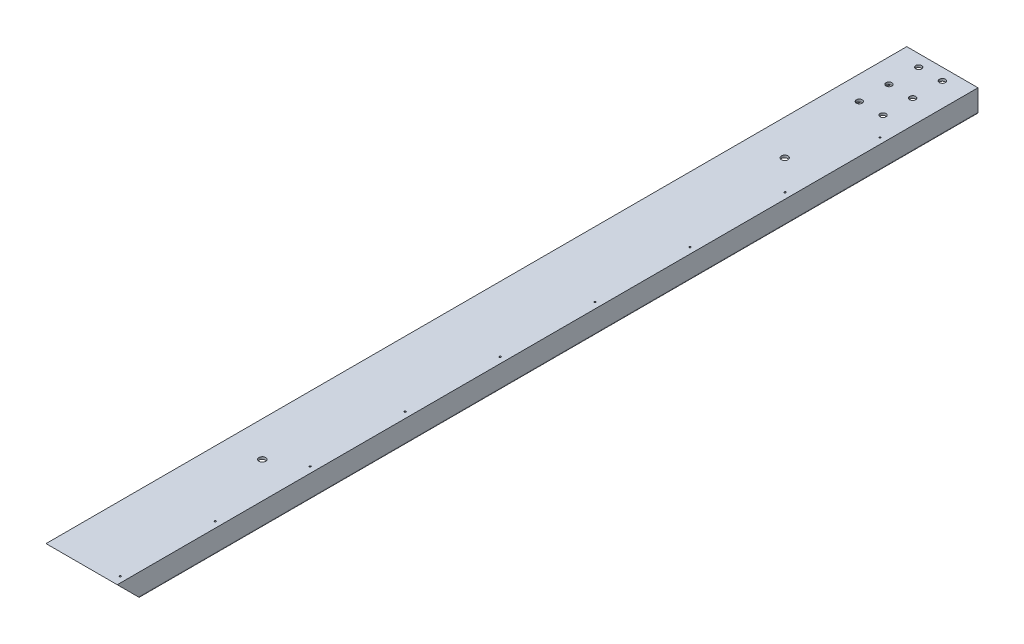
ISO-10303-21;
HEADER;
FILE_DESCRIPTION(('STEP AP214'),'2;1');
FILE_NAME('part.step','',(''),(''),'','','');
FILE_SCHEMA(('AUTOMOTIVE_DESIGN { 1 0 10303 214 1 1 1 1 }'));
ENDSEC;
DATA;
#1=APPLICATION_CONTEXT('core data for automotive mechanical design processes');
#2=APPLICATION_PROTOCOL_DEFINITION('international standard','automotive_design',2000,#1);
#3=PRODUCT_CONTEXT('',#1,'mechanical');
#4=PRODUCT('Part','Part','',(#3));
#5=PRODUCT_RELATED_PRODUCT_CATEGORY('part','',(#4));
#6=PRODUCT_DEFINITION_FORMATION('','',#4);
#7=PRODUCT_DEFINITION_CONTEXT('part definition',#1,'design');
#8=PRODUCT_DEFINITION('design','',#6,#7);
#9=PRODUCT_DEFINITION_SHAPE('','',#8);
#10=(LENGTH_UNIT() NAMED_UNIT(*) SI_UNIT(.MILLI.,.METRE.));
#11=(NAMED_UNIT(*) PLANE_ANGLE_UNIT() SI_UNIT($,.RADIAN.));
#12=(NAMED_UNIT(*) SI_UNIT($,.STERADIAN.) SOLID_ANGLE_UNIT());
#13=UNCERTAINTY_MEASURE_WITH_UNIT(LENGTH_MEASURE(1.E-05),#10,'distance_accuracy_value','');
#14=(GEOMETRIC_REPRESENTATION_CONTEXT(3) GLOBAL_UNCERTAINTY_ASSIGNED_CONTEXT((#13)) GLOBAL_UNIT_ASSIGNED_CONTEXT((#10,
#11,#12)) REPRESENTATION_CONTEXT('',''));
#15=CARTESIAN_POINT('',(0.,0.,0.));
#16=DIRECTION('',(0.,0.,1.));
#17=DIRECTION('',(1.,0.,0.));
#18=AXIS2_PLACEMENT_3D('',#15,#16,#17);
#19=CARTESIAN_POINT('',(-71.8439000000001,-1.01600000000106,-755.65));
#20=DIRECTION('',(-1.,0.,0.));
#21=DIRECTION('',(0.,0.,1.));
#22=AXIS2_PLACEMENT_3D('',#19,#20,#21);
#23=CYLINDRICAL_SURFACE('',#22,6.35);
#24=CARTESIAN_POINT('',(-66.3854400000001,-1.01600000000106,-755.65));
#25=DIRECTION('',(0.987440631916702,-0.157990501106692,0.));
#26=DIRECTION('',(-0.157990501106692,-0.987440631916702,0.));
#27=AXIS2_PLACEMENT_3D('',#24,#25,#26);
#28=ELLIPSE('',#27,6.43076636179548,6.35);
#29=CARTESIAN_POINT('',(-65.36944,5.33399999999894,-755.65));
#30=VERTEX_POINT('',#29);
#31=CARTESIAN_POINT('',(-67.4014400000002,-7.36600000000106,-755.65));
#32=VERTEX_POINT('',#31);
#33=EDGE_CURVE('E1005',#30,#32,#28,.F.);
#34=ORIENTED_EDGE('',*,*,#33,.F.);
#35=DIRECTION('',(-1.,0.,0.));
#36=VECTOR('',#35,1.);
#37=CARTESIAN_POINT('',(-71.8439000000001,5.33399999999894,-755.65));
#38=LINE('',#37,#36);
#39=CARTESIAN_POINT('',(-76.2,5.33399999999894,-755.65));
#40=VERTEX_POINT('',#39);
#41=EDGE_CURVE('E571',#30,#40,#38,.T.);
#42=ORIENTED_EDGE('',*,*,#41,.T.);
#43=CARTESIAN_POINT('',(-76.2,-1.01600000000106,-755.65));
#44=DIRECTION('',(-1.,0.,0.));
#45=DIRECTION('',(0.,0.,1.));
#46=AXIS2_PLACEMENT_3D('',#43,#44,#45);
#47=CIRCLE('',#46,6.35);
#48=CARTESIAN_POINT('',(-76.2,-7.36600000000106,-755.65));
#49=VERTEX_POINT('',#48);
#50=EDGE_CURVE('E760',#49,#40,#47,.F.);
#51=ORIENTED_EDGE('',*,*,#50,.F.);
#52=DIRECTION('',(-1.,0.,0.));
#53=VECTOR('',#52,1.);
#54=CARTESIAN_POINT('',(-71.8439000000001,-7.36600000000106,-755.65));
#55=LINE('',#54,#53);
#56=EDGE_CURVE('E569',#49,#32,#55,.F.);
#57=ORIENTED_EDGE('',*,*,#56,.T.);
#58=EDGE_LOOP('',(#34,#42,#51,#57));
#59=FACE_BOUND('',#58,.T.);
#60=ADVANCED_FACE('F16',(#59),#23,.F.);
#61=CARTESIAN_POINT('',(-71.8439000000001,-1.01600000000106,-755.65));
#62=DIRECTION('',(-1.,0.,0.));
#63=DIRECTION('',(0.,0.,1.));
#64=AXIS2_PLACEMENT_3D('',#61,#62,#63);
#65=CYLINDRICAL_SURFACE('',#64,6.35);
#66=CARTESIAN_POINT('',(-76.2,-1.01600000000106,-755.65));
#67=DIRECTION('',(-1.,0.,0.));
#68=DIRECTION('',(0.,0.,1.));
#69=AXIS2_PLACEMENT_3D('',#66,#67,#68);
#70=CIRCLE('',#69,6.35);
#71=EDGE_CURVE('E757',#40,#49,#70,.F.);
#72=ORIENTED_EDGE('',*,*,#71,.F.);
#73=ORIENTED_EDGE('',*,*,#41,.F.);
#74=CARTESIAN_POINT('',(-66.3854400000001,-1.01600000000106,-755.65));
#75=DIRECTION('',(0.987440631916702,-0.157990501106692,0.));
#76=DIRECTION('',(-0.157990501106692,-0.987440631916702,0.));
#77=AXIS2_PLACEMENT_3D('',#74,#75,#76);
#78=ELLIPSE('',#77,6.43076636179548,6.35);
#79=EDGE_CURVE('E1002',#32,#30,#78,.F.);
#80=ORIENTED_EDGE('',*,*,#79,.F.);
#81=ORIENTED_EDGE('',*,*,#56,.F.);
#82=EDGE_LOOP('',(#72,#73,#80,#81));
#83=FACE_BOUND('',#82,.T.);
#84=ADVANCED_FACE('F1037',(#83),#65,.F.);
#85=CARTESIAN_POINT('',(-63.1825000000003,-1.0160000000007,565.15));
#86=DIRECTION('',(-1.,0.,0.));
#87=DIRECTION('',(0.,-1.,0.));
#88=AXIS2_PLACEMENT_3D('',#85,#86,#87);
#89=CYLINDRICAL_SURFACE('',#88,6.35);
#90=CARTESIAN_POINT('',(-66.38544,-1.0160000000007,565.15));
#91=DIRECTION('',(0.987440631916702,-0.157990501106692,0.));
#92=DIRECTION('',(-0.157990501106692,-0.987440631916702,0.));
#93=AXIS2_PLACEMENT_3D('',#90,#91,#92);
#94=ELLIPSE('',#93,6.43076636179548,6.35);
#95=CARTESIAN_POINT('',(-65.3694399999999,5.3339999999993,565.15));
#96=VERTEX_POINT('',#95);
#97=CARTESIAN_POINT('',(-67.4014400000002,-7.3660000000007,565.15));
#98=VERTEX_POINT('',#97);
#99=EDGE_CURVE('E19',#96,#98,#94,.F.);
#100=ORIENTED_EDGE('',*,*,#99,.F.);
#101=DIRECTION('',(-1.,0.,0.));
#102=VECTOR('',#101,1.);
#103=CARTESIAN_POINT('',(-63.1825000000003,5.3339999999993,565.15));
#104=LINE('',#103,#102);
#105=CARTESIAN_POINT('',(-76.2,5.3339999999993,565.15));
#106=VERTEX_POINT('',#105);
#107=EDGE_CURVE('E478',#96,#106,#104,.T.);
#108=ORIENTED_EDGE('',*,*,#107,.T.);
#109=CARTESIAN_POINT('',(-76.2,-1.0160000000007,565.15));
#110=DIRECTION('',(-1.,0.,0.));
#111=DIRECTION('',(0.,-1.,0.));
#112=AXIS2_PLACEMENT_3D('',#109,#110,#111);
#113=CIRCLE('',#112,6.35);
#114=CARTESIAN_POINT('',(-76.2,-7.3660000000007,565.15));
#115=VERTEX_POINT('',#114);
#116=EDGE_CURVE('E472',#115,#106,#113,.F.);
#117=ORIENTED_EDGE('',*,*,#116,.F.);
#118=DIRECTION('',(-1.,0.,0.));
#119=VECTOR('',#118,1.);
#120=CARTESIAN_POINT('',(-63.1825000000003,-7.3660000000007,565.15));
#121=LINE('',#120,#119);
#122=EDGE_CURVE('E468',#115,#98,#121,.F.);
#123=ORIENTED_EDGE('',*,*,#122,.T.);
#124=EDGE_LOOP('',(#100,#108,#117,#123));
#125=FACE_BOUND('',#124,.T.);
#126=ADVANCED_FACE('F470',(#125),#89,.F.);
#127=CARTESIAN_POINT('',(-63.1825000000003,-1.0160000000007,565.15));
#128=DIRECTION('',(-1.,0.,0.));
#129=DIRECTION('',(0.,-1.,0.));
#130=AXIS2_PLACEMENT_3D('',#127,#128,#129);
#131=CYLINDRICAL_SURFACE('',#130,6.35);
#132=CARTESIAN_POINT('',(-76.2,-1.0160000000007,565.15));
#133=DIRECTION('',(-1.,0.,0.));
#134=DIRECTION('',(0.,-1.,0.));
#135=AXIS2_PLACEMENT_3D('',#132,#133,#134);
#136=CIRCLE('',#135,6.35);
#137=EDGE_CURVE('E752',#106,#115,#136,.F.);
#138=ORIENTED_EDGE('',*,*,#137,.F.);
#139=ORIENTED_EDGE('',*,*,#107,.F.);
#140=CARTESIAN_POINT('',(-66.38544,-1.0160000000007,565.15));
#141=DIRECTION('',(0.987440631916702,-0.157990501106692,0.));
#142=DIRECTION('',(-0.157990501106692,-0.987440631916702,0.));
#143=AXIS2_PLACEMENT_3D('',#140,#141,#142);
#144=ELLIPSE('',#143,6.43076636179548,6.35);
#145=EDGE_CURVE('E481',#98,#96,#144,.F.);
#146=ORIENTED_EDGE('',*,*,#145,.F.);
#147=ORIENTED_EDGE('',*,*,#122,.F.);
#148=EDGE_LOOP('',(#138,#139,#146,#147));
#149=FACE_BOUND('',#148,.T.);
#150=ADVANCED_FACE('F482',(#149),#131,.F.);
#151=CARTESIAN_POINT('',(-63.1825000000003,-1.0160000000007,615.95));
#152=DIRECTION('',(-1.,0.,0.));
#153=DIRECTION('',(0.,-1.,0.));
#154=AXIS2_PLACEMENT_3D('',#151,#152,#153);
#155=CYLINDRICAL_SURFACE('',#154,6.35);
#156=CARTESIAN_POINT('',(-66.38544,-1.0160000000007,615.95));
#157=DIRECTION('',(0.987440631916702,-0.157990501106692,0.));
#158=DIRECTION('',(-0.157990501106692,-0.987440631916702,0.));
#159=AXIS2_PLACEMENT_3D('',#156,#157,#158);
#160=ELLIPSE('',#159,6.43076636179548,6.35);
#161=CARTESIAN_POINT('',(-65.3694399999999,5.3339999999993,615.95));
#162=VERTEX_POINT('',#161);
#163=CARTESIAN_POINT('',(-67.4014400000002,-7.3660000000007,615.95));
#164=VERTEX_POINT('',#163);
#165=EDGE_CURVE('E485',#162,#164,#160,.F.);
#166=ORIENTED_EDGE('',*,*,#165,.F.);
#167=DIRECTION('',(-1.,0.,0.));
#168=VECTOR('',#167,1.);
#169=CARTESIAN_POINT('',(-63.1825000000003,5.3339999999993,615.95));
#170=LINE('',#169,#168);
#171=CARTESIAN_POINT('',(-76.2,5.3339999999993,615.95));
#172=VERTEX_POINT('',#171);
#173=EDGE_CURVE('E477',#162,#172,#170,.T.);
#174=ORIENTED_EDGE('',*,*,#173,.T.);
#175=CARTESIAN_POINT('',(-76.2,-1.0160000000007,615.95));
#176=DIRECTION('',(-1.,0.,0.));
#177=DIRECTION('',(0.,-1.,0.));
#178=AXIS2_PLACEMENT_3D('',#175,#176,#177);
#179=CIRCLE('',#178,6.35);
#180=CARTESIAN_POINT('',(-76.2,-7.3660000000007,615.95));
#181=VERTEX_POINT('',#180);
#182=EDGE_CURVE('E748',#181,#172,#179,.F.);
#183=ORIENTED_EDGE('',*,*,#182,.F.);
#184=DIRECTION('',(-1.,0.,0.));
#185=VECTOR('',#184,1.);
#186=CARTESIAN_POINT('',(-63.1825000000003,-7.3660000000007,615.95));
#187=LINE('',#186,#185);
#188=EDGE_CURVE('E563',#181,#164,#187,.F.);
#189=ORIENTED_EDGE('',*,*,#188,.T.);
#190=EDGE_LOOP('',(#166,#174,#183,#189));
#191=FACE_BOUND('',#190,.T.);
#192=ADVANCED_FACE('F1018',(#191),#155,.F.);
#193=CARTESIAN_POINT('',(-63.1825000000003,-1.0160000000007,615.95));
#194=DIRECTION('',(-1.,0.,0.));
#195=DIRECTION('',(0.,-1.,0.));
#196=AXIS2_PLACEMENT_3D('',#193,#194,#195);
#197=CYLINDRICAL_SURFACE('',#196,6.35);
#198=CARTESIAN_POINT('',(-76.2,-1.0160000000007,615.95));
#199=DIRECTION('',(-1.,0.,0.));
#200=DIRECTION('',(0.,-1.,0.));
#201=AXIS2_PLACEMENT_3D('',#198,#199,#200);
#202=CIRCLE('',#201,6.35);
#203=EDGE_CURVE('E744',#172,#181,#202,.F.);
#204=ORIENTED_EDGE('',*,*,#203,.F.);
#205=ORIENTED_EDGE('',*,*,#173,.F.);
#206=CARTESIAN_POINT('',(-66.38544,-1.0160000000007,615.95));
#207=DIRECTION('',(0.987440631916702,-0.157990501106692,0.));
#208=DIRECTION('',(-0.157990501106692,-0.987440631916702,0.));
#209=AXIS2_PLACEMENT_3D('',#206,#207,#208);
#210=ELLIPSE('',#209,6.43076636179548,6.35);
#211=EDGE_CURVE('E1008',#164,#162,#210,.F.);
#212=ORIENTED_EDGE('',*,*,#211,.F.);
#213=ORIENTED_EDGE('',*,*,#188,.F.);
#214=EDGE_LOOP('',(#204,#205,#212,#213));
#215=FACE_BOUND('',#214,.T.);
#216=ADVANCED_FACE('F1022',(#215),#197,.F.);
#217=CARTESIAN_POINT('',(-71.8439000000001,-1.01600000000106,-374.65));
#218=DIRECTION('',(-1.,0.,0.));
#219=DIRECTION('',(0.,0.,1.));
#220=AXIS2_PLACEMENT_3D('',#217,#218,#219);
#221=CYLINDRICAL_SURFACE('',#220,6.35);
#222=CARTESIAN_POINT('',(-66.3854400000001,-1.01600000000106,-374.65));
#223=DIRECTION('',(0.987440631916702,-0.157990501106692,0.));
#224=DIRECTION('',(-0.157990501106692,-0.987440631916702,0.));
#225=AXIS2_PLACEMENT_3D('',#222,#223,#224);
#226=ELLIPSE('',#225,6.43076636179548,6.35);
#227=CARTESIAN_POINT('',(-65.36944,5.33399999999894,-374.65));
#228=VERTEX_POINT('',#227);
#229=CARTESIAN_POINT('',(-67.4014400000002,-7.36600000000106,-374.65));
#230=VERTEX_POINT('',#229);
#231=EDGE_CURVE('E993',#228,#230,#226,.F.);
#232=ORIENTED_EDGE('',*,*,#231,.F.);
#233=DIRECTION('',(-1.,0.,0.));
#234=VECTOR('',#233,1.);
#235=CARTESIAN_POINT('',(-71.8439000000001,5.33399999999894,-374.65));
#236=LINE('',#235,#234);
#237=CARTESIAN_POINT('',(-76.2,5.33399999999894,-374.65));
#238=VERTEX_POINT('',#237);
#239=EDGE_CURVE('E561',#228,#238,#236,.T.);
#240=ORIENTED_EDGE('',*,*,#239,.T.);
#241=CARTESIAN_POINT('',(-76.2,-1.01600000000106,-374.65));
#242=DIRECTION('',(-1.,0.,0.));
#243=DIRECTION('',(0.,0.,1.));
#244=AXIS2_PLACEMENT_3D('',#241,#242,#243);
#245=CIRCLE('',#244,6.35);
#246=CARTESIAN_POINT('',(-76.2,-7.36600000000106,-374.65));
#247=VERTEX_POINT('',#246);
#248=EDGE_CURVE('E741',#247,#238,#245,.F.);
#249=ORIENTED_EDGE('',*,*,#248,.F.);
#250=DIRECTION('',(-1.,0.,0.));
#251=VECTOR('',#250,1.);
#252=CARTESIAN_POINT('',(-71.8439000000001,-7.36600000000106,-374.65));
#253=LINE('',#252,#251);
#254=EDGE_CURVE('E559',#247,#230,#253,.F.);
#255=ORIENTED_EDGE('',*,*,#254,.T.);
#256=EDGE_LOOP('',(#232,#240,#249,#255));
#257=FACE_BOUND('',#256,.T.);
#258=ADVANCED_FACE('F1507',(#257),#221,.F.);
#259=CARTESIAN_POINT('',(-71.8439000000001,-1.01600000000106,-374.65));
#260=DIRECTION('',(-1.,0.,0.));
#261=DIRECTION('',(0.,0.,1.));
#262=AXIS2_PLACEMENT_3D('',#259,#260,#261);
#263=CYLINDRICAL_SURFACE('',#262,6.35);
#264=CARTESIAN_POINT('',(-76.2,-1.01600000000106,-374.65));
#265=DIRECTION('',(-1.,0.,0.));
#266=DIRECTION('',(0.,0.,1.));
#267=AXIS2_PLACEMENT_3D('',#264,#265,#266);
#268=CIRCLE('',#267,6.35);
#269=EDGE_CURVE('E738',#238,#247,#268,.F.);
#270=ORIENTED_EDGE('',*,*,#269,.F.);
#271=ORIENTED_EDGE('',*,*,#239,.F.);
#272=CARTESIAN_POINT('',(-66.3854400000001,-1.01600000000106,-374.65));
#273=DIRECTION('',(0.987440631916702,-0.157990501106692,0.));
#274=DIRECTION('',(-0.157990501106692,-0.987440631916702,0.));
#275=AXIS2_PLACEMENT_3D('',#272,#273,#274);
#276=ELLIPSE('',#275,6.43076636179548,6.35);
#277=EDGE_CURVE('E990',#230,#228,#276,.F.);
#278=ORIENTED_EDGE('',*,*,#277,.F.);
#279=ORIENTED_EDGE('',*,*,#254,.F.);
#280=EDGE_LOOP('',(#270,#271,#278,#279));
#281=FACE_BOUND('',#280,.T.);
#282=ADVANCED_FACE('F1503',(#281),#263,.F.);
#283=CARTESIAN_POINT('',(-71.8439000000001,-1.01600000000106,-501.65));
#284=DIRECTION('',(-1.,0.,0.));
#285=DIRECTION('',(0.,0.,1.));
#286=AXIS2_PLACEMENT_3D('',#283,#284,#285);
#287=CYLINDRICAL_SURFACE('',#286,6.35);
#288=CARTESIAN_POINT('',(-66.3854400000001,-1.01600000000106,-501.65));
#289=DIRECTION('',(0.987440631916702,-0.157990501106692,0.));
#290=DIRECTION('',(-0.157990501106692,-0.987440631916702,0.));
#291=AXIS2_PLACEMENT_3D('',#288,#289,#290);
#292=ELLIPSE('',#291,6.43076636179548,6.35);
#293=CARTESIAN_POINT('',(-65.36944,5.33399999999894,-501.65));
#294=VERTEX_POINT('',#293);
#295=CARTESIAN_POINT('',(-67.4014400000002,-7.36600000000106,-501.65));
#296=VERTEX_POINT('',#295);
#297=EDGE_CURVE('E987',#294,#296,#292,.F.);
#298=ORIENTED_EDGE('',*,*,#297,.F.);
#299=DIRECTION('',(-1.,0.,0.));
#300=VECTOR('',#299,1.);
#301=CARTESIAN_POINT('',(-71.8439000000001,5.33399999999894,-501.65));
#302=LINE('',#301,#300);
#303=CARTESIAN_POINT('',(-76.2,5.33399999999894,-501.65));
#304=VERTEX_POINT('',#303);
#305=EDGE_CURVE('E557',#294,#304,#302,.T.);
#306=ORIENTED_EDGE('',*,*,#305,.T.);
#307=CARTESIAN_POINT('',(-76.2,-1.01600000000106,-501.65));
#308=DIRECTION('',(-1.,0.,0.));
#309=DIRECTION('',(0.,0.,1.));
#310=AXIS2_PLACEMENT_3D('',#307,#308,#309);
#311=CIRCLE('',#310,6.35);
#312=CARTESIAN_POINT('',(-76.2,-7.36600000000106,-501.65));
#313=VERTEX_POINT('',#312);
#314=EDGE_CURVE('E735',#313,#304,#311,.F.);
#315=ORIENTED_EDGE('',*,*,#314,.F.);
#316=DIRECTION('',(-1.,0.,0.));
#317=VECTOR('',#316,1.);
#318=CARTESIAN_POINT('',(-71.8439000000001,-7.36600000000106,-501.65));
#319=LINE('',#318,#317);
#320=EDGE_CURVE('E555',#313,#296,#319,.F.);
#321=ORIENTED_EDGE('',*,*,#320,.T.);
#322=EDGE_LOOP('',(#298,#306,#315,#321));
#323=FACE_BOUND('',#322,.T.);
#324=ADVANCED_FACE('F1499',(#323),#287,.F.);
#325=CARTESIAN_POINT('',(-71.8439000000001,-1.01600000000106,-501.65));
#326=DIRECTION('',(-1.,0.,0.));
#327=DIRECTION('',(0.,0.,1.));
#328=AXIS2_PLACEMENT_3D('',#325,#326,#327);
#329=CYLINDRICAL_SURFACE('',#328,6.35);
#330=CARTESIAN_POINT('',(-76.2,-1.01600000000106,-501.65));
#331=DIRECTION('',(-1.,0.,0.));
#332=DIRECTION('',(0.,0.,1.));
#333=AXIS2_PLACEMENT_3D('',#330,#331,#332);
#334=CIRCLE('',#333,6.35);
#335=EDGE_CURVE('E732',#304,#313,#334,.F.);
#336=ORIENTED_EDGE('',*,*,#335,.F.);
#337=ORIENTED_EDGE('',*,*,#305,.F.);
#338=CARTESIAN_POINT('',(-66.3854400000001,-1.01600000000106,-501.65));
#339=DIRECTION('',(0.987440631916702,-0.157990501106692,0.));
#340=DIRECTION('',(-0.157990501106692,-0.987440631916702,0.));
#341=AXIS2_PLACEMENT_3D('',#338,#339,#340);
#342=ELLIPSE('',#341,6.43076636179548,6.35);
#343=EDGE_CURVE('E984',#296,#294,#342,.F.);
#344=ORIENTED_EDGE('',*,*,#343,.F.);
#345=ORIENTED_EDGE('',*,*,#320,.F.);
#346=EDGE_LOOP('',(#336,#337,#344,#345));
#347=FACE_BOUND('',#346,.T.);
#348=ADVANCED_FACE('F1495',(#347),#329,.F.);
#349=CARTESIAN_POINT('',(-71.8439000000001,-1.01600000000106,-628.65));
#350=DIRECTION('',(-1.,0.,0.));
#351=DIRECTION('',(0.,0.,1.));
#352=AXIS2_PLACEMENT_3D('',#349,#350,#351);
#353=CYLINDRICAL_SURFACE('',#352,6.35);
#354=CARTESIAN_POINT('',(-66.3854400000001,-1.01600000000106,-628.65));
#355=DIRECTION('',(0.987440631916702,-0.157990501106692,0.));
#356=DIRECTION('',(-0.157990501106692,-0.987440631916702,0.));
#357=AXIS2_PLACEMENT_3D('',#354,#355,#356);
#358=ELLIPSE('',#357,6.43076636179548,6.35);
#359=CARTESIAN_POINT('',(-65.36944,5.33399999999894,-628.65));
#360=VERTEX_POINT('',#359);
#361=CARTESIAN_POINT('',(-67.4014400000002,-7.36600000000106,-628.65));
#362=VERTEX_POINT('',#361);
#363=EDGE_CURVE('E999',#360,#362,#358,.F.);
#364=ORIENTED_EDGE('',*,*,#363,.F.);
#365=DIRECTION('',(-1.,0.,0.));
#366=VECTOR('',#365,1.);
#367=CARTESIAN_POINT('',(-71.8439000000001,5.33399999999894,-628.65));
#368=LINE('',#367,#366);
#369=CARTESIAN_POINT('',(-76.2,5.33399999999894,-628.65));
#370=VERTEX_POINT('',#369);
#371=EDGE_CURVE('E553',#360,#370,#368,.T.);
#372=ORIENTED_EDGE('',*,*,#371,.T.);
#373=CARTESIAN_POINT('',(-76.2,-1.01600000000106,-628.65));
#374=DIRECTION('',(-1.,0.,0.));
#375=DIRECTION('',(0.,0.,1.));
#376=AXIS2_PLACEMENT_3D('',#373,#374,#375);
#377=CIRCLE('',#376,6.35);
#378=CARTESIAN_POINT('',(-76.2,-7.36600000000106,-628.65));
#379=VERTEX_POINT('',#378);
#380=EDGE_CURVE('E729',#379,#370,#377,.F.);
#381=ORIENTED_EDGE('',*,*,#380,.F.);
#382=DIRECTION('',(-1.,0.,0.));
#383=VECTOR('',#382,1.);
#384=CARTESIAN_POINT('',(-71.8439000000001,-7.36600000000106,-628.65));
#385=LINE('',#384,#383);
#386=EDGE_CURVE('E517',#379,#362,#385,.F.);
#387=ORIENTED_EDGE('',*,*,#386,.T.);
#388=EDGE_LOOP('',(#364,#372,#381,#387));
#389=FACE_BOUND('',#388,.T.);
#390=ADVANCED_FACE('F1489',(#389),#353,.F.);
#391=CARTESIAN_POINT('',(-71.8439000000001,-1.01600000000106,-628.65));
#392=DIRECTION('',(-1.,0.,0.));
#393=DIRECTION('',(0.,0.,1.));
#394=AXIS2_PLACEMENT_3D('',#391,#392,#393);
#395=CYLINDRICAL_SURFACE('',#394,6.35);
#396=CARTESIAN_POINT('',(-76.2,-1.01600000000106,-628.65));
#397=DIRECTION('',(-1.,0.,0.));
#398=DIRECTION('',(0.,0.,1.));
#399=AXIS2_PLACEMENT_3D('',#396,#397,#398);
#400=CIRCLE('',#399,6.35);
#401=EDGE_CURVE('E545',#370,#379,#400,.F.);
#402=ORIENTED_EDGE('',*,*,#401,.F.);
#403=ORIENTED_EDGE('',*,*,#371,.F.);
#404=CARTESIAN_POINT('',(-66.3854400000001,-1.01600000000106,-628.65));
#405=DIRECTION('',(0.987440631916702,-0.157990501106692,0.));
#406=DIRECTION('',(-0.157990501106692,-0.987440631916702,0.));
#407=AXIS2_PLACEMENT_3D('',#404,#405,#406);
#408=ELLIPSE('',#407,6.43076636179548,6.35);
#409=EDGE_CURVE('E996',#362,#360,#408,.F.);
#410=ORIENTED_EDGE('',*,*,#409,.F.);
#411=ORIENTED_EDGE('',*,*,#386,.F.);
#412=EDGE_LOOP('',(#402,#403,#410,#411));
#413=FACE_BOUND('',#412,.T.);
#414=ADVANCED_FACE('F1484',(#413),#395,.F.);
#415=CARTESIAN_POINT('',(72.8979999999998,-21.0820000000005,-350.785362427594));
#416=DIRECTION('',(0.,0.,-1.));
#417=DIRECTION('',(-1.,0.,0.));
#418=AXIS2_PLACEMENT_3D('',#415,#416,#417);
#419=CYLINDRICAL_SURFACE('',#418,3.3019999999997);
#420=DIRECTION('',(0.,0.,1.));
#421=VECTOR('',#420,1.);
#422=CARTESIAN_POINT('',(69.5960000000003,-21.0819999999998,-350.785362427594));
#423=LINE('',#422,#421);
#424=CARTESIAN_POINT('',(69.5960000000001,-21.0819999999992,-920.75));
#425=VERTEX_POINT('',#424);
#426=CARTESIAN_POINT('',(69.5960000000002,-21.081999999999,875.284000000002));
#427=VERTEX_POINT('',#426);
#428=EDGE_CURVE('E512',#425,#427,#423,.T.);
#429=ORIENTED_EDGE('',*,*,#428,.F.);
#430=CARTESIAN_POINT('',(72.8979999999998,-21.0820000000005,-920.75));
#431=DIRECTION('',(0.,0.,-1.));
#432=DIRECTION('',(-1.,0.,0.));
#433=AXIS2_PLACEMENT_3D('',#430,#431,#432);
#434=CIRCLE('',#433,3.3019999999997);
#435=CARTESIAN_POINT('',(76.1999999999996,-21.0820000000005,-920.75));
#436=VERTEX_POINT('',#435);
#437=EDGE_CURVE('E764',#425,#436,#434,.F.);
#438=ORIENTED_EDGE('',*,*,#437,.T.);
#439=DIRECTION('',(0.,0.,1.));
#440=VECTOR('',#439,1.);
#441=CARTESIAN_POINT('',(76.1999999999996,-21.0820000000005,-350.785362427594));
#442=LINE('',#441,#440);
#443=CARTESIAN_POINT('',(76.1999999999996,-21.0820000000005,875.284000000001));
#444=VERTEX_POINT('',#443);
#445=EDGE_CURVE('E518',#444,#436,#442,.F.);
#446=ORIENTED_EDGE('',*,*,#445,.F.);
#447=CARTESIAN_POINT('',(72.8979999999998,-21.0820000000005,875.284000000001));
#448=DIRECTION('',(0.,0.707106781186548,-0.707106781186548));
#449=DIRECTION('',(0.,-0.707106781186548,-0.707106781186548));
#450=AXIS2_PLACEMENT_3D('',#447,#448,#449);
#451=ELLIPSE('',#450,4.66973318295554,3.3019999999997);
#452=EDGE_CURVE('E724',#444,#427,#451,.T.);
#453=ORIENTED_EDGE('',*,*,#452,.T.);
#454=EDGE_LOOP('',(#429,#438,#446,#453));
#455=FACE_BOUND('',#454,.T.);
#456=ADVANCED_FACE('F1482',(#455),#419,.T.);
#457=CARTESIAN_POINT('',(63.9897216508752,13.9572396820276,-350.785362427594));
#458=DIRECTION('',(-0.987440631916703,-0.157990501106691,0.));
#459=DIRECTION('',(0.157990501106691,-0.987440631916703,0.));
#460=AXIS2_PLACEMENT_3D('',#457,#458,#459);
#461=PLANE('',#460);
#462=DIRECTION('',(0.,0.,-1.));
#463=VECTOR('',#462,1.);
#464=CARTESIAN_POINT('',(63.9897216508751,13.9572396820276,-350.785362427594));
#465=LINE('',#464,#463);
#466=CARTESIAN_POINT('',(63.9897216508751,13.9572396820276,-112.59077306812));
#467=VERTEX_POINT('',#466);
#468=CARTESIAN_POINT('',(63.9897216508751,13.9572396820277,87.1907730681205));
#469=VERTEX_POINT('',#468);
#470=EDGE_CURVE('E516',#467,#469,#465,.F.);
#471=ORIENTED_EDGE('',*,*,#470,.F.);
#472=CARTESIAN_POINT('',(63.5,17.0179999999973,-114.3));
#473=DIRECTION('',(-0.987440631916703,-0.157990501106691,0.));
#474=DIRECTION('',(0.157990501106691,-0.987440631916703,0.));
#475=AXIS2_PLACEMENT_3D('',#472,#473,#474);
#476=ELLIPSE('',#475,11.2538411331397,1.77799999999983);
#477=CARTESIAN_POINT('',(65.2779999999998,5.90549999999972,-114.3));
#478=VERTEX_POINT('',#477);
#479=EDGE_CURVE('E968',#467,#478,#476,.F.);
#480=ORIENTED_EDGE('',*,*,#479,.T.);
#481=CARTESIAN_POINT('',(63.5,17.0179999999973,-114.3));
#482=DIRECTION('',(-0.987440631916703,-0.157990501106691,0.));
#483=DIRECTION('',(0.157990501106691,-0.987440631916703,0.));
#484=AXIS2_PLACEMENT_3D('',#481,#482,#483);
#485=ELLIPSE('',#484,11.2538411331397,1.77799999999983);
#486=CARTESIAN_POINT('',(63.9897216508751,13.9572396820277,-116.009226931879));
#487=VERTEX_POINT('',#486);
#488=EDGE_CURVE('E1432',#478,#487,#485,.F.);
#489=ORIENTED_EDGE('',*,*,#488,.T.);
#490=DIRECTION('',(0.,0.,-1.));
#491=VECTOR('',#490,1.);
#492=CARTESIAN_POINT('',(63.9897216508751,13.9572396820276,-350.785362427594));
#493=LINE('',#492,#491);
#494=CARTESIAN_POINT('',(63.9897216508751,13.9572396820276,-315.79077306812));
#495=VERTEX_POINT('',#494);
#496=EDGE_CURVE('E501',#495,#487,#493,.F.);
#497=ORIENTED_EDGE('',*,*,#496,.F.);
#498=CARTESIAN_POINT('',(63.5,17.0179999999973,-317.5));
#499=DIRECTION('',(-0.987440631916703,-0.157990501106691,0.));
#500=DIRECTION('',(0.157990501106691,-0.987440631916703,0.));
#501=AXIS2_PLACEMENT_3D('',#498,#499,#500);
#502=ELLIPSE('',#501,11.2538411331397,1.77799999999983);
#503=CARTESIAN_POINT('',(65.2779999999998,5.90549999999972,-317.5));
#504=VERTEX_POINT('',#503);
#505=EDGE_CURVE('E940',#495,#504,#502,.F.);
#506=ORIENTED_EDGE('',*,*,#505,.T.);
#507=CARTESIAN_POINT('',(63.5,17.0179999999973,-317.5));
#508=DIRECTION('',(-0.987440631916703,-0.157990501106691,0.));
#509=DIRECTION('',(0.157990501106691,-0.987440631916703,0.));
#510=AXIS2_PLACEMENT_3D('',#507,#508,#509);
#511=ELLIPSE('',#510,11.2538411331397,1.77799999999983);
#512=CARTESIAN_POINT('',(63.9897216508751,13.9572396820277,-319.209226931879));
#513=VERTEX_POINT('',#512);
#514=EDGE_CURVE('E1443',#504,#513,#511,.F.);
#515=ORIENTED_EDGE('',*,*,#514,.T.);
#516=DIRECTION('',(0.,0.,-1.));
#517=VECTOR('',#516,1.);
#518=CARTESIAN_POINT('',(63.9897216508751,13.9572396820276,-350.785362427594));
#519=LINE('',#518,#517);
#520=CARTESIAN_POINT('',(63.9897216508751,13.9572396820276,-518.99077306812));
#521=VERTEX_POINT('',#520);
#522=EDGE_CURVE('E581',#521,#513,#519,.F.);
#523=ORIENTED_EDGE('',*,*,#522,.F.);
#524=CARTESIAN_POINT('',(63.5,17.0179999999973,-520.7));
#525=DIRECTION('',(-0.987440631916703,-0.157990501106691,0.));
#526=DIRECTION('',(0.157990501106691,-0.987440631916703,0.));
#527=AXIS2_PLACEMENT_3D('',#524,#525,#526);
#528=ELLIPSE('',#527,11.2538411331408,1.778);
#529=CARTESIAN_POINT('',(65.278,5.90549999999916,-520.7));
#530=VERTEX_POINT('',#529);
#531=EDGE_CURVE('E1452',#521,#530,#528,.F.);
#532=ORIENTED_EDGE('',*,*,#531,.T.);
#533=CARTESIAN_POINT('',(63.5,17.0179999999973,-520.7));
#534=DIRECTION('',(-0.987440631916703,-0.157990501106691,0.));
#535=DIRECTION('',(0.157990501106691,-0.987440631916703,0.));
#536=AXIS2_PLACEMENT_3D('',#533,#534,#535);
#537=ELLIPSE('',#536,11.2538411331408,1.778);
#538=CARTESIAN_POINT('',(63.9897216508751,13.9572396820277,-522.40922693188));
#539=VERTEX_POINT('',#538);
#540=EDGE_CURVE('E1455',#530,#539,#537,.F.);
#541=ORIENTED_EDGE('',*,*,#540,.T.);
#542=DIRECTION('',(0.,0.,-1.));
#543=VECTOR('',#542,1.);
#544=CARTESIAN_POINT('',(63.9897216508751,13.9572396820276,-350.785362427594));
#545=LINE('',#544,#543);
#546=CARTESIAN_POINT('',(63.9897216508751,13.9572396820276,-722.19077306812));
#547=VERTEX_POINT('',#546);
#548=EDGE_CURVE('E575',#547,#539,#545,.F.);
#549=ORIENTED_EDGE('',*,*,#548,.F.);
#550=CARTESIAN_POINT('',(63.5,17.0179999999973,-723.9));
#551=DIRECTION('',(-0.987440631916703,-0.157990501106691,0.));
#552=DIRECTION('',(-0.157990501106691,0.987440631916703,0.));
#553=AXIS2_PLACEMENT_3D('',#550,#551,#552);
#554=ELLIPSE('',#553,11.2538411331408,1.778);
#555=CARTESIAN_POINT('',(65.278,5.90549999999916,-723.9));
#556=VERTEX_POINT('',#555);
#557=EDGE_CURVE('E1462',#547,#556,#554,.F.);
#558=ORIENTED_EDGE('',*,*,#557,.T.);
#559=CARTESIAN_POINT('',(63.5,17.0179999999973,-723.9));
#560=DIRECTION('',(-0.987440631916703,-0.157990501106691,0.));
#561=DIRECTION('',(-0.157990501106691,0.987440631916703,0.));
#562=AXIS2_PLACEMENT_3D('',#559,#560,#561);
#563=ELLIPSE('',#562,11.2538411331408,1.778);
#564=CARTESIAN_POINT('',(63.9897216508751,13.9572396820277,-725.60922693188));
#565=VERTEX_POINT('',#564);
#566=EDGE_CURVE('E1465',#556,#565,#563,.F.);
#567=ORIENTED_EDGE('',*,*,#566,.T.);
#568=DIRECTION('',(0.,0.,-1.));
#569=VECTOR('',#568,1.);
#570=CARTESIAN_POINT('',(63.9897216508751,13.9572396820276,-350.785362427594));
#571=LINE('',#570,#569);
#572=CARTESIAN_POINT('',(63.9897216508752,13.9572396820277,-920.75));
#573=VERTEX_POINT('',#572);
#574=EDGE_CURVE('E510',#573,#565,#571,.F.);
#575=ORIENTED_EDGE('',*,*,#574,.F.);
#576=DIRECTION('',(0.15799050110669,-0.987440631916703,0.));
#577=VECTOR('',#576,1.);
#578=CARTESIAN_POINT('',(63.9897216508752,13.9572396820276,-920.75));
#579=LINE('',#578,#577);
#580=EDGE_CURVE('E766',#573,#425,#579,.T.);
#581=ORIENTED_EDGE('',*,*,#580,.T.);
#582=ORIENTED_EDGE('',*,*,#428,.T.);
#583=DIRECTION('',(-0.112419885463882,0.702624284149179,0.702624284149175));
#584=VECTOR('',#583,1.);
#585=CARTESIAN_POINT('',(69.5960000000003,-21.0819999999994,875.284000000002));
#586=LINE('',#585,#584);
#587=CARTESIAN_POINT('',(63.9897216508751,13.9572396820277,910.323239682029));
#588=VERTEX_POINT('',#587);
#589=EDGE_CURVE('E723',#427,#588,#586,.T.);
#590=ORIENTED_EDGE('',*,*,#589,.T.);
#591=DIRECTION('',(0.,0.,-1.));
#592=VECTOR('',#591,1.);
#593=CARTESIAN_POINT('',(63.9897216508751,13.9572396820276,-350.785362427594));
#594=LINE('',#593,#592);
#595=CARTESIAN_POINT('',(63.9897216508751,13.9572396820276,903.40922693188));
#596=VERTEX_POINT('',#595);
#597=EDGE_CURVE('E507',#596,#588,#594,.F.);
#598=ORIENTED_EDGE('',*,*,#597,.F.);
#599=CARTESIAN_POINT('',(63.5,17.0179999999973,901.7));
#600=DIRECTION('',(-0.987440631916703,-0.157990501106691,0.));
#601=DIRECTION('',(0.157990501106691,-0.987440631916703,0.));
#602=AXIS2_PLACEMENT_3D('',#599,#600,#601);
#603=ELLIPSE('',#602,11.2538411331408,1.778);
#604=CARTESIAN_POINT('',(65.278,5.90549999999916,901.7));
#605=VERTEX_POINT('',#604);
#606=EDGE_CURVE('E1761',#596,#605,#603,.F.);
#607=ORIENTED_EDGE('',*,*,#606,.T.);
#608=CARTESIAN_POINT('',(63.5,17.0179999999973,901.7));
#609=DIRECTION('',(-0.987440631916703,-0.157990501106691,0.));
#610=DIRECTION('',(0.157990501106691,-0.987440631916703,0.));
#611=AXIS2_PLACEMENT_3D('',#608,#609,#610);
#612=ELLIPSE('',#611,11.2538411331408,1.778);
#613=CARTESIAN_POINT('',(63.9897216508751,13.9572396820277,899.99077306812));
#614=VERTEX_POINT('',#613);
#615=EDGE_CURVE('E790',#605,#614,#612,.F.);
#616=ORIENTED_EDGE('',*,*,#615,.T.);
#617=DIRECTION('',(0.,0.,-1.));
#618=VECTOR('',#617,1.);
#619=CARTESIAN_POINT('',(63.9897216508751,13.9572396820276,-350.785362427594));
#620=LINE('',#619,#618);
#621=CARTESIAN_POINT('',(63.9897216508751,13.9572396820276,700.20922693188));
#622=VERTEX_POINT('',#621);
#623=EDGE_CURVE('E511',#622,#614,#620,.F.);
#624=ORIENTED_EDGE('',*,*,#623,.F.);
#625=CARTESIAN_POINT('',(63.5,17.0179999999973,698.5));
#626=DIRECTION('',(-0.987440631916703,-0.157990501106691,0.));
#627=DIRECTION('',(0.157990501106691,-0.987440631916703,0.));
#628=AXIS2_PLACEMENT_3D('',#625,#626,#627);
#629=ELLIPSE('',#628,11.2538411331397,1.77799999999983);
#630=CARTESIAN_POINT('',(65.2779999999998,5.90549999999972,698.5));
#631=VERTEX_POINT('',#630);
#632=EDGE_CURVE('E1371',#622,#631,#629,.F.);
#633=ORIENTED_EDGE('',*,*,#632,.T.);
#634=CARTESIAN_POINT('',(63.5,17.0179999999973,698.5));
#635=DIRECTION('',(-0.987440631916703,-0.157990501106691,0.));
#636=DIRECTION('',(0.157990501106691,-0.987440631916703,0.));
#637=AXIS2_PLACEMENT_3D('',#634,#635,#636);
#638=ELLIPSE('',#637,11.2538411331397,1.77799999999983);
#639=CARTESIAN_POINT('',(63.9897216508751,13.9572396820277,696.79077306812));
#640=VERTEX_POINT('',#639);
#641=EDGE_CURVE('E1377',#631,#640,#638,.F.);
#642=ORIENTED_EDGE('',*,*,#641,.T.);
#643=DIRECTION('',(0.,0.,-1.));
#644=VECTOR('',#643,1.);
#645=CARTESIAN_POINT('',(63.9897216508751,13.9572396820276,-350.785362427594));
#646=LINE('',#645,#644);
#647=CARTESIAN_POINT('',(63.9897216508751,13.9572396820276,497.00922693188));
#648=VERTEX_POINT('',#647);
#649=EDGE_CURVE('E578',#648,#640,#646,.F.);
#650=ORIENTED_EDGE('',*,*,#649,.F.);
#651=CARTESIAN_POINT('',(63.5,17.0179999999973,495.3));
#652=DIRECTION('',(-0.987440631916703,-0.157990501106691,0.));
#653=DIRECTION('',(0.157990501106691,-0.987440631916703,0.));
#654=AXIS2_PLACEMENT_3D('',#651,#652,#653);
#655=ELLIPSE('',#654,11.2538411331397,1.77799999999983);
#656=CARTESIAN_POINT('',(65.2779999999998,5.90549999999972,495.3));
#657=VERTEX_POINT('',#656);
#658=EDGE_CURVE('E1383',#648,#657,#655,.F.);
#659=ORIENTED_EDGE('',*,*,#658,.T.);
#660=CARTESIAN_POINT('',(63.5,17.0179999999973,495.3));
#661=DIRECTION('',(-0.987440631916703,-0.157990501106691,0.));
#662=DIRECTION('',(0.157990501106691,-0.987440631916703,0.));
#663=AXIS2_PLACEMENT_3D('',#660,#661,#662);
#664=ELLIPSE('',#663,11.2538411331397,1.77799999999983);
#665=CARTESIAN_POINT('',(63.9897216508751,13.9572396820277,493.59077306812));
#666=VERTEX_POINT('',#665);
#667=EDGE_CURVE('E1391',#657,#666,#664,.F.);
#668=ORIENTED_EDGE('',*,*,#667,.T.);
#669=DIRECTION('',(0.,0.,-1.));
#670=VECTOR('',#669,1.);
#671=CARTESIAN_POINT('',(63.9897216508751,13.9572396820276,-350.785362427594));
#672=LINE('',#671,#670);
#673=CARTESIAN_POINT('',(63.9897216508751,13.9572396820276,293.80922693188));
#674=VERTEX_POINT('',#673);
#675=EDGE_CURVE('E592',#674,#666,#672,.F.);
#676=ORIENTED_EDGE('',*,*,#675,.F.);
#677=CARTESIAN_POINT('',(63.5,17.0179999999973,292.1));
#678=DIRECTION('',(-0.987440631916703,-0.157990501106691,0.));
#679=DIRECTION('',(0.157990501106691,-0.987440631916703,0.));
#680=AXIS2_PLACEMENT_3D('',#677,#678,#679);
#681=ELLIPSE('',#680,11.2538411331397,1.77799999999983);
#682=CARTESIAN_POINT('',(65.2779999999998,5.90549999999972,292.1));
#683=VERTEX_POINT('',#682);
#684=EDGE_CURVE('E1403',#674,#683,#681,.F.);
#685=ORIENTED_EDGE('',*,*,#684,.T.);
#686=CARTESIAN_POINT('',(63.5,17.0179999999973,292.1));
#687=DIRECTION('',(-0.987440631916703,-0.157990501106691,0.));
#688=DIRECTION('',(0.157990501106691,-0.987440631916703,0.));
#689=AXIS2_PLACEMENT_3D('',#686,#687,#688);
#690=ELLIPSE('',#689,11.2538411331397,1.77799999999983);
#691=CARTESIAN_POINT('',(63.9897216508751,13.9572396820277,290.39077306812));
#692=VERTEX_POINT('',#691);
#693=EDGE_CURVE('E1407',#683,#692,#690,.F.);
#694=ORIENTED_EDGE('',*,*,#693,.T.);
#695=DIRECTION('',(0.,0.,-1.));
#696=VECTOR('',#695,1.);
#697=CARTESIAN_POINT('',(63.9897216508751,13.9572396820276,-350.785362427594));
#698=LINE('',#697,#696);
#699=CARTESIAN_POINT('',(63.9897216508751,13.9572396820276,90.6092269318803));
#700=VERTEX_POINT('',#699);
#701=EDGE_CURVE('E588',#700,#692,#698,.F.);
#702=ORIENTED_EDGE('',*,*,#701,.F.);
#703=CARTESIAN_POINT('',(63.5,17.0179999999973,88.9000000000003));
#704=DIRECTION('',(-0.987440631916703,-0.157990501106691,0.));
#705=DIRECTION('',(0.157990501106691,-0.987440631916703,0.));
#706=AXIS2_PLACEMENT_3D('',#703,#704,#705);
#707=ELLIPSE('',#706,11.2538411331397,1.77799999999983);
#708=CARTESIAN_POINT('',(65.2779999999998,5.90549999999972,88.9000000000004));
#709=VERTEX_POINT('',#708);
#710=EDGE_CURVE('E1417',#700,#709,#707,.F.);
#711=ORIENTED_EDGE('',*,*,#710,.T.);
#712=CARTESIAN_POINT('',(63.5,17.0179999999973,88.9000000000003));
#713=DIRECTION('',(-0.987440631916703,-0.157990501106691,0.));
#714=DIRECTION('',(0.157990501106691,-0.987440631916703,0.));
#715=AXIS2_PLACEMENT_3D('',#712,#713,#714);
#716=ELLIPSE('',#715,11.2538411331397,1.77799999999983);
#717=EDGE_CURVE('E1421',#709,#469,#716,.F.);
#718=ORIENTED_EDGE('',*,*,#717,.T.);
#719=EDGE_LOOP('',(#471,#480,#489,#497,#506,#515,#523,#532,#541,#549,#558,#567,#575,#581,#582,
#590,#598,#607,#616,#624,#633,#642,#650,#659,#668,#676,#685,#694,#702,#711,#718));
#720=FACE_BOUND('',#719,.T.);
#721=ADVANCED_FACE('F802',(#720),#461,.T.);
#722=CARTESIAN_POINT('',(57.7194736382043,12.9540000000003,926.688520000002));
#723=DIRECTION('',(0.,0.,-1.));
#724=DIRECTION('',(-1.,0.,0.));
#725=AXIS2_PLACEMENT_3D('',#722,#723,#724);
#726=CYLINDRICAL_SURFACE('',#725,6.34999999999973);
#727=ORIENTED_EDGE('',*,*,#496,.T.);
#728=CARTESIAN_POINT('',(63.9897216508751,13.9572396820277,-116.00922693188));
#729=CARTESIAN_POINT('',(63.9779321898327,14.0309233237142,-116.012600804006));
#730=CARTESIAN_POINT('',(63.9648468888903,14.1043811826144,-116.01622242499));
#731=CARTESIAN_POINT('',(63.9360997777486,14.2507745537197,-116.023753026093));
#732=CARTESIAN_POINT('',(63.9204380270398,14.323710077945,-116.027661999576));
#733=CARTESIAN_POINT('',(63.8695786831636,14.5417661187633,-116.039515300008));
#734=CARTESIAN_POINT('',(63.8305288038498,14.6859998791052,-116.047579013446));
#735=CARTESIAN_POINT('',(63.7419053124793,14.9727999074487,-116.062044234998));
#736=CARTESIAN_POINT('',(63.6922347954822,15.1153371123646,-116.068429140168));
#737=CARTESIAN_POINT('',(63.5828603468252,15.3965312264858,-116.076914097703));
#738=CARTESIAN_POINT('',(63.5231629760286,15.5351906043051,-116.079016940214));
#739=CARTESIAN_POINT('',(63.3782980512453,15.8410890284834,-116.075653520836));
#740=CARTESIAN_POINT('',(63.290465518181,16.0070939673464,-116.068225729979));
#741=CARTESIAN_POINT('',(63.1487526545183,16.2485625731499,-116.04361234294));
#742=CARTESIAN_POINT('',(63.0999170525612,16.3277077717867,-116.033182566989));
#743=CARTESIAN_POINT('',(62.9992754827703,16.4831301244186,-116.006829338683));
#744=CARTESIAN_POINT('',(62.9474702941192,16.5594080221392,-115.990907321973));
#745=CARTESIAN_POINT('',(62.8135607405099,16.7477034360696,-115.94240605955));
#746=CARTESIAN_POINT('',(62.7298061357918,16.85750062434,-115.905470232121));
#747=CARTESIAN_POINT('',(62.5597471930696,17.0664560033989,-115.81214236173));
#748=CARTESIAN_POINT('',(62.4734466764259,17.1656291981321,-115.755778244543));
#749=CARTESIAN_POINT('',(62.3268104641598,17.3247355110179,-115.638347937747));
#750=CARTESIAN_POINT('',(62.2657843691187,17.388013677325,-115.582709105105));
#751=CARTESIAN_POINT('',(62.1483543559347,17.5053042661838,-115.458286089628));
#752=CARTESIAN_POINT('',(62.0919446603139,17.559328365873,-115.389518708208));
#753=CARTESIAN_POINT('',(61.9956801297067,17.6486981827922,-115.250925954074));
#754=CARTESIAN_POINT('',(61.9546175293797,17.685646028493,-115.182978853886));
#755=CARTESIAN_POINT('',(61.880727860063,17.7507588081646,-115.038778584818));
#756=CARTESIAN_POINT('',(61.8479028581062,17.7789215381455,-114.962523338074));
#757=CARTESIAN_POINT('',(61.7925436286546,17.8257485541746,-114.803039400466));
#758=CARTESIAN_POINT('',(61.7700721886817,17.8443549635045,-114.719771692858));
#759=CARTESIAN_POINT('',(61.7374544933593,17.8711944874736,-114.549381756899));
#760=CARTESIAN_POINT('',(61.7272753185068,17.8794553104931,-114.462270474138));
#761=CARTESIAN_POINT('',(61.7225206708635,17.8833101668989,-114.349904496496));
#762=CARTESIAN_POINT('',(61.7219925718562,17.8837376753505,-114.324945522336));
#763=CARTESIAN_POINT('',(61.7220000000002,17.8837345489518,-114.3));
#764=B_SPLINE_CURVE_WITH_KNOTS('',3,(#728,#729,#730,#731,#732,#733,#734,#735,#736,#737,#738,
#739,#740,#741,#742,#743,#744,#745,#746,#747,#748,#749,#750,#751,#752,#753,#754,#755,#756,#757,
#758,#759,#760,#761,#762,#763),.UNSPECIFIED.,.F.,.F.,(4,2,2,2,2,2,2,2,2,2,2,2,2,2,2,2,2,4),(0.,
0.224065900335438,0.448126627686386,0.896661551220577,1.34947836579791,1.80200003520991,
2.36438258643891,2.64492069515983,2.92538552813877,3.35283809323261,3.7796787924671,
4.09068038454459,4.4012866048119,4.66289341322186,4.92456580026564,5.187804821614,
5.45033729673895,5.52520211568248),.UNSPECIFIED.);
#765=CARTESIAN_POINT('',(61.7220000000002,17.8837345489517,-114.3));
#766=VERTEX_POINT('',#765);
#767=EDGE_CURVE('E809',#487,#766,#764,.T.);
#768=ORIENTED_EDGE('',*,*,#767,.T.);
#769=CARTESIAN_POINT('',(61.7220000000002,17.8837345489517,-114.3));
#770=CARTESIAN_POINT('',(61.7219917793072,17.8837370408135,-114.259056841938));
#771=CARTESIAN_POINT('',(61.7234140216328,17.8825863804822,-114.218117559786));
#772=CARTESIAN_POINT('',(61.7290572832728,17.8779986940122,-114.136574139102));
#773=CARTESIAN_POINT('',(61.7332773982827,17.8745624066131,-114.095969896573));
#774=CARTESIAN_POINT('',(61.7444288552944,17.8654442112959,-114.015580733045));
#775=CARTESIAN_POINT('',(61.7513477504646,17.8597726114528,-113.975792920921));
#776=CARTESIAN_POINT('',(61.7677730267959,17.8462269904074,-113.897147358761));
#777=CARTESIAN_POINT('',(61.7772795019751,17.8383528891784,-113.858289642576));
#778=CARTESIAN_POINT('',(61.8094483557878,17.8115090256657,-113.74358193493));
#779=CARTESIAN_POINT('',(61.8357797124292,17.7893021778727,-113.669461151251));
#780=CARTESIAN_POINT('',(61.8966080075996,17.7368497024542,-113.527739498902));
#781=CARTESIAN_POINT('',(61.9311107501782,17.7065983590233,-113.460143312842));
#782=CARTESIAN_POINT('',(62.0080266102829,17.6373314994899,-113.32981085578));
#783=CARTESIAN_POINT('',(62.0507173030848,17.5979935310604,-113.267411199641));
#784=CARTESIAN_POINT('',(62.1407694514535,17.5123459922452,-113.151444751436));
#785=CARTESIAN_POINT('',(62.1881332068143,17.4660329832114,-113.09788234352));
#786=CARTESIAN_POINT('',(62.3098601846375,17.3427998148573,-112.975007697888));
#787=CARTESIAN_POINT('',(62.3859225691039,17.2621232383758,-112.911136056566));
#788=CARTESIAN_POINT('',(62.5389556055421,17.0902308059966,-112.801130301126));
#789=CARTESIAN_POINT('',(62.6159278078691,16.9989935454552,-112.755033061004));
#790=CARTESIAN_POINT('',(62.7482921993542,16.8323807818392,-112.687465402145));
#791=CARTESIAN_POINT('',(62.8042676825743,16.7587438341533,-112.662719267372));
#792=CARTESIAN_POINT('',(62.913854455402,16.6077120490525,-112.62036572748));
#793=CARTESIAN_POINT('',(62.9674644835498,16.5303152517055,-112.602762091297));
#794=CARTESIAN_POINT('',(63.0717521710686,16.3722747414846,-112.573492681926));
#795=CARTESIAN_POINT('',(63.1224234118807,16.291624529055,-112.561839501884));
#796=CARTESIAN_POINT('',(63.2203146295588,16.1276999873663,-112.543429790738));
#797=CARTESIAN_POINT('',(63.2675333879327,16.0444247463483,-112.536674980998));
#798=CARTESIAN_POINT('',(63.3877446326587,15.8207383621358,-112.52394744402));
#799=CARTESIAN_POINT('',(63.4575217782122,15.6783990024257,-112.521341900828));
#800=CARTESIAN_POINT('',(63.5862402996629,15.3888910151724,-112.522927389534));
#801=CARTESIAN_POINT('',(63.6451731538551,15.2417186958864,-112.527123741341));
#802=CARTESIAN_POINT('',(63.7517715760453,14.9436983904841,-112.539100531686));
#803=CARTESIAN_POINT('',(63.7994496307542,14.7928546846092,-112.546876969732));
#804=CARTESIAN_POINT('',(63.8833831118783,14.488166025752,-112.563298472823));
#805=CARTESIAN_POINT('',(63.9196467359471,14.3343233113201,-112.571942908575));
#806=CARTESIAN_POINT('',(63.9573841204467,14.1424399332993,-112.581821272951));
#807=CARTESIAN_POINT('',(63.9643156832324,14.1054617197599,-112.583683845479));
#808=CARTESIAN_POINT('',(63.9775144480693,14.0314214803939,-112.587308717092));
#809=CARTESIAN_POINT('',(63.9837823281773,13.9943595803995,-112.58907111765));
#810=CARTESIAN_POINT('',(63.9897216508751,13.9572396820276,-112.590773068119));
#811=B_SPLINE_CURVE_WITH_KNOTS('',3,(#769,#770,#771,#772,#773,#774,#775,#776,#777,#778,#779,
#780,#781,#782,#783,#784,#785,#786,#787,#788,#789,#790,#791,#792,#793,#794,#795,#796,#797,#798,
#799,#800,#801,#802,#803,#804,#805,#806,#807,#808,#809,#810),.UNSPECIFIED.,.F.,.F.,(4,2,2,2,2,2,
2,2,2,2,2,2,2,2,2,2,2,2,2,2,4),(0.,0.12278212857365,0.245524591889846,0.367707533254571,
0.489894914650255,0.733859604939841,0.977998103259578,1.23269515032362,1.48751817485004,
1.8692452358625,2.25176000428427,2.53862466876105,2.82564050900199,3.11326127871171,
3.40098307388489,3.87587210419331,4.35113273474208,4.82586357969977,5.30025269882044,
5.41325423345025,5.52613918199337),.UNSPECIFIED.);
#812=EDGE_CURVE('E960',#766,#467,#811,.T.);
#813=ORIENTED_EDGE('',*,*,#812,.T.);
#814=ORIENTED_EDGE('',*,*,#470,.T.);
#815=CARTESIAN_POINT('',(63.9897216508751,13.9572396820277,87.1907730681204));
#816=CARTESIAN_POINT('',(63.9779321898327,14.0309233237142,87.187399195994));
#817=CARTESIAN_POINT('',(63.9648468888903,14.1043811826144,87.1837775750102));
#818=CARTESIAN_POINT('',(63.9360997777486,14.2507745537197,87.1762469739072));
#819=CARTESIAN_POINT('',(63.9204380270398,14.323710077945,87.1723380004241));
#820=CARTESIAN_POINT('',(63.8695786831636,14.5417661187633,87.1604846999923));
#821=CARTESIAN_POINT('',(63.8305288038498,14.6859998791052,87.1524209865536));
#822=CARTESIAN_POINT('',(63.7419053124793,14.9727999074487,87.1379557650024));
#823=CARTESIAN_POINT('',(63.6922347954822,15.1153371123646,87.1315708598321));
#824=CARTESIAN_POINT('',(63.5828603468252,15.3965312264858,87.1230859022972));
#825=CARTESIAN_POINT('',(63.5231629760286,15.5351906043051,87.120983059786));
#826=CARTESIAN_POINT('',(63.3782980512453,15.8410890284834,87.1243464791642));
#827=CARTESIAN_POINT('',(63.290465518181,16.0070939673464,87.1317742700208));
#828=CARTESIAN_POINT('',(63.1487526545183,16.2485625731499,87.1563876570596));
#829=CARTESIAN_POINT('',(63.0999170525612,16.3277077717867,87.1668174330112));
#830=CARTESIAN_POINT('',(62.9992754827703,16.4831301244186,87.193170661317));
#831=CARTESIAN_POINT('',(62.9474702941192,16.5594080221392,87.2090926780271));
#832=CARTESIAN_POINT('',(62.8135607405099,16.7477034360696,87.2575939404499));
#833=CARTESIAN_POINT('',(62.7298061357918,16.85750062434,87.2945297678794));
#834=CARTESIAN_POINT('',(62.5597471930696,17.0664560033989,87.3878576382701));
#835=CARTESIAN_POINT('',(62.4734466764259,17.1656291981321,87.4442217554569));
#836=CARTESIAN_POINT('',(62.3268104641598,17.3247355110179,87.5616520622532));
#837=CARTESIAN_POINT('',(62.2657843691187,17.388013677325,87.6172908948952));
#838=CARTESIAN_POINT('',(62.1483543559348,17.5053042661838,87.7417139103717));
#839=CARTESIAN_POINT('',(62.0919446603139,17.559328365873,87.8104812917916));
#840=CARTESIAN_POINT('',(61.9956801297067,17.6486981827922,87.9490740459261));
#841=CARTESIAN_POINT('',(61.9546175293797,17.685646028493,88.0170211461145));
#842=CARTESIAN_POINT('',(61.880727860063,17.7507588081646,88.1612214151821));
#843=CARTESIAN_POINT('',(61.8479028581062,17.7789215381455,88.2374766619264));
#844=CARTESIAN_POINT('',(61.7925436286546,17.8257485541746,88.3969605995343));
#845=CARTESIAN_POINT('',(61.7700721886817,17.8443549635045,88.4802283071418));
#846=CARTESIAN_POINT('',(61.7374544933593,17.8711944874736,88.6506182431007));
#847=CARTESIAN_POINT('',(61.7272753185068,17.8794553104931,88.7377295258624));
#848=CARTESIAN_POINT('',(61.7225206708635,17.8833101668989,88.8500955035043));
#849=CARTESIAN_POINT('',(61.7219925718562,17.8837376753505,88.8750544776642));
#850=CARTESIAN_POINT('',(61.7220000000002,17.8837345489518,88.8999999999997));
#851=B_SPLINE_CURVE_WITH_KNOTS('',3,(#815,#816,#817,#818,#819,#820,#821,#822,#823,#824,#825,
#826,#827,#828,#829,#830,#831,#832,#833,#834,#835,#836,#837,#838,#839,#840,#841,#842,#843,#844,
#845,#846,#847,#848,#849,#850),.UNSPECIFIED.,.F.,.F.,(4,2,2,2,2,2,2,2,2,2,2,2,2,2,2,2,2,4),(0.,
0.224065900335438,0.448126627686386,0.896661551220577,1.34947836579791,1.80200003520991,
2.3643825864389,2.64492069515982,2.92538552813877,3.35283809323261,3.7796787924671,
4.0906803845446,4.40128660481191,4.66289341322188,4.92456580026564,5.18780482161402,
5.45033729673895,5.52520211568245),.UNSPECIFIED.);
#852=CARTESIAN_POINT('',(61.7220000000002,17.8837345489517,88.8999999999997));
#853=VERTEX_POINT('',#852);
#854=EDGE_CURVE('E862',#469,#853,#851,.T.);
#855=ORIENTED_EDGE('',*,*,#854,.T.);
#856=CARTESIAN_POINT('',(61.7220000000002,17.8837345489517,88.8999999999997));
#857=CARTESIAN_POINT('',(61.7219917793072,17.8837370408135,88.9409431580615));
#858=CARTESIAN_POINT('',(61.7234140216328,17.8825863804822,88.9818824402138));
#859=CARTESIAN_POINT('',(61.7290572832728,17.8779986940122,89.0634258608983));
#860=CARTESIAN_POINT('',(61.7332773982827,17.8745624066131,89.1040301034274));
#861=CARTESIAN_POINT('',(61.7444288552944,17.8654442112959,89.1844192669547));
#862=CARTESIAN_POINT('',(61.7513477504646,17.8597726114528,89.2242070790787));
#863=CARTESIAN_POINT('',(61.7677730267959,17.8462269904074,89.3028526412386));
#864=CARTESIAN_POINT('',(61.7772795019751,17.8383528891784,89.3417103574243));
#865=CARTESIAN_POINT('',(61.8094483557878,17.8115090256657,89.4564180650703));
#866=CARTESIAN_POINT('',(61.8357797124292,17.7893021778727,89.5305388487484));
#867=CARTESIAN_POINT('',(61.8966080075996,17.7368497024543,89.6722605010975));
#868=CARTESIAN_POINT('',(61.9311107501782,17.7065983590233,89.7398566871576));
#869=CARTESIAN_POINT('',(62.0080266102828,17.6373314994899,89.8701891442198));
#870=CARTESIAN_POINT('',(62.0507173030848,17.5979935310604,89.9325888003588));
#871=CARTESIAN_POINT('',(62.1407694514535,17.5123459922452,90.0485552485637));
#872=CARTESIAN_POINT('',(62.1881332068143,17.4660329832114,90.10211765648));
#873=CARTESIAN_POINT('',(62.3098601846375,17.3427998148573,90.2249923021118));
#874=CARTESIAN_POINT('',(62.3859225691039,17.2621232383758,90.2888639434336));
#875=CARTESIAN_POINT('',(62.5389556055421,17.0902308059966,90.3988696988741));
#876=CARTESIAN_POINT('',(62.615927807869,16.9989935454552,90.4449669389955));
#877=CARTESIAN_POINT('',(62.7482921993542,16.8323807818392,90.5125345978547));
#878=CARTESIAN_POINT('',(62.8042676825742,16.7587438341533,90.5372807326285));
#879=CARTESIAN_POINT('',(62.913854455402,16.6077120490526,90.5796342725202));
#880=CARTESIAN_POINT('',(62.9674644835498,16.5303152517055,90.5972379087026));
#881=CARTESIAN_POINT('',(63.0717521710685,16.3722747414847,90.626507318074));
#882=CARTESIAN_POINT('',(63.1224234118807,16.2916245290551,90.6381604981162));
#883=CARTESIAN_POINT('',(63.2203146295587,16.1276999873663,90.6565702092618));
#884=CARTESIAN_POINT('',(63.2675333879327,16.0444247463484,90.6633250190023));
#885=CARTESIAN_POINT('',(63.3877446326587,15.8207383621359,90.6760525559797));
#886=CARTESIAN_POINT('',(63.4575217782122,15.6783990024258,90.6786580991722));
#887=CARTESIAN_POINT('',(63.5862402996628,15.3888910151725,90.6770726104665));
#888=CARTESIAN_POINT('',(63.645173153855,15.2417186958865,90.6728762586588));
#889=CARTESIAN_POINT('',(63.7517715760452,14.9436983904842,90.6608994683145));
#890=CARTESIAN_POINT('',(63.7994496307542,14.7928546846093,90.6531230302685));
#891=CARTESIAN_POINT('',(63.8833831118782,14.4881660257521,90.6367015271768));
#892=CARTESIAN_POINT('',(63.9196467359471,14.3343233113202,90.628057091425));
#893=CARTESIAN_POINT('',(63.9573841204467,14.1424399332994,90.6181787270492));
#894=CARTESIAN_POINT('',(63.9643156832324,14.10546171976,90.6163161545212));
#895=CARTESIAN_POINT('',(63.9775144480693,14.0314214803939,90.6126912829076));
#896=CARTESIAN_POINT('',(63.9837823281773,13.9943595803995,90.6109288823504));
#897=CARTESIAN_POINT('',(63.9897216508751,13.9572396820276,90.6092269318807));
#898=B_SPLINE_CURVE_WITH_KNOTS('',3,(#856,#857,#858,#859,#860,#861,#862,#863,#864,#865,#866,
#867,#868,#869,#870,#871,#872,#873,#874,#875,#876,#877,#878,#879,#880,#881,#882,#883,#884,#885,
#886,#887,#888,#889,#890,#891,#892,#893,#894,#895,#896,#897),.UNSPECIFIED.,.F.,.F.,(4,2,2,2,2,2,
2,2,2,2,2,2,2,2,2,2,2,2,2,2,4),(0.,0.122782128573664,0.245524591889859,0.367707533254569,
0.489894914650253,0.733859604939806,0.977998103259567,1.23269515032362,1.48751817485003,
1.86924523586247,2.25176000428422,2.538624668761,2.82564050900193,3.11326127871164,
3.40098307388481,3.87587210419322,4.35113273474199,4.82586357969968,5.30025269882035,
5.41325423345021,5.5261391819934),.UNSPECIFIED.);
#899=EDGE_CURVE('E871',#853,#700,#898,.T.);
#900=ORIENTED_EDGE('',*,*,#899,.T.);
#901=ORIENTED_EDGE('',*,*,#701,.T.);
#902=CARTESIAN_POINT('',(63.9897216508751,13.9572396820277,290.39077306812));
#903=CARTESIAN_POINT('',(63.9779321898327,14.0309233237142,290.387399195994));
#904=CARTESIAN_POINT('',(63.9648468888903,14.1043811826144,290.38377757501));
#905=CARTESIAN_POINT('',(63.9360997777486,14.2507745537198,290.376246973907));
#906=CARTESIAN_POINT('',(63.9204380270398,14.323710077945,290.372338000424));
#907=CARTESIAN_POINT('',(63.8695786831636,14.5417661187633,290.360484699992));
#908=CARTESIAN_POINT('',(63.8305288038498,14.6859998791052,290.352420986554));
#909=CARTESIAN_POINT('',(63.7419053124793,14.9727999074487,290.337955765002));
#910=CARTESIAN_POINT('',(63.6922347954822,15.1153371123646,290.331570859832));
#911=CARTESIAN_POINT('',(63.5828603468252,15.3965312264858,290.323085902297));
#912=CARTESIAN_POINT('',(63.5231629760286,15.5351906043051,290.320983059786));
#913=CARTESIAN_POINT('',(63.3782980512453,15.8410890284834,290.324346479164));
#914=CARTESIAN_POINT('',(63.290465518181,16.0070939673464,290.331774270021));
#915=CARTESIAN_POINT('',(63.1487526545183,16.2485625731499,290.35638765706));
#916=CARTESIAN_POINT('',(63.0999170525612,16.3277077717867,290.366817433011));
#917=CARTESIAN_POINT('',(62.9992754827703,16.4831301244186,290.393170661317));
#918=CARTESIAN_POINT('',(62.9474702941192,16.5594080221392,290.409092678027));
#919=CARTESIAN_POINT('',(62.8135607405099,16.7477034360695,290.45759394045));
#920=CARTESIAN_POINT('',(62.7298061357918,16.85750062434,290.494529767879));
#921=CARTESIAN_POINT('',(62.5597471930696,17.066456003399,290.58785763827));
#922=CARTESIAN_POINT('',(62.4734466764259,17.1656291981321,290.644221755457));
#923=CARTESIAN_POINT('',(62.3268104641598,17.3247355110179,290.761652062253));
#924=CARTESIAN_POINT('',(62.2657843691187,17.388013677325,290.817290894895));
#925=CARTESIAN_POINT('',(62.1483543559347,17.5053042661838,290.941713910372));
#926=CARTESIAN_POINT('',(62.0919446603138,17.559328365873,291.010481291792));
#927=CARTESIAN_POINT('',(61.9956801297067,17.6486981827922,291.149074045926));
#928=CARTESIAN_POINT('',(61.9546175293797,17.685646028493,291.217021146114));
#929=CARTESIAN_POINT('',(61.880727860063,17.7507588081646,291.361221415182));
#930=CARTESIAN_POINT('',(61.8479028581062,17.7789215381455,291.437476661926));
#931=CARTESIAN_POINT('',(61.7925436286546,17.8257485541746,291.596960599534));
#932=CARTESIAN_POINT('',(61.7700721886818,17.8443549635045,291.680228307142));
#933=CARTESIAN_POINT('',(61.7374544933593,17.8711944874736,291.850618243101));
#934=CARTESIAN_POINT('',(61.7272753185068,17.8794553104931,291.937729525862));
#935=CARTESIAN_POINT('',(61.7225206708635,17.8833101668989,292.050095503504));
#936=CARTESIAN_POINT('',(61.7219925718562,17.8837376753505,292.075054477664));
#937=CARTESIAN_POINT('',(61.7220000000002,17.8837345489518,292.1));
#938=B_SPLINE_CURVE_WITH_KNOTS('',3,(#902,#903,#904,#905,#906,#907,#908,#909,#910,#911,#912,
#913,#914,#915,#916,#917,#918,#919,#920,#921,#922,#923,#924,#925,#926,#927,#928,#929,#930,#931,
#932,#933,#934,#935,#936,#937),.UNSPECIFIED.,.F.,.F.,(4,2,2,2,2,2,2,2,2,2,2,2,2,2,2,2,2,4),(0.,
0.224065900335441,0.448126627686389,0.896661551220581,1.34947836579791,1.8020000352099,
2.36438258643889,2.64492069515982,2.92538552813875,3.35283809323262,3.77967879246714,
4.0906803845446,4.40128660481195,4.66289341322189,4.92456580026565,5.18780482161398,
5.45033729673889,5.52520211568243),.UNSPECIFIED.);
#939=CARTESIAN_POINT('',(61.7220000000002,17.8837345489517,292.1));
#940=VERTEX_POINT('',#939);
#941=EDGE_CURVE('E879',#692,#940,#938,.T.);
#942=ORIENTED_EDGE('',*,*,#941,.T.);
#943=CARTESIAN_POINT('',(61.7220000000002,17.8837345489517,292.1));
#944=CARTESIAN_POINT('',(61.7219917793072,17.8837370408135,292.140943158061));
#945=CARTESIAN_POINT('',(61.7234140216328,17.8825863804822,292.181882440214));
#946=CARTESIAN_POINT('',(61.7290572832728,17.8779986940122,292.263425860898));
#947=CARTESIAN_POINT('',(61.7332773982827,17.8745624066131,292.304030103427));
#948=CARTESIAN_POINT('',(61.7444288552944,17.8654442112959,292.384419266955));
#949=CARTESIAN_POINT('',(61.7513477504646,17.8597726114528,292.424207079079));
#950=CARTESIAN_POINT('',(61.7677730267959,17.8462269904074,292.502852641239));
#951=CARTESIAN_POINT('',(61.7772795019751,17.8383528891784,292.541710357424));
#952=CARTESIAN_POINT('',(61.8094483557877,17.8115090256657,292.65641806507));
#953=CARTESIAN_POINT('',(61.8357797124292,17.7893021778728,292.730538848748));
#954=CARTESIAN_POINT('',(61.8966080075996,17.7368497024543,292.872260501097));
#955=CARTESIAN_POINT('',(61.9311107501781,17.7065983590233,292.939856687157));
#956=CARTESIAN_POINT('',(62.0080266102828,17.6373314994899,293.07018914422));
#957=CARTESIAN_POINT('',(62.0507173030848,17.5979935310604,293.132588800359));
#958=CARTESIAN_POINT('',(62.1407694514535,17.5123459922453,293.248555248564));
#959=CARTESIAN_POINT('',(62.1881332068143,17.4660329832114,293.30211765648));
#960=CARTESIAN_POINT('',(62.3098601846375,17.3427998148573,293.424992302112));
#961=CARTESIAN_POINT('',(62.3859225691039,17.2621232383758,293.488863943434));
#962=CARTESIAN_POINT('',(62.5389556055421,17.0902308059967,293.598869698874));
#963=CARTESIAN_POINT('',(62.615927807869,16.9989935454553,293.644966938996));
#964=CARTESIAN_POINT('',(62.7482921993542,16.8323807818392,293.712534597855));
#965=CARTESIAN_POINT('',(62.8042676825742,16.7587438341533,293.737280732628));
#966=CARTESIAN_POINT('',(62.913854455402,16.6077120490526,293.77963427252));
#967=CARTESIAN_POINT('',(62.9674644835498,16.5303152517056,293.797237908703));
#968=CARTESIAN_POINT('',(63.0717521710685,16.3722747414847,293.826507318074));
#969=CARTESIAN_POINT('',(63.1224234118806,16.2916245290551,293.838160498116));
#970=CARTESIAN_POINT('',(63.2203146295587,16.1276999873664,293.856570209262));
#971=CARTESIAN_POINT('',(63.2675333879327,16.0444247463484,293.863325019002));
#972=CARTESIAN_POINT('',(63.3877446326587,15.820738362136,293.87605255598));
#973=CARTESIAN_POINT('',(63.4575217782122,15.6783990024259,293.878658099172));
#974=CARTESIAN_POINT('',(63.5862402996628,15.3888910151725,293.877072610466));
#975=CARTESIAN_POINT('',(63.645173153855,15.2417186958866,293.872876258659));
#976=CARTESIAN_POINT('',(63.7517715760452,14.9436983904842,293.860899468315));
#977=CARTESIAN_POINT('',(63.7994496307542,14.7928546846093,293.853123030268));
#978=CARTESIAN_POINT('',(63.8833831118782,14.4881660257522,293.836701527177));
#979=CARTESIAN_POINT('',(63.9196467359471,14.3343233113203,293.828057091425));
#980=CARTESIAN_POINT('',(63.9573841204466,14.1424399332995,293.818178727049));
#981=CARTESIAN_POINT('',(63.9643156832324,14.1054617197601,293.816316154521));
#982=CARTESIAN_POINT('',(63.9775144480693,14.0314214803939,293.812691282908));
#983=CARTESIAN_POINT('',(63.9837823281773,13.9943595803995,293.81092888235));
#984=CARTESIAN_POINT('',(63.9897216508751,13.9572396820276,293.809226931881));
#985=B_SPLINE_CURVE_WITH_KNOTS('',3,(#943,#944,#945,#946,#947,#948,#949,#950,#951,#952,#953,
#954,#955,#956,#957,#958,#959,#960,#961,#962,#963,#964,#965,#966,#967,#968,#969,#970,#971,#972,
#973,#974,#975,#976,#977,#978,#979,#980,#981,#982,#983,#984),.UNSPECIFIED.,.F.,.F.,(4,2,2,2,2,2,
2,2,2,2,2,2,2,2,2,2,2,2,2,2,4),(0.,0.12278212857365,0.245524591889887,0.36770753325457,
0.489894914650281,0.733859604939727,0.977998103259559,1.23269515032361,1.48751817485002,
1.86924523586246,2.25176000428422,2.53862466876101,2.82564050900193,3.11326127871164,
3.40098307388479,3.8758721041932,4.35113273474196,4.82586357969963,5.30025269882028,
5.4132542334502,5.52613918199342),.UNSPECIFIED.);
#986=EDGE_CURVE('E887',#940,#674,#985,.T.);
#987=ORIENTED_EDGE('',*,*,#986,.T.);
#988=ORIENTED_EDGE('',*,*,#675,.T.);
#989=CARTESIAN_POINT('',(63.9897216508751,13.9572396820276,493.59077306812));
#990=CARTESIAN_POINT('',(63.9779321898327,14.0309233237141,493.587399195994));
#991=CARTESIAN_POINT('',(63.9648468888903,14.1043811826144,493.58377757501));
#992=CARTESIAN_POINT('',(63.9360997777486,14.2507745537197,493.576246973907));
#993=CARTESIAN_POINT('',(63.9204380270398,14.3237100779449,493.572338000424));
#994=CARTESIAN_POINT('',(63.8695786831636,14.5417661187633,493.560484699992));
#995=CARTESIAN_POINT('',(63.8305288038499,14.6859998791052,493.552420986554));
#996=CARTESIAN_POINT('',(63.7419053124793,14.9727999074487,493.537955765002));
#997=CARTESIAN_POINT('',(63.6922347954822,15.1153371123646,493.531570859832));
#998=CARTESIAN_POINT('',(63.5828603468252,15.3965312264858,493.523085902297));
#999=CARTESIAN_POINT('',(63.5231629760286,15.5351906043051,493.520983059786));
#1000=CARTESIAN_POINT('',(63.3782980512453,15.8410890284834,493.524346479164));
#1001=CARTESIAN_POINT('',(63.290465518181,16.0070939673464,493.531774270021));
#1002=CARTESIAN_POINT('',(63.1487526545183,16.2485625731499,493.55638765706));
#1003=CARTESIAN_POINT('',(63.0999170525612,16.3277077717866,493.566817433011));
#1004=CARTESIAN_POINT('',(62.9992754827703,16.4831301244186,493.593170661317));
#1005=CARTESIAN_POINT('',(62.9474702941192,16.5594080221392,493.609092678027));
#1006=CARTESIAN_POINT('',(62.8135607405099,16.7477034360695,493.65759394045));
#1007=CARTESIAN_POINT('',(62.7298061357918,16.85750062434,493.694529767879));
#1008=CARTESIAN_POINT('',(62.5597471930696,17.0664560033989,493.78785763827));
#1009=CARTESIAN_POINT('',(62.4734466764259,17.1656291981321,493.844221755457));
#1010=CARTESIAN_POINT('',(62.3268104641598,17.3247355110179,493.961652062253));
#1011=CARTESIAN_POINT('',(62.2657843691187,17.388013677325,494.017290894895));
#1012=CARTESIAN_POINT('',(62.1483543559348,17.5053042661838,494.141713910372));
#1013=CARTESIAN_POINT('',(62.0919446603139,17.559328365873,494.210481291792));
#1014=CARTESIAN_POINT('',(61.9956801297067,17.6486981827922,494.349074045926));
#1015=CARTESIAN_POINT('',(61.9546175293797,17.685646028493,494.417021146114));
#1016=CARTESIAN_POINT('',(61.880727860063,17.7507588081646,494.561221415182));
#1017=CARTESIAN_POINT('',(61.8479028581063,17.7789215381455,494.637476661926));
#1018=CARTESIAN_POINT('',(61.7925436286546,17.8257485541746,494.796960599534));
#1019=CARTESIAN_POINT('',(61.7700721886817,17.8443549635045,494.880228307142));
#1020=CARTESIAN_POINT('',(61.7374544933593,17.8711944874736,495.050618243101));
#1021=CARTESIAN_POINT('',(61.7272753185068,17.8794553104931,495.137729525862));
#1022=CARTESIAN_POINT('',(61.7225206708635,17.8833101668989,495.250095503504));
#1023=CARTESIAN_POINT('',(61.7219925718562,17.8837376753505,495.275054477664));
#1024=CARTESIAN_POINT('',(61.7220000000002,17.8837345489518,495.3));
#1025=B_SPLINE_CURVE_WITH_KNOTS('',3,(#989,#990,#991,#992,#993,#994,#995,#996,#997,#998,#999,
#1000,#1001,#1002,#1003,#1004,#1005,#1006,#1007,#1008,#1009,#1010,#1011,#1012,#1013,#1014,#1015,
#1016,#1017,#1018,#1019,#1020,#1021,#1022,#1023,#1024),.UNSPECIFIED.,.F.,.F.,(4,2,2,2,2,2,2,2,2,
2,2,2,2,2,2,2,2,4),(0.,0.224065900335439,0.448126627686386,0.896661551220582,1.34947836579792,
1.80200003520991,2.36438258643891,2.64492069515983,2.92538552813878,3.35283809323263,
3.7796787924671,4.0906803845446,4.4012866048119,4.66289341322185,4.92456580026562,
5.18780482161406,5.45033729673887,5.52520211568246),.UNSPECIFIED.);
#1026=CARTESIAN_POINT('',(61.7220000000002,17.8837345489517,495.3));
#1027=VERTEX_POINT('',#1026);
#1028=EDGE_CURVE('E895',#666,#1027,#1025,.T.);
#1029=ORIENTED_EDGE('',*,*,#1028,.T.);
#1030=CARTESIAN_POINT('',(61.7220000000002,17.8837345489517,495.3));
#1031=CARTESIAN_POINT('',(61.7219917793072,17.8837370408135,495.340943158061));
#1032=CARTESIAN_POINT('',(61.7234140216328,17.8825863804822,495.381882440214));
#1033=CARTESIAN_POINT('',(61.7290572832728,17.8779986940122,495.463425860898));
#1034=CARTESIAN_POINT('',(61.7332773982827,17.8745624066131,495.504030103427));
#1035=CARTESIAN_POINT('',(61.7444288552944,17.8654442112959,495.584419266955));
#1036=CARTESIAN_POINT('',(61.7513477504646,17.8597726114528,495.624207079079));
#1037=CARTESIAN_POINT('',(61.7677730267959,17.8462269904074,495.702852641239));
#1038=CARTESIAN_POINT('',(61.7772795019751,17.8383528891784,495.741710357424));
#1039=CARTESIAN_POINT('',(61.8094483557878,17.8115090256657,495.85641806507));
#1040=CARTESIAN_POINT('',(61.8357797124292,17.7893021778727,495.930538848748));
#1041=CARTESIAN_POINT('',(61.8966080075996,17.7368497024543,496.072260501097));
#1042=CARTESIAN_POINT('',(61.9311107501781,17.7065983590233,496.139856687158));
#1043=CARTESIAN_POINT('',(62.0080266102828,17.6373314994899,496.27018914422));
#1044=CARTESIAN_POINT('',(62.0507173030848,17.5979935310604,496.332588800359));
#1045=CARTESIAN_POINT('',(62.1407694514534,17.5123459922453,496.448555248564));
#1046=CARTESIAN_POINT('',(62.1881332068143,17.4660329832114,496.50211765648));
#1047=CARTESIAN_POINT('',(62.3098601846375,17.3427998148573,496.624992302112));
#1048=CARTESIAN_POINT('',(62.3859225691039,17.2621232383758,496.688863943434));
#1049=CARTESIAN_POINT('',(62.5389556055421,17.0902308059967,496.798869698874));
#1050=CARTESIAN_POINT('',(62.615927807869,16.9989935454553,496.844966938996));
#1051=CARTESIAN_POINT('',(62.7482921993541,16.8323807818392,496.912534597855));
#1052=CARTESIAN_POINT('',(62.8042676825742,16.7587438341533,496.937280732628));
#1053=CARTESIAN_POINT('',(62.913854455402,16.6077120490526,496.97963427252));
#1054=CARTESIAN_POINT('',(62.9674644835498,16.5303152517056,496.997237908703));
#1055=CARTESIAN_POINT('',(63.0717521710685,16.3722747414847,497.026507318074));
#1056=CARTESIAN_POINT('',(63.1224234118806,16.2916245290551,497.038160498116));
#1057=CARTESIAN_POINT('',(63.2203146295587,16.1276999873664,497.056570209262));
#1058=CARTESIAN_POINT('',(63.2675333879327,16.0444247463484,497.063325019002));
#1059=CARTESIAN_POINT('',(63.3877446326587,15.820738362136,497.07605255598));
#1060=CARTESIAN_POINT('',(63.4575217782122,15.6783990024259,497.078658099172));
#1061=CARTESIAN_POINT('',(63.5862402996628,15.3888910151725,497.077072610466));
#1062=CARTESIAN_POINT('',(63.645173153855,15.2417186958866,497.072876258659));
#1063=CARTESIAN_POINT('',(63.7517715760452,14.9436983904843,497.060899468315));
#1064=CARTESIAN_POINT('',(63.7994496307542,14.7928546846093,497.053123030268));
#1065=CARTESIAN_POINT('',(63.8833831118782,14.4881660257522,497.036701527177));
#1066=CARTESIAN_POINT('',(63.9196467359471,14.3343233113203,497.028057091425));
#1067=CARTESIAN_POINT('',(63.9573841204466,14.1424399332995,497.018178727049));
#1068=CARTESIAN_POINT('',(63.9643156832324,14.1054617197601,497.016316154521));
#1069=CARTESIAN_POINT('',(63.9775144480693,14.0314214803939,497.012691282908));
#1070=CARTESIAN_POINT('',(63.9837823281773,13.9943595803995,497.01092888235));
#1071=CARTESIAN_POINT('',(63.9897216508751,13.9572396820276,497.009226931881));
#1072=B_SPLINE_CURVE_WITH_KNOTS('',3,(#1030,#1031,#1032,#1033,#1034,#1035,#1036,#1037,#1038,
#1039,#1040,#1041,#1042,#1043,#1044,#1045,#1046,#1047,#1048,#1049,#1050,#1051,#1052,#1053,#1054,
#1055,#1056,#1057,#1058,#1059,#1060,#1061,#1062,#1063,#1064,#1065,#1066,#1067,#1068,#1069,#1070,
#1071),.UNSPECIFIED.,.F.,.F.,(4,2,2,2,2,2,2,2,2,2,2,2,2,2,2,2,2,2,2,2,4),(0.,0.12278212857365,
0.245524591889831,0.367707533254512,0.489894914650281,0.733859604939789,0.97799810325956,
1.23269515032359,1.48751817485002,1.86924523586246,2.25176000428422,2.53862466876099,
2.82564050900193,3.11326127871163,3.40098307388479,3.8758721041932,4.35113273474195,
4.82586357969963,5.30025269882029,5.41325423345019,5.52613918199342),.UNSPECIFIED.);
#1073=EDGE_CURVE('E903',#1027,#648,#1072,.T.);
#1074=ORIENTED_EDGE('',*,*,#1073,.T.);
#1075=ORIENTED_EDGE('',*,*,#649,.T.);
#1076=CARTESIAN_POINT('',(63.9897216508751,13.9572396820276,696.79077306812));
#1077=CARTESIAN_POINT('',(63.9779321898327,14.0309233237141,696.787399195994));
#1078=CARTESIAN_POINT('',(63.9648468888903,14.1043811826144,696.78377757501));
#1079=CARTESIAN_POINT('',(63.9360997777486,14.2507745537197,696.776246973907));
#1080=CARTESIAN_POINT('',(63.9204380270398,14.3237100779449,696.772338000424));
#1081=CARTESIAN_POINT('',(63.8695786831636,14.5417661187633,696.760484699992));
#1082=CARTESIAN_POINT('',(63.8305288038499,14.6859998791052,696.752420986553));
#1083=CARTESIAN_POINT('',(63.7419053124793,14.9727999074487,696.737955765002));
#1084=CARTESIAN_POINT('',(63.6922347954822,15.1153371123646,696.731570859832));
#1085=CARTESIAN_POINT('',(63.5828603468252,15.3965312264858,696.723085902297));
#1086=CARTESIAN_POINT('',(63.5231629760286,15.5351906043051,696.720983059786));
#1087=CARTESIAN_POINT('',(63.3782980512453,15.8410890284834,696.724346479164));
#1088=CARTESIAN_POINT('',(63.290465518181,16.0070939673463,696.731774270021));
#1089=CARTESIAN_POINT('',(63.1487526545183,16.2485625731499,696.75638765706));
#1090=CARTESIAN_POINT('',(63.0999170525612,16.3277077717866,696.766817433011));
#1091=CARTESIAN_POINT('',(62.9992754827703,16.4831301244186,696.793170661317));
#1092=CARTESIAN_POINT('',(62.9474702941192,16.5594080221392,696.809092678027));
#1093=CARTESIAN_POINT('',(62.8135607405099,16.7477034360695,696.85759394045));
#1094=CARTESIAN_POINT('',(62.7298061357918,16.85750062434,696.894529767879));
#1095=CARTESIAN_POINT('',(62.5597471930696,17.0664560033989,696.98785763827));
#1096=CARTESIAN_POINT('',(62.4734466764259,17.1656291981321,697.044221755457));
#1097=CARTESIAN_POINT('',(62.3268104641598,17.3247355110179,697.161652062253));
#1098=CARTESIAN_POINT('',(62.2657843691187,17.388013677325,697.217290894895));
#1099=CARTESIAN_POINT('',(62.1483543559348,17.5053042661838,697.341713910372));
#1100=CARTESIAN_POINT('',(62.0919446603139,17.559328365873,697.410481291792));
#1101=CARTESIAN_POINT('',(61.9956801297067,17.6486981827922,697.549074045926));
#1102=CARTESIAN_POINT('',(61.9546175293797,17.685646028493,697.617021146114));
#1103=CARTESIAN_POINT('',(61.880727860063,17.7507588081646,697.761221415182));
#1104=CARTESIAN_POINT('',(61.8479028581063,17.7789215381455,697.837476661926));
#1105=CARTESIAN_POINT('',(61.7925436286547,17.8257485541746,697.996960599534));
#1106=CARTESIAN_POINT('',(61.7700721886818,17.8443549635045,698.080228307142));
#1107=CARTESIAN_POINT('',(61.7374544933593,17.8711944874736,698.250618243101));
#1108=CARTESIAN_POINT('',(61.7272753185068,17.8794553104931,698.337729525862));
#1109=CARTESIAN_POINT('',(61.7225206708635,17.8833101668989,698.450095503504));
#1110=CARTESIAN_POINT('',(61.7219925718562,17.8837376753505,698.475054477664));
#1111=CARTESIAN_POINT('',(61.7220000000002,17.8837345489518,698.5));
#1112=B_SPLINE_CURVE_WITH_KNOTS('',3,(#1076,#1077,#1078,#1079,#1080,#1081,#1082,#1083,#1084,
#1085,#1086,#1087,#1088,#1089,#1090,#1091,#1092,#1093,#1094,#1095,#1096,#1097,#1098,#1099,#1100,
#1101,#1102,#1103,#1104,#1105,#1106,#1107,#1108,#1109,#1110,#1111),.UNSPECIFIED.,.F.,.F.,(4,2,2,
2,2,2,2,2,2,2,2,2,2,2,2,2,2,4),(0.,0.224065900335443,0.448126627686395,0.896661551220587,
1.34947836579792,1.80200003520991,2.3643825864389,2.64492069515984,2.92538552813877,
3.35283809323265,3.7796787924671,4.09068038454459,4.40128660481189,4.66289341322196,
4.92456580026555,5.18780482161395,5.45033729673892,5.52520211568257),.UNSPECIFIED.);
#1113=CARTESIAN_POINT('',(61.7220000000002,17.8837345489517,698.5));
#1114=VERTEX_POINT('',#1113);
#1115=EDGE_CURVE('E911',#640,#1114,#1112,.T.);
#1116=ORIENTED_EDGE('',*,*,#1115,.T.);
#1117=CARTESIAN_POINT('',(61.7220000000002,17.8837345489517,698.5));
#1118=CARTESIAN_POINT('',(61.7219917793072,17.8837370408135,698.540943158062));
#1119=CARTESIAN_POINT('',(61.7234140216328,17.8825863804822,698.581882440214));
#1120=CARTESIAN_POINT('',(61.7290572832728,17.8779986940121,698.663425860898));
#1121=CARTESIAN_POINT('',(61.7332773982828,17.8745624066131,698.704030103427));
#1122=CARTESIAN_POINT('',(61.7444288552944,17.8654442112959,698.784419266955));
#1123=CARTESIAN_POINT('',(61.7513477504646,17.8597726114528,698.824207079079));
#1124=CARTESIAN_POINT('',(61.7677730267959,17.8462269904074,698.902852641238));
#1125=CARTESIAN_POINT('',(61.7772795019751,17.8383528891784,698.941710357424));
#1126=CARTESIAN_POINT('',(61.8094483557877,17.8115090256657,699.05641806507));
#1127=CARTESIAN_POINT('',(61.8357797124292,17.7893021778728,699.130538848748));
#1128=CARTESIAN_POINT('',(61.8966080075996,17.7368497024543,699.272260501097));
#1129=CARTESIAN_POINT('',(61.9311107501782,17.7065983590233,699.339856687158));
#1130=CARTESIAN_POINT('',(62.0080266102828,17.6373314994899,699.47018914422));
#1131=CARTESIAN_POINT('',(62.0507173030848,17.5979935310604,699.532588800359));
#1132=CARTESIAN_POINT('',(62.1407694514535,17.5123459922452,699.648555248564));
#1133=CARTESIAN_POINT('',(62.1881332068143,17.4660329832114,699.70211765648));
#1134=CARTESIAN_POINT('',(62.3098601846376,17.3427998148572,699.824992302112));
#1135=CARTESIAN_POINT('',(62.385922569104,17.2621232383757,699.888863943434));
#1136=CARTESIAN_POINT('',(62.5389556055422,17.0902308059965,699.998869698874));
#1137=CARTESIAN_POINT('',(62.6159278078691,16.9989935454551,700.044966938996));
#1138=CARTESIAN_POINT('',(62.7482921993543,16.8323807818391,700.112534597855));
#1139=CARTESIAN_POINT('',(62.8042676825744,16.7587438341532,700.137280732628));
#1140=CARTESIAN_POINT('',(62.9138544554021,16.6077120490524,700.17963427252));
#1141=CARTESIAN_POINT('',(62.9674644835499,16.5303152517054,700.197237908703));
#1142=CARTESIAN_POINT('',(63.0717521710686,16.3722747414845,700.226507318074));
#1143=CARTESIAN_POINT('',(63.1224234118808,16.2916245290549,700.238160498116));
#1144=CARTESIAN_POINT('',(63.2203146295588,16.1276999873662,700.256570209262));
#1145=CARTESIAN_POINT('',(63.2675333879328,16.0444247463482,700.263325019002));
#1146=CARTESIAN_POINT('',(63.3877446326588,15.8207383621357,700.27605255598));
#1147=CARTESIAN_POINT('',(63.4575217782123,15.6783990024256,700.278658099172));
#1148=CARTESIAN_POINT('',(63.5862402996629,15.3888910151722,700.277072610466));
#1149=CARTESIAN_POINT('',(63.6451731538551,15.2417186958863,700.272876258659));
#1150=CARTESIAN_POINT('',(63.7517715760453,14.9436983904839,700.260899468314));
#1151=CARTESIAN_POINT('',(63.7994496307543,14.792854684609,700.253123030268));
#1152=CARTESIAN_POINT('',(63.8833831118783,14.4881660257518,700.236701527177));
#1153=CARTESIAN_POINT('',(63.9196467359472,14.3343233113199,700.228057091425));
#1154=CARTESIAN_POINT('',(63.9573841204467,14.1424399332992,700.218178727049));
#1155=CARTESIAN_POINT('',(63.9643156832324,14.1054617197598,700.216316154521));
#1156=CARTESIAN_POINT('',(63.9775144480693,14.0314214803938,700.212691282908));
#1157=CARTESIAN_POINT('',(63.9837823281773,13.9943595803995,700.21092888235));
#1158=CARTESIAN_POINT('',(63.9897216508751,13.9572396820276,700.209226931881));
#1159=B_SPLINE_CURVE_WITH_KNOTS('',3,(#1117,#1118,#1119,#1120,#1121,#1122,#1123,#1124,#1125,
#1126,#1127,#1128,#1129,#1130,#1131,#1132,#1133,#1134,#1135,#1136,#1137,#1138,#1139,#1140,#1141,
#1142,#1143,#1144,#1145,#1146,#1147,#1148,#1149,#1150,#1151,#1152,#1153,#1154,#1155,#1156,#1157,
#1158),.UNSPECIFIED.,.F.,.F.,(4,2,2,2,2,2,2,2,2,2,2,2,2,2,2,2,2,2,2,2,4),(0.,0.122782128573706,
0.245524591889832,0.367707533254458,0.489894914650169,0.733859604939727,0.977998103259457,
1.23269515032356,1.48751817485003,1.86924523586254,2.25176000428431,2.53862466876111,
2.82564050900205,3.11326127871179,3.40098307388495,3.87587210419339,4.35113273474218,
4.8258635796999,5.30025269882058,5.41325423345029,5.52613918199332),.UNSPECIFIED.);
#1160=EDGE_CURVE('E919',#1114,#622,#1159,.T.);
#1161=ORIENTED_EDGE('',*,*,#1160,.T.);
#1162=ORIENTED_EDGE('',*,*,#623,.T.);
#1163=CARTESIAN_POINT('',(63.9897216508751,13.9572396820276,899.99077306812));
#1164=CARTESIAN_POINT('',(63.9779321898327,14.0309233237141,899.987399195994));
#1165=CARTESIAN_POINT('',(63.9648468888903,14.1043811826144,899.98377757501));
#1166=CARTESIAN_POINT('',(63.9360997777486,14.2507745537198,899.976246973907));
#1167=CARTESIAN_POINT('',(63.9204380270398,14.323710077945,899.972338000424));
#1168=CARTESIAN_POINT('',(63.8695786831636,14.5417661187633,899.960484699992));
#1169=CARTESIAN_POINT('',(63.8305288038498,14.6859998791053,899.952420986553));
#1170=CARTESIAN_POINT('',(63.7419053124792,14.9727999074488,899.937955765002));
#1171=CARTESIAN_POINT('',(63.6922347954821,15.1153371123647,899.931570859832));
#1172=CARTESIAN_POINT('',(63.5828603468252,15.396531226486,899.923085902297));
#1173=CARTESIAN_POINT('',(63.5231629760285,15.5351906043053,899.920983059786));
#1174=CARTESIAN_POINT('',(63.3782980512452,15.8410890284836,899.924346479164));
#1175=CARTESIAN_POINT('',(63.2904655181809,16.0070939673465,899.93177427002));
#1176=CARTESIAN_POINT('',(63.1487526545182,16.2485625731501,899.956387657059));
#1177=CARTESIAN_POINT('',(63.0999170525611,16.3277077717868,899.966817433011));
#1178=CARTESIAN_POINT('',(62.9992754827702,16.4831301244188,899.993170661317));
#1179=CARTESIAN_POINT('',(62.9474702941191,16.5594080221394,900.009092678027));
#1180=CARTESIAN_POINT('',(62.8135607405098,16.7477034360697,900.05759394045));
#1181=CARTESIAN_POINT('',(62.7298061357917,16.8575006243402,900.094529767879));
#1182=CARTESIAN_POINT('',(62.5597471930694,17.0664560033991,900.18785763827));
#1183=CARTESIAN_POINT('',(62.4734466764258,17.1656291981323,900.244221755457));
#1184=CARTESIAN_POINT('',(62.3268104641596,17.3247355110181,900.361652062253));
#1185=CARTESIAN_POINT('',(62.2657843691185,17.3880136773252,900.417290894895));
#1186=CARTESIAN_POINT('',(62.1483543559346,17.505304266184,900.541713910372));
#1187=CARTESIAN_POINT('',(62.0919446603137,17.5593283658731,900.610481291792));
#1188=CARTESIAN_POINT('',(61.9956801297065,17.6486981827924,900.749074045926));
#1189=CARTESIAN_POINT('',(61.9546175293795,17.6856460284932,900.817021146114));
#1190=CARTESIAN_POINT('',(61.8807278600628,17.7507588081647,900.961221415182));
#1191=CARTESIAN_POINT('',(61.8479028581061,17.7789215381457,901.037476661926));
#1192=CARTESIAN_POINT('',(61.7925436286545,17.8257485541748,901.196960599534));
#1193=CARTESIAN_POINT('',(61.7700721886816,17.8443549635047,901.280228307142));
#1194=CARTESIAN_POINT('',(61.7374544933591,17.8711944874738,901.450618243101));
#1195=CARTESIAN_POINT('',(61.7272753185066,17.8794553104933,901.537729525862));
#1196=CARTESIAN_POINT('',(61.7225206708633,17.883310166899,901.650095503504));
#1197=CARTESIAN_POINT('',(61.7219925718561,17.8837376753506,901.675054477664));
#1198=CARTESIAN_POINT('',(61.722,17.8837345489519,901.7));
#1199=B_SPLINE_CURVE_WITH_KNOTS('',3,(#1163,#1164,#1165,#1166,#1167,#1168,#1169,#1170,#1171,
#1172,#1173,#1174,#1175,#1176,#1177,#1178,#1179,#1180,#1181,#1182,#1183,#1184,#1185,#1186,#1187,
#1188,#1189,#1190,#1191,#1192,#1193,#1194,#1195,#1196,#1197,#1198),.UNSPECIFIED.,.F.,.F.,(4,2,2,
2,2,2,2,2,2,2,2,2,2,2,2,2,2,4),(0.,0.224065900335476,0.448126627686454,0.896661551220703,
1.34947836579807,1.80200003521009,2.36438258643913,2.64492069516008,2.92538552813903,
3.35283809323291,3.77967879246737,4.0906803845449,4.40128660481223,4.66289341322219,
4.92456580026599,5.18780482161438,5.45033729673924,5.52520211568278),.UNSPECIFIED.);
#1200=CARTESIAN_POINT('',(61.722,17.8837345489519,901.7));
#1201=VERTEX_POINT('',#1200);
#1202=EDGE_CURVE('E782',#614,#1201,#1199,.T.);
#1203=ORIENTED_EDGE('',*,*,#1202,.T.);
#1204=CARTESIAN_POINT('',(61.722,17.8837345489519,901.7));
#1205=CARTESIAN_POINT('',(61.721991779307,17.8837370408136,901.740943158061));
#1206=CARTESIAN_POINT('',(61.7234140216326,17.8825863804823,901.781882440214));
#1207=CARTESIAN_POINT('',(61.7290572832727,17.8779986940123,901.863425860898));
#1208=CARTESIAN_POINT('',(61.7332773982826,17.8745624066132,901.904030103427));
#1209=CARTESIAN_POINT('',(61.7444288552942,17.8654442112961,901.984419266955));
#1210=CARTESIAN_POINT('',(61.7513477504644,17.8597726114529,902.024207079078));
#1211=CARTESIAN_POINT('',(61.7677730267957,17.8462269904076,902.102852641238));
#1212=CARTESIAN_POINT('',(61.7772795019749,17.8383528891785,902.141710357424));
#1213=CARTESIAN_POINT('',(61.8094483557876,17.8115090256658,902.25641806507));
#1214=CARTESIAN_POINT('',(61.8357797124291,17.7893021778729,902.330538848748));
#1215=CARTESIAN_POINT('',(61.8966080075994,17.7368497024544,902.472260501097));
#1216=CARTESIAN_POINT('',(61.931110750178,17.7065983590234,902.539856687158));
#1217=CARTESIAN_POINT('',(62.0080266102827,17.6373314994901,902.67018914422));
#1218=CARTESIAN_POINT('',(62.0507173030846,17.5979935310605,902.732588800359));
#1219=CARTESIAN_POINT('',(62.1407694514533,17.5123459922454,902.848555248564));
#1220=CARTESIAN_POINT('',(62.1881332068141,17.4660329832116,902.90211765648));
#1221=CARTESIAN_POINT('',(62.3098601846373,17.3427998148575,903.024992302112));
#1222=CARTESIAN_POINT('',(62.3859225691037,17.262123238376,903.088863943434));
#1223=CARTESIAN_POINT('',(62.5389556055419,17.0902308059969,903.198869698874));
#1224=CARTESIAN_POINT('',(62.6159278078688,16.9989935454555,903.244966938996));
#1225=CARTESIAN_POINT('',(62.748292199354,16.8323807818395,903.312534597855));
#1226=CARTESIAN_POINT('',(62.804267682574,16.7587438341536,903.337280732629));
#1227=CARTESIAN_POINT('',(62.9138544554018,16.6077120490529,903.37963427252));
#1228=CARTESIAN_POINT('',(62.9674644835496,16.5303152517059,903.397237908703));
#1229=CARTESIAN_POINT('',(63.0717521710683,16.372274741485,903.426507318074));
#1230=CARTESIAN_POINT('',(63.1224234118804,16.2916245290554,903.438160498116));
#1231=CARTESIAN_POINT('',(63.2203146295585,16.1276999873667,903.456570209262));
#1232=CARTESIAN_POINT('',(63.2675333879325,16.0444247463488,903.463325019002));
#1233=CARTESIAN_POINT('',(63.3877446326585,15.8207383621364,903.47605255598));
#1234=CARTESIAN_POINT('',(63.457521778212,15.6783990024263,903.478658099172));
#1235=CARTESIAN_POINT('',(63.5862402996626,15.388891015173,903.477072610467));
#1236=CARTESIAN_POINT('',(63.6451731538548,15.2417186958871,903.472876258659));
#1237=CARTESIAN_POINT('',(63.751771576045,14.9436983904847,903.460899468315));
#1238=CARTESIAN_POINT('',(63.799449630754,14.7928546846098,903.453123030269));
#1239=CARTESIAN_POINT('',(63.8833831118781,14.4881660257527,903.436701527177));
#1240=CARTESIAN_POINT('',(63.919646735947,14.3343233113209,903.428057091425));
#1241=CARTESIAN_POINT('',(63.9573841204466,14.1424399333,903.418178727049));
#1242=CARTESIAN_POINT('',(63.9643156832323,14.1054617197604,903.416316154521));
#1243=CARTESIAN_POINT('',(63.9775144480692,14.0314214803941,903.412691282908));
#1244=CARTESIAN_POINT('',(63.9837823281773,13.9943595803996,903.410928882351));
#1245=CARTESIAN_POINT('',(63.9897216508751,13.9572396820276,903.409226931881));
#1246=B_SPLINE_CURVE_WITH_KNOTS('',3,(#1204,#1205,#1206,#1207,#1208,#1209,#1210,#1211,#1212,
#1213,#1214,#1215,#1216,#1217,#1218,#1219,#1220,#1221,#1222,#1223,#1224,#1225,#1226,#1227,#1228,
#1229,#1230,#1231,#1232,#1233,#1234,#1235,#1236,#1237,#1238,#1239,#1240,#1241,#1242,#1243,#1244,
#1245),.UNSPECIFIED.,.F.,.F.,(4,2,2,2,2,2,2,2,2,2,2,2,2,2,2,2,2,2,2,2,4),(0.,0.122782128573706,
0.245524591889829,0.367707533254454,0.489894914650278,0.73385960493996,0.977998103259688,
1.23269515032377,1.48751817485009,1.86924523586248,2.25176000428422,2.53862466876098,
2.82564050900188,3.11326127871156,3.40098307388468,3.87587210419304,4.35113273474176,
4.8258635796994,5.30025269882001,5.41325423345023,5.52613918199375),.UNSPECIFIED.);
#1247=EDGE_CURVE('E821',#1201,#596,#1246,.T.);
#1248=ORIENTED_EDGE('',*,*,#1247,.T.);
#1249=ORIENTED_EDGE('',*,*,#597,.T.);
#1250=CARTESIAN_POINT('',(57.7194736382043,12.9540000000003,909.320000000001));
#1251=DIRECTION('',(0.,0.707106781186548,-0.707106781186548));
#1252=DIRECTION('',(0.,-0.707106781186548,-0.707106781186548));
#1253=AXIS2_PLACEMENT_3D('',#1250,#1251,#1252);
#1254=ELLIPSE('',#1253,8.98025612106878,6.34999999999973);
#1255=CARTESIAN_POINT('',(57.7194736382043,19.3040000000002,915.670000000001));
#1256=VERTEX_POINT('',#1255);
#1257=EDGE_CURVE('E721',#588,#1256,#1254,.F.);
#1258=ORIENTED_EDGE('',*,*,#1257,.T.);
#1259=DIRECTION('',(0.,0.,1.));
#1260=VECTOR('',#1259,1.);
#1261=CARTESIAN_POINT('',(57.7194736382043,19.3040000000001,-350.785362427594));
#1262=LINE('',#1261,#1260);
#1263=CARTESIAN_POINT('',(57.7194736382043,19.3040000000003,-920.75));
#1264=VERTEX_POINT('',#1263);
#1265=EDGE_CURVE('E492',#1264,#1256,#1262,.T.);
#1266=ORIENTED_EDGE('',*,*,#1265,.F.);
#1267=CARTESIAN_POINT('',(57.7194736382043,12.9540000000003,-920.75));
#1268=DIRECTION('',(0.,0.,-1.));
#1269=DIRECTION('',(-1.,0.,0.));
#1270=AXIS2_PLACEMENT_3D('',#1267,#1268,#1269);
#1271=CIRCLE('',#1270,6.34999999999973);
#1272=EDGE_CURVE('E767',#1264,#573,#1271,.T.);
#1273=ORIENTED_EDGE('',*,*,#1272,.T.);
#1274=ORIENTED_EDGE('',*,*,#574,.T.);
#1275=CARTESIAN_POINT('',(63.9897216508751,13.9572396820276,-725.60922693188));
#1276=CARTESIAN_POINT('',(63.9779321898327,14.0309233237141,-725.612600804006));
#1277=CARTESIAN_POINT('',(63.9648468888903,14.1043811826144,-725.61622242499));
#1278=CARTESIAN_POINT('',(63.9360997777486,14.2507745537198,-725.623753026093));
#1279=CARTESIAN_POINT('',(63.9204380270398,14.323710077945,-725.627661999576));
#1280=CARTESIAN_POINT('',(63.8695786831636,14.5417661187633,-725.639515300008));
#1281=CARTESIAN_POINT('',(63.8305288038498,14.6859998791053,-725.647579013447));
#1282=CARTESIAN_POINT('',(63.7419053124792,14.9727999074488,-725.662044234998));
#1283=CARTESIAN_POINT('',(63.6922347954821,15.1153371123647,-725.668429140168));
#1284=CARTESIAN_POINT('',(63.5828603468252,15.396531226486,-725.676914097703));
#1285=CARTESIAN_POINT('',(63.5231629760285,15.5351906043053,-725.679016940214));
#1286=CARTESIAN_POINT('',(63.3782980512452,15.8410890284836,-725.675653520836));
#1287=CARTESIAN_POINT('',(63.2904655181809,16.0070939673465,-725.668225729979));
#1288=CARTESIAN_POINT('',(63.1487526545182,16.2485625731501,-725.643612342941));
#1289=CARTESIAN_POINT('',(63.0999170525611,16.3277077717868,-725.633182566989));
#1290=CARTESIAN_POINT('',(62.9992754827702,16.4831301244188,-725.606829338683));
#1291=CARTESIAN_POINT('',(62.947470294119,16.5594080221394,-725.590907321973));
#1292=CARTESIAN_POINT('',(62.8135607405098,16.7477034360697,-725.54240605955));
#1293=CARTESIAN_POINT('',(62.7298061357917,16.8575006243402,-725.505470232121));
#1294=CARTESIAN_POINT('',(62.5597471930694,17.0664560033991,-725.41214236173));
#1295=CARTESIAN_POINT('',(62.4734466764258,17.1656291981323,-725.355778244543));
#1296=CARTESIAN_POINT('',(62.3268104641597,17.3247355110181,-725.238347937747));
#1297=CARTESIAN_POINT('',(62.2657843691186,17.3880136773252,-725.182709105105));
#1298=CARTESIAN_POINT('',(62.1483543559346,17.505304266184,-725.058286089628));
#1299=CARTESIAN_POINT('',(62.0919446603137,17.5593283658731,-724.989518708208));
#1300=CARTESIAN_POINT('',(61.9956801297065,17.6486981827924,-724.850925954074));
#1301=CARTESIAN_POINT('',(61.9546175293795,17.6856460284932,-724.782978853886));
#1302=CARTESIAN_POINT('',(61.8807278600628,17.7507588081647,-724.638778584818));
#1303=CARTESIAN_POINT('',(61.8479028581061,17.7789215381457,-724.562523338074));
#1304=CARTESIAN_POINT('',(61.7925436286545,17.8257485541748,-724.403039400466));
#1305=CARTESIAN_POINT('',(61.7700721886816,17.8443549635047,-724.319771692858));
#1306=CARTESIAN_POINT('',(61.7374544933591,17.8711944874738,-724.149381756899));
#1307=CARTESIAN_POINT('',(61.7272753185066,17.8794553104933,-724.062270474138));
#1308=CARTESIAN_POINT('',(61.7225206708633,17.883310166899,-723.949904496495));
#1309=CARTESIAN_POINT('',(61.721992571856,17.8837376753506,-723.924945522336));
#1310=CARTESIAN_POINT('',(61.722,17.8837345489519,-723.9));
#1311=B_SPLINE_CURVE_WITH_KNOTS('',3,(#1275,#1276,#1277,#1278,#1279,#1280,#1281,#1282,#1283,
#1284,#1285,#1286,#1287,#1288,#1289,#1290,#1291,#1292,#1293,#1294,#1295,#1296,#1297,#1298,#1299,
#1300,#1301,#1302,#1303,#1304,#1305,#1306,#1307,#1308,#1309,#1310),.UNSPECIFIED.,.F.,.F.,(4,2,2,
2,2,2,2,2,2,2,2,2,2,2,2,2,2,4),(0.,0.224065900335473,0.448126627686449,0.896661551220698,
1.34947836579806,1.80200003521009,2.36438258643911,2.64492069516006,2.92538552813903,
3.35283809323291,3.77967879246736,4.09068038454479,4.40128660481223,4.66289341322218,
4.92456580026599,5.18780482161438,5.45033729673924,5.52520211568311),.UNSPECIFIED.);
#1312=CARTESIAN_POINT('',(61.722,17.8837345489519,-723.9));
#1313=VERTEX_POINT('',#1312);
#1314=EDGE_CURVE('E845',#565,#1313,#1311,.T.);
#1315=ORIENTED_EDGE('',*,*,#1314,.T.);
#1316=CARTESIAN_POINT('',(61.722,17.8837345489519,-723.9));
#1317=CARTESIAN_POINT('',(61.721991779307,17.8837370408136,-723.859056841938));
#1318=CARTESIAN_POINT('',(61.7234140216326,17.8825863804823,-723.818117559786));
#1319=CARTESIAN_POINT('',(61.7290572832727,17.8779986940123,-723.736574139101));
#1320=CARTESIAN_POINT('',(61.7332773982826,17.8745624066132,-723.695969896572));
#1321=CARTESIAN_POINT('',(61.7444288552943,17.865444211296,-723.615580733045));
#1322=CARTESIAN_POINT('',(61.7513477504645,17.8597726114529,-723.575792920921));
#1323=CARTESIAN_POINT('',(61.7677730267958,17.8462269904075,-723.497147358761));
#1324=CARTESIAN_POINT('',(61.777279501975,17.8383528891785,-723.458289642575));
#1325=CARTESIAN_POINT('',(61.8094483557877,17.8115090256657,-723.343581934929));
#1326=CARTESIAN_POINT('',(61.8357797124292,17.7893021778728,-723.269461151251));
#1327=CARTESIAN_POINT('',(61.8966080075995,17.7368497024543,-723.127739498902));
#1328=CARTESIAN_POINT('',(61.9311107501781,17.7065983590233,-723.060143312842));
#1329=CARTESIAN_POINT('',(62.0080266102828,17.6373314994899,-722.92981085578));
#1330=CARTESIAN_POINT('',(62.0507173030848,17.5979935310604,-722.867411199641));
#1331=CARTESIAN_POINT('',(62.1407694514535,17.5123459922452,-722.751444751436));
#1332=CARTESIAN_POINT('',(62.1881332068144,17.4660329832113,-722.69788234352));
#1333=CARTESIAN_POINT('',(62.3098601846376,17.3427998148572,-722.575007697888));
#1334=CARTESIAN_POINT('',(62.385922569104,17.2621232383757,-722.511136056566));
#1335=CARTESIAN_POINT('',(62.5389556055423,17.0902308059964,-722.401130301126));
#1336=CARTESIAN_POINT('',(62.6159278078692,16.998993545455,-722.355033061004));
#1337=CARTESIAN_POINT('',(62.7482921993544,16.8323807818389,-722.287465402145));
#1338=CARTESIAN_POINT('',(62.8042676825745,16.758743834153,-722.262719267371));
#1339=CARTESIAN_POINT('',(62.9138544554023,16.6077120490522,-722.22036572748));
#1340=CARTESIAN_POINT('',(62.9674644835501,16.5303152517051,-722.202762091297));
#1341=CARTESIAN_POINT('',(63.0717521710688,16.3722747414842,-722.173492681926));
#1342=CARTESIAN_POINT('',(63.122423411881,16.2916245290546,-722.161839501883));
#1343=CARTESIAN_POINT('',(63.2203146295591,16.1276999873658,-722.143429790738));
#1344=CARTESIAN_POINT('',(63.267533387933,16.0444247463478,-722.136674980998));
#1345=CARTESIAN_POINT('',(63.387744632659,15.8207383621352,-722.12394744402));
#1346=CARTESIAN_POINT('',(63.4575217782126,15.6783990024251,-722.121341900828));
#1347=CARTESIAN_POINT('',(63.5862402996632,15.3888910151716,-722.122927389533));
#1348=CARTESIAN_POINT('',(63.6451731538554,15.2417186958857,-722.127123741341));
#1349=CARTESIAN_POINT('',(63.7517715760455,14.9436983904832,-722.139100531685));
#1350=CARTESIAN_POINT('',(63.7994496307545,14.7928546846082,-722.146876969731));
#1351=CARTESIAN_POINT('',(63.8833831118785,14.488166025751,-722.163298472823));
#1352=CARTESIAN_POINT('',(63.9196467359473,14.3343233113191,-722.171942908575));
#1353=CARTESIAN_POINT('',(63.9573841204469,14.1424399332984,-722.181821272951));
#1354=CARTESIAN_POINT('',(63.9643156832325,14.1054617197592,-722.183683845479));
#1355=CARTESIAN_POINT('',(63.9775144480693,14.0314214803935,-722.187308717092));
#1356=CARTESIAN_POINT('',(63.9837823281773,13.9943595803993,-722.189071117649));
#1357=CARTESIAN_POINT('',(63.9897216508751,13.9572396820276,-722.190773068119));
#1358=B_SPLINE_CURVE_WITH_KNOTS('',3,(#1316,#1317,#1318,#1319,#1320,#1321,#1322,#1323,#1324,
#1325,#1326,#1327,#1328,#1329,#1330,#1331,#1332,#1333,#1334,#1335,#1336,#1337,#1338,#1339,#1340,
#1341,#1342,#1343,#1344,#1345,#1346,#1347,#1348,#1349,#1350,#1351,#1352,#1353,#1354,#1355,#1356,
#1357),.UNSPECIFIED.,.F.,.F.,(4,2,2,2,2,2,2,2,2,2,2,2,2,2,2,2,2,2,2,2,4),(0.,0.122782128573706,
0.245524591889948,0.36770753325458,0.4898949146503,0.73385960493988,0.977998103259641,
1.23269515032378,1.48751817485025,1.86924523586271,2.25176000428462,2.53862466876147,
2.82564050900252,3.11326127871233,3.40098307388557,3.87587210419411,4.351132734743,
4.82586357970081,5.3002526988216,5.41325423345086,5.52613918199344),.UNSPECIFIED.);
#1359=EDGE_CURVE('E853',#1313,#547,#1358,.T.);
#1360=ORIENTED_EDGE('',*,*,#1359,.T.);
#1361=ORIENTED_EDGE('',*,*,#548,.T.);
#1362=CARTESIAN_POINT('',(63.9897216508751,13.9572396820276,-522.40922693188));
#1363=CARTESIAN_POINT('',(63.9779321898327,14.0309233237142,-522.412600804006));
#1364=CARTESIAN_POINT('',(63.9648468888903,14.1043811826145,-522.41622242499));
#1365=CARTESIAN_POINT('',(63.9360997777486,14.2507745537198,-522.423753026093));
#1366=CARTESIAN_POINT('',(63.9204380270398,14.323710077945,-522.427661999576));
#1367=CARTESIAN_POINT('',(63.8695786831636,14.5417661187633,-522.439515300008));
#1368=CARTESIAN_POINT('',(63.8305288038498,14.6859998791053,-522.447579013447));
#1369=CARTESIAN_POINT('',(63.7419053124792,14.9727999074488,-522.462044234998));
#1370=CARTESIAN_POINT('',(63.6922347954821,15.1153371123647,-522.468429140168));
#1371=CARTESIAN_POINT('',(63.5828603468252,15.396531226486,-522.476914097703));
#1372=CARTESIAN_POINT('',(63.5231629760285,15.5351906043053,-522.479016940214));
#1373=CARTESIAN_POINT('',(63.3782980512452,15.8410890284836,-522.475653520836));
#1374=CARTESIAN_POINT('',(63.2904655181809,16.0070939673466,-522.468225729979));
#1375=CARTESIAN_POINT('',(63.1487526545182,16.2485625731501,-522.443612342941));
#1376=CARTESIAN_POINT('',(63.0999170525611,16.3277077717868,-522.433182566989));
#1377=CARTESIAN_POINT('',(62.9992754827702,16.4831301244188,-522.406829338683));
#1378=CARTESIAN_POINT('',(62.947470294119,16.5594080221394,-522.390907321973));
#1379=CARTESIAN_POINT('',(62.8135607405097,16.7477034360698,-522.34240605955));
#1380=CARTESIAN_POINT('',(62.7298061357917,16.8575006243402,-522.305470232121));
#1381=CARTESIAN_POINT('',(62.5597471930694,17.0664560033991,-522.21214236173));
#1382=CARTESIAN_POINT('',(62.4734466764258,17.1656291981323,-522.155778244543));
#1383=CARTESIAN_POINT('',(62.3268104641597,17.324735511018,-522.038347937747));
#1384=CARTESIAN_POINT('',(62.2657843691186,17.3880136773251,-521.982709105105));
#1385=CARTESIAN_POINT('',(62.1483543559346,17.5053042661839,-521.858286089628));
#1386=CARTESIAN_POINT('',(62.0919446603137,17.5593283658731,-521.789518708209));
#1387=CARTESIAN_POINT('',(61.9956801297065,17.6486981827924,-521.650925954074));
#1388=CARTESIAN_POINT('',(61.9546175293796,17.6856460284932,-521.582978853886));
#1389=CARTESIAN_POINT('',(61.8807278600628,17.7507588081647,-521.438778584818));
#1390=CARTESIAN_POINT('',(61.8479028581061,17.7789215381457,-521.362523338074));
#1391=CARTESIAN_POINT('',(61.7925436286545,17.8257485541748,-521.203039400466));
#1392=CARTESIAN_POINT('',(61.7700721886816,17.8443549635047,-521.119771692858));
#1393=CARTESIAN_POINT('',(61.7374544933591,17.8711944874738,-520.949381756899));
#1394=CARTESIAN_POINT('',(61.7272753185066,17.8794553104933,-520.862270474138));
#1395=CARTESIAN_POINT('',(61.7225206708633,17.883310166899,-520.749904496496));
#1396=CARTESIAN_POINT('',(61.7219925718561,17.8837376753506,-520.724945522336));
#1397=CARTESIAN_POINT('',(61.722,17.8837345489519,-520.7));
#1398=B_SPLINE_CURVE_WITH_KNOTS('',3,(#1362,#1363,#1364,#1365,#1366,#1367,#1368,#1369,#1370,
#1371,#1372,#1373,#1374,#1375,#1376,#1377,#1378,#1379,#1380,#1381,#1382,#1383,#1384,#1385,#1386,
#1387,#1388,#1389,#1390,#1391,#1392,#1393,#1394,#1395,#1396,#1397),.UNSPECIFIED.,.F.,.F.,(4,2,2,
2,2,2,2,2,2,2,2,2,2,2,2,2,2,4),(0.,0.224065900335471,0.448126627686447,0.896661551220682,
1.34947836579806,1.80200003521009,2.36438258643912,2.64492069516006,2.92538552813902,
3.35283809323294,3.77967879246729,4.09068038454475,4.40128660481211,4.66289341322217,
4.92456580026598,5.18780482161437,5.45033729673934,5.52520211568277),.UNSPECIFIED.);
#1399=CARTESIAN_POINT('',(61.722,17.8837345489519,-520.7));
#1400=VERTEX_POINT('',#1399);
#1401=EDGE_CURVE('E828',#539,#1400,#1398,.T.);
#1402=ORIENTED_EDGE('',*,*,#1401,.T.);
#1403=CARTESIAN_POINT('',(61.722,17.8837345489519,-520.7));
#1404=CARTESIAN_POINT('',(61.721991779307,17.8837370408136,-520.659056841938));
#1405=CARTESIAN_POINT('',(61.7234140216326,17.8825863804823,-520.618117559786));
#1406=CARTESIAN_POINT('',(61.7290572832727,17.8779986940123,-520.536574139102));
#1407=CARTESIAN_POINT('',(61.7332773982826,17.8745624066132,-520.495969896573));
#1408=CARTESIAN_POINT('',(61.7444288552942,17.8654442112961,-520.415580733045));
#1409=CARTESIAN_POINT('',(61.7513477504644,17.8597726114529,-520.375792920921));
#1410=CARTESIAN_POINT('',(61.7677730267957,17.8462269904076,-520.297147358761));
#1411=CARTESIAN_POINT('',(61.7772795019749,17.8383528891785,-520.258289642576));
#1412=CARTESIAN_POINT('',(61.8094483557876,17.8115090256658,-520.14358193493));
#1413=CARTESIAN_POINT('',(61.8357797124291,17.7893021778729,-520.069461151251));
#1414=CARTESIAN_POINT('',(61.8966080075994,17.7368497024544,-519.927739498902));
#1415=CARTESIAN_POINT('',(61.931110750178,17.7065983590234,-519.860143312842));
#1416=CARTESIAN_POINT('',(62.0080266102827,17.6373314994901,-519.72981085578));
#1417=CARTESIAN_POINT('',(62.0507173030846,17.5979935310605,-519.667411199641));
#1418=CARTESIAN_POINT('',(62.1407694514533,17.5123459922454,-519.551444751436));
#1419=CARTESIAN_POINT('',(62.1881332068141,17.4660329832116,-519.49788234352));
#1420=CARTESIAN_POINT('',(62.3098601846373,17.3427998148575,-519.375007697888));
#1421=CARTESIAN_POINT('',(62.3859225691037,17.262123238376,-519.311136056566));
#1422=CARTESIAN_POINT('',(62.5389556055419,17.0902308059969,-519.201130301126));
#1423=CARTESIAN_POINT('',(62.6159278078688,16.9989935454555,-519.155033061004));
#1424=CARTESIAN_POINT('',(62.748292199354,16.8323807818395,-519.087465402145));
#1425=CARTESIAN_POINT('',(62.804267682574,16.7587438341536,-519.062719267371));
#1426=CARTESIAN_POINT('',(62.9138544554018,16.6077120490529,-519.02036572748));
#1427=CARTESIAN_POINT('',(62.9674644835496,16.5303152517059,-519.002762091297));
#1428=CARTESIAN_POINT('',(63.0717521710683,16.372274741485,-518.973492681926));
#1429=CARTESIAN_POINT('',(63.1224234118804,16.2916245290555,-518.961839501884));
#1430=CARTESIAN_POINT('',(63.2203146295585,16.1276999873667,-518.943429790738));
#1431=CARTESIAN_POINT('',(63.2675333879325,16.0444247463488,-518.936674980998));
#1432=CARTESIAN_POINT('',(63.3877446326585,15.8207383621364,-518.92394744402));
#1433=CARTESIAN_POINT('',(63.457521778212,15.6783990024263,-518.921341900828));
#1434=CARTESIAN_POINT('',(63.5862402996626,15.388891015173,-518.922927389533));
#1435=CARTESIAN_POINT('',(63.6451731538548,15.2417186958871,-518.927123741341));
#1436=CARTESIAN_POINT('',(63.751771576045,14.9436983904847,-518.939100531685));
#1437=CARTESIAN_POINT('',(63.799449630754,14.7928546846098,-518.946876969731));
#1438=CARTESIAN_POINT('',(63.8833831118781,14.4881660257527,-518.963298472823));
#1439=CARTESIAN_POINT('',(63.919646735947,14.3343233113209,-518.971942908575));
#1440=CARTESIAN_POINT('',(63.9573841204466,14.1424399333,-518.981821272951));
#1441=CARTESIAN_POINT('',(63.9643156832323,14.1054617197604,-518.983683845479));
#1442=CARTESIAN_POINT('',(63.9775144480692,14.0314214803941,-518.987308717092));
#1443=CARTESIAN_POINT('',(63.9837823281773,13.9943595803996,-518.989071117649));
#1444=CARTESIAN_POINT('',(63.9897216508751,13.9572396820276,-518.990773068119));
#1445=B_SPLINE_CURVE_WITH_KNOTS('',3,(#1403,#1404,#1405,#1406,#1407,#1408,#1409,#1410,#1411,
#1412,#1413,#1414,#1415,#1416,#1417,#1418,#1419,#1420,#1421,#1422,#1423,#1424,#1425,#1426,#1427,
#1428,#1429,#1430,#1431,#1432,#1433,#1434,#1435,#1436,#1437,#1438,#1439,#1440,#1441,#1442,#1443,
#1444),.UNSPECIFIED.,.F.,.F.,(4,2,2,2,2,2,2,2,2,2,2,2,2,2,2,2,2,2,2,2,4),(0.,0.122782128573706,
0.245524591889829,0.367707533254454,0.489894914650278,0.73385960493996,0.977998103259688,
1.23269515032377,1.48751817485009,1.86924523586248,2.25176000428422,2.53862466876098,
2.82564050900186,3.11326127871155,3.40098307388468,3.87587210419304,4.35113273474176,
4.8258635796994,5.30025269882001,5.41325423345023,5.52613918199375),.UNSPECIFIED.);
#1446=EDGE_CURVE('E837',#1400,#521,#1445,.T.);
#1447=ORIENTED_EDGE('',*,*,#1446,.T.);
#1448=ORIENTED_EDGE('',*,*,#522,.T.);
#1449=CARTESIAN_POINT('',(63.9897216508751,13.9572396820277,-319.20922693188));
#1450=CARTESIAN_POINT('',(63.9779321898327,14.0309233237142,-319.212600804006));
#1451=CARTESIAN_POINT('',(63.9648468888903,14.1043811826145,-319.21622242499));
#1452=CARTESIAN_POINT('',(63.9360997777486,14.2507745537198,-319.223753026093));
#1453=CARTESIAN_POINT('',(63.9204380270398,14.323710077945,-319.227661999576));
#1454=CARTESIAN_POINT('',(63.8695786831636,14.5417661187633,-319.239515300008));
#1455=CARTESIAN_POINT('',(63.8305288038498,14.6859998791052,-319.247579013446));
#1456=CARTESIAN_POINT('',(63.7419053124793,14.9727999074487,-319.262044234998));
#1457=CARTESIAN_POINT('',(63.6922347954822,15.1153371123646,-319.268429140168));
#1458=CARTESIAN_POINT('',(63.5828603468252,15.3965312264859,-319.276914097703));
#1459=CARTESIAN_POINT('',(63.5231629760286,15.5351906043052,-319.279016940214));
#1460=CARTESIAN_POINT('',(63.3782980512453,15.8410890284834,-319.275653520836));
#1461=CARTESIAN_POINT('',(63.290465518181,16.0070939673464,-319.268225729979));
#1462=CARTESIAN_POINT('',(63.1487526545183,16.2485625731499,-319.24361234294));
#1463=CARTESIAN_POINT('',(63.0999170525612,16.3277077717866,-319.233182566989));
#1464=CARTESIAN_POINT('',(62.9992754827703,16.4831301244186,-319.206829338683));
#1465=CARTESIAN_POINT('',(62.9474702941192,16.5594080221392,-319.190907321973));
#1466=CARTESIAN_POINT('',(62.8135607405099,16.7477034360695,-319.14240605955));
#1467=CARTESIAN_POINT('',(62.7298061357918,16.85750062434,-319.105470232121));
#1468=CARTESIAN_POINT('',(62.5597471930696,17.0664560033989,-319.01214236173));
#1469=CARTESIAN_POINT('',(62.4734466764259,17.1656291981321,-318.955778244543));
#1470=CARTESIAN_POINT('',(62.3268104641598,17.3247355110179,-318.838347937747));
#1471=CARTESIAN_POINT('',(62.2657843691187,17.388013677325,-318.782709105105));
#1472=CARTESIAN_POINT('',(62.1483543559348,17.5053042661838,-318.658286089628));
#1473=CARTESIAN_POINT('',(62.0919446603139,17.559328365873,-318.589518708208));
#1474=CARTESIAN_POINT('',(61.9956801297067,17.6486981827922,-318.450925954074));
#1475=CARTESIAN_POINT('',(61.9546175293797,17.685646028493,-318.382978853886));
#1476=CARTESIAN_POINT('',(61.880727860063,17.7507588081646,-318.238778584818));
#1477=CARTESIAN_POINT('',(61.8479028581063,17.7789215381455,-318.162523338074));
#1478=CARTESIAN_POINT('',(61.7925436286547,17.8257485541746,-318.003039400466));
#1479=CARTESIAN_POINT('',(61.7700721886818,17.8443549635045,-317.919771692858));
#1480=CARTESIAN_POINT('',(61.7374544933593,17.8711944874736,-317.749381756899));
#1481=CARTESIAN_POINT('',(61.7272753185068,17.8794553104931,-317.662270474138));
#1482=CARTESIAN_POINT('',(61.7225206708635,17.8833101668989,-317.549904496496));
#1483=CARTESIAN_POINT('',(61.7219925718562,17.8837376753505,-317.524945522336));
#1484=CARTESIAN_POINT('',(61.7220000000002,17.8837345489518,-317.5));
#1485=B_SPLINE_CURVE_WITH_KNOTS('',3,(#1449,#1450,#1451,#1452,#1453,#1454,#1455,#1456,#1457,
#1458,#1459,#1460,#1461,#1462,#1463,#1464,#1465,#1466,#1467,#1468,#1469,#1470,#1471,#1472,#1473,
#1474,#1475,#1476,#1477,#1478,#1479,#1480,#1481,#1482,#1483,#1484),.UNSPECIFIED.,.F.,.F.,(4,2,2,
2,2,2,2,2,2,2,2,2,2,2,2,2,2,4),(0.,0.224065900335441,0.448126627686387,0.896661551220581,
1.34947836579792,1.80200003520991,2.36438258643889,2.6449206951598,2.92538552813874,
3.35283809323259,3.77967879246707,4.09068038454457,4.40128660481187,4.66289341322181,
4.92456580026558,5.18780482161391,5.45033729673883,5.52520211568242),.UNSPECIFIED.);
#1486=CARTESIAN_POINT('',(61.7220000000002,17.8837345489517,-317.5));
#1487=VERTEX_POINT('',#1486);
#1488=EDGE_CURVE('E926',#513,#1487,#1485,.T.);
#1489=ORIENTED_EDGE('',*,*,#1488,.T.);
#1490=CARTESIAN_POINT('',(61.7220000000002,17.8837345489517,-317.5));
#1491=CARTESIAN_POINT('',(61.7219917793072,17.8837370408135,-317.459056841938));
#1492=CARTESIAN_POINT('',(61.7234140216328,17.8825863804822,-317.418117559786));
#1493=CARTESIAN_POINT('',(61.7290572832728,17.8779986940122,-317.336574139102));
#1494=CARTESIAN_POINT('',(61.7332773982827,17.8745624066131,-317.295969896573));
#1495=CARTESIAN_POINT('',(61.7444288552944,17.8654442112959,-317.215580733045));
#1496=CARTESIAN_POINT('',(61.7513477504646,17.8597726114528,-317.175792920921));
#1497=CARTESIAN_POINT('',(61.7677730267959,17.8462269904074,-317.097147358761));
#1498=CARTESIAN_POINT('',(61.7772795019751,17.8383528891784,-317.058289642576));
#1499=CARTESIAN_POINT('',(61.8094483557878,17.8115090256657,-316.94358193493));
#1500=CARTESIAN_POINT('',(61.8357797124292,17.7893021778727,-316.869461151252));
#1501=CARTESIAN_POINT('',(61.8966080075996,17.7368497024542,-316.727739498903));
#1502=CARTESIAN_POINT('',(61.9311107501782,17.7065983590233,-316.660143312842));
#1503=CARTESIAN_POINT('',(62.0080266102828,17.6373314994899,-316.52981085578));
#1504=CARTESIAN_POINT('',(62.0507173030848,17.5979935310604,-316.467411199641));
#1505=CARTESIAN_POINT('',(62.1407694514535,17.5123459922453,-316.351444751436));
#1506=CARTESIAN_POINT('',(62.1881332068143,17.4660329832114,-316.29788234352));
#1507=CARTESIAN_POINT('',(62.3098601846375,17.3427998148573,-316.175007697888));
#1508=CARTESIAN_POINT('',(62.3859225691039,17.2621232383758,-316.111136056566));
#1509=CARTESIAN_POINT('',(62.5389556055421,17.0902308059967,-316.001130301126));
#1510=CARTESIAN_POINT('',(62.615927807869,16.9989935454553,-315.955033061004));
#1511=CARTESIAN_POINT('',(62.7482921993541,16.8323807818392,-315.887465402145));
#1512=CARTESIAN_POINT('',(62.8042676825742,16.7587438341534,-315.862719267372));
#1513=CARTESIAN_POINT('',(62.913854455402,16.6077120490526,-315.82036572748));
#1514=CARTESIAN_POINT('',(62.9674644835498,16.5303152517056,-315.802762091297));
#1515=CARTESIAN_POINT('',(63.0717521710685,16.3722747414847,-315.773492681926));
#1516=CARTESIAN_POINT('',(63.1224234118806,16.2916245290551,-315.761839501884));
#1517=CARTESIAN_POINT('',(63.2203146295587,16.1276999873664,-315.743429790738));
#1518=CARTESIAN_POINT('',(63.2675333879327,16.0444247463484,-315.736674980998));
#1519=CARTESIAN_POINT('',(63.3877446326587,15.820738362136,-315.72394744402));
#1520=CARTESIAN_POINT('',(63.4575217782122,15.6783990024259,-315.721341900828));
#1521=CARTESIAN_POINT('',(63.5862402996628,15.3888910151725,-315.722927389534));
#1522=CARTESIAN_POINT('',(63.645173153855,15.2417186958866,-315.727123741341));
#1523=CARTESIAN_POINT('',(63.7517715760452,14.9436983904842,-315.739100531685));
#1524=CARTESIAN_POINT('',(63.7994496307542,14.7928546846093,-315.746876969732));
#1525=CARTESIAN_POINT('',(63.8833831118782,14.4881660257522,-315.763298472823));
#1526=CARTESIAN_POINT('',(63.9196467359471,14.3343233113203,-315.771942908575));
#1527=CARTESIAN_POINT('',(63.9573841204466,14.1424399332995,-315.781821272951));
#1528=CARTESIAN_POINT('',(63.9643156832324,14.1054617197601,-315.783683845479));
#1529=CARTESIAN_POINT('',(63.9775144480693,14.0314214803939,-315.787308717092));
#1530=CARTESIAN_POINT('',(63.9837823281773,13.9943595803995,-315.78907111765));
#1531=CARTESIAN_POINT('',(63.9897216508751,13.9572396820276,-315.790773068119));
#1532=B_SPLINE_CURVE_WITH_KNOTS('',3,(#1490,#1491,#1492,#1493,#1494,#1495,#1496,#1497,#1498,
#1499,#1500,#1501,#1502,#1503,#1504,#1505,#1506,#1507,#1508,#1509,#1510,#1511,#1512,#1513,#1514,
#1515,#1516,#1517,#1518,#1519,#1520,#1521,#1522,#1523,#1524,#1525,#1526,#1527,#1528,#1529,#1530,
#1531),.UNSPECIFIED.,.F.,.F.,(4,2,2,2,2,2,2,2,2,2,2,2,2,2,2,2,2,2,2,2,4),(0.,0.12278212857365,
0.245524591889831,0.367707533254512,0.489894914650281,0.733859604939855,0.977998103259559,
1.23269515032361,1.48751817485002,1.86924523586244,2.25176000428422,2.53862466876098,
2.82564050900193,3.11326127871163,3.40098307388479,3.8758721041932,4.35113273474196,
4.82586357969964,5.30025269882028,5.4132542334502,5.52613918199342),.UNSPECIFIED.);
#1533=EDGE_CURVE('E932',#1487,#495,#1532,.T.);
#1534=ORIENTED_EDGE('',*,*,#1533,.T.);
#1535=EDGE_LOOP('',(#727,#768,#813,#814,#855,#900,#901,#942,#987,#988,#1029,#1074,#1075,#1116,
#1161,#1162,#1203,#1248,#1249,#1258,#1266,#1273,#1274,#1315,#1360,#1361,#1402,#1447,#1448,#1489,#1534));
#1536=FACE_BOUND('',#1535,.T.);
#1537=ADVANCED_FACE('F796',(#1536),#726,.F.);
#1538=CARTESIAN_POINT('',(-57.7194736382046,19.3040000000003,-350.785362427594));
#1539=DIRECTION('',(0.,-1.,0.));
#1540=DIRECTION('',(1.,0.,0.));
#1541=AXIS2_PLACEMENT_3D('',#1538,#1539,#1540);
#1542=PLANE('',#1541);
#1543=DIRECTION('',(0.,0.,-1.));
#1544=VECTOR('',#1543,1.);
#1545=CARTESIAN_POINT('',(-57.7194736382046,19.3040000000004,-920.75));
#1546=LINE('',#1545,#1544);
#1547=CARTESIAN_POINT('',(-57.7194736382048,19.3040000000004,-920.75));
#1548=VERTEX_POINT('',#1547);
#1549=CARTESIAN_POINT('',(-57.7194736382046,19.3040000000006,915.670000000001));
#1550=VERTEX_POINT('',#1549);
#1551=EDGE_CURVE('E488',#1548,#1550,#1546,.F.);
#1552=ORIENTED_EDGE('',*,*,#1551,.F.);
#1553=DIRECTION('',(1.,0.,0.));
#1554=VECTOR('',#1553,1.);
#1555=CARTESIAN_POINT('',(-3.60955709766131E-13,19.3040000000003,-920.75));
#1556=LINE('',#1555,#1554);
#1557=EDGE_CURVE('E770',#1548,#1264,#1556,.T.);
#1558=ORIENTED_EDGE('',*,*,#1557,.T.);
#1559=ORIENTED_EDGE('',*,*,#1265,.T.);
#1560=DIRECTION('',(1.,0.,0.));
#1561=VECTOR('',#1560,1.);
#1562=CARTESIAN_POINT('',(-3.60955709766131E-12,19.3040000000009,915.670000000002));
#1563=LINE('',#1562,#1561);
#1564=EDGE_CURVE('E720',#1256,#1550,#1563,.F.);
#1565=ORIENTED_EDGE('',*,*,#1564,.T.);
#1566=EDGE_LOOP('',(#1552,#1558,#1559,#1565));
#1567=FACE_BOUND('',#1566,.T.);
#1568=CARTESIAN_POINT('',(-25.4,19.3040000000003,-768.35));
#1569=DIRECTION('',(0.,-1.,0.));
#1570=DIRECTION('',(0.,0.,-1.));
#1571=AXIS2_PLACEMENT_3D('',#1568,#1569,#1570);
#1572=CIRCLE('',#1571,6.35);
#1573=CARTESIAN_POINT('',(-31.75,19.304,-768.35));
#1574=VERTEX_POINT('',#1573);
#1575=CARTESIAN_POINT('',(-19.05,19.304,-768.35));
#1576=VERTEX_POINT('',#1575);
#1577=EDGE_CURVE('E1191',#1574,#1576,#1572,.F.);
#1578=ORIENTED_EDGE('',*,*,#1577,.T.);
#1579=CARTESIAN_POINT('',(-25.4,19.3039999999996,-768.35));
#1580=DIRECTION('',(0.,-1.,0.));
#1581=DIRECTION('',(0.,0.,-1.));
#1582=AXIS2_PLACEMENT_3D('',#1579,#1580,#1581);
#1583=CIRCLE('',#1582,6.35);
#1584=EDGE_CURVE('E1195',#1576,#1574,#1583,.F.);
#1585=ORIENTED_EDGE('',*,*,#1584,.T.);
#1586=EDGE_LOOP('',(#1578,#1585));
#1587=FACE_BOUND('',#1586,.T.);
#1588=CARTESIAN_POINT('',(25.4,19.3040000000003,-768.35));
#1589=DIRECTION('',(0.,-1.,0.));
#1590=DIRECTION('',(0.,0.,-1.));
#1591=AXIS2_PLACEMENT_3D('',#1588,#1589,#1590);
#1592=CIRCLE('',#1591,6.35);
#1593=CARTESIAN_POINT('',(19.05,19.304,-768.35));
#1594=VERTEX_POINT('',#1593);
#1595=CARTESIAN_POINT('',(31.75,19.304,-768.35));
#1596=VERTEX_POINT('',#1595);
#1597=EDGE_CURVE('E1184',#1594,#1596,#1592,.F.);
#1598=ORIENTED_EDGE('',*,*,#1597,.T.);
#1599=CARTESIAN_POINT('',(25.4,19.3039999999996,-768.35));
#1600=DIRECTION('',(0.,-1.,0.));
#1601=DIRECTION('',(0.,0.,-1.));
#1602=AXIS2_PLACEMENT_3D('',#1599,#1600,#1601);
#1603=CIRCLE('',#1602,6.35);
#1604=EDGE_CURVE('E1188',#1596,#1594,#1603,.F.);
#1605=ORIENTED_EDGE('',*,*,#1604,.T.);
#1606=EDGE_LOOP('',(#1598,#1605));
#1607=FACE_BOUND('',#1606,.T.);
#1608=CARTESIAN_POINT('',(25.4,19.3039999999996,-831.85));
#1609=DIRECTION('',(0.,1.,0.));
#1610=DIRECTION('',(0.,0.,1.));
#1611=AXIS2_PLACEMENT_3D('',#1608,#1609,#1610);
#1612=CIRCLE('',#1611,6.35);
#1613=CARTESIAN_POINT('',(25.4,19.3040000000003,-838.2));
#1614=VERTEX_POINT('',#1613);
#1615=CARTESIAN_POINT('',(19.05,19.3039999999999,-831.85));
#1616=VERTEX_POINT('',#1615);
#1617=EDGE_CURVE('E1166',#1614,#1616,#1612,.T.);
#1618=ORIENTED_EDGE('',*,*,#1617,.T.);
#1619=CARTESIAN_POINT('',(25.4,19.3040000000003,-831.85));
#1620=DIRECTION('',(0.,1.,0.));
#1621=DIRECTION('',(0.,0.,1.));
#1622=AXIS2_PLACEMENT_3D('',#1619,#1620,#1621);
#1623=CIRCLE('',#1622,6.35);
#1624=CARTESIAN_POINT('',(31.75,19.3040000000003,-831.85));
#1625=VERTEX_POINT('',#1624);
#1626=EDGE_CURVE('E1171',#1616,#1625,#1623,.T.);
#1627=ORIENTED_EDGE('',*,*,#1626,.T.);
#1628=CARTESIAN_POINT('',(25.4,19.3040000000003,-831.85));
#1629=DIRECTION('',(0.,1.,0.));
#1630=DIRECTION('',(0.,0.,1.));
#1631=AXIS2_PLACEMENT_3D('',#1628,#1629,#1630);
#1632=CIRCLE('',#1631,6.35);
#1633=EDGE_CURVE('E1170',#1625,#1614,#1632,.T.);
#1634=ORIENTED_EDGE('',*,*,#1633,.T.);
#1635=EDGE_LOOP('',(#1618,#1627,#1634));
#1636=FACE_BOUND('',#1635,.T.);
#1637=CARTESIAN_POINT('',(25.4,19.3040000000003,-895.35));
#1638=DIRECTION('',(0.,1.,0.));
#1639=DIRECTION('',(0.,0.,1.));
#1640=AXIS2_PLACEMENT_3D('',#1637,#1638,#1639);
#1641=CIRCLE('',#1640,6.35);
#1642=CARTESIAN_POINT('',(19.05,19.3039999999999,-895.35));
#1643=VERTEX_POINT('',#1642);
#1644=CARTESIAN_POINT('',(31.75,19.3039999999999,-895.35));
#1645=VERTEX_POINT('',#1644);
#1646=EDGE_CURVE('E1163',#1643,#1645,#1641,.T.);
#1647=ORIENTED_EDGE('',*,*,#1646,.T.);
#1648=CARTESIAN_POINT('',(25.4,19.3039999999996,-895.35));
#1649=DIRECTION('',(0.,1.,0.));
#1650=DIRECTION('',(0.,0.,1.));
#1651=AXIS2_PLACEMENT_3D('',#1648,#1649,#1650);
#1652=CIRCLE('',#1651,6.35);
#1653=EDGE_CURVE('E1159',#1645,#1643,#1652,.T.);
#1654=ORIENTED_EDGE('',*,*,#1653,.T.);
#1655=EDGE_LOOP('',(#1647,#1654));
#1656=FACE_BOUND('',#1655,.T.);
#1657=CARTESIAN_POINT('',(-25.4,19.3039999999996,-831.85));
#1658=DIRECTION('',(0.,1.,0.));
#1659=DIRECTION('',(0.,0.,1.));
#1660=AXIS2_PLACEMENT_3D('',#1657,#1658,#1659);
#1661=CIRCLE('',#1660,6.35);
#1662=CARTESIAN_POINT('',(-25.4,19.3040000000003,-838.2));
#1663=VERTEX_POINT('',#1662);
#1664=CARTESIAN_POINT('',(-31.75,19.3039999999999,-831.85));
#1665=VERTEX_POINT('',#1664);
#1666=EDGE_CURVE('E1151',#1663,#1665,#1661,.T.);
#1667=ORIENTED_EDGE('',*,*,#1666,.T.);
#1668=CARTESIAN_POINT('',(-25.4,19.3040000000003,-831.85));
#1669=DIRECTION('',(0.,1.,0.));
#1670=DIRECTION('',(0.,0.,1.));
#1671=AXIS2_PLACEMENT_3D('',#1668,#1669,#1670);
#1672=CIRCLE('',#1671,6.35);
#1673=CARTESIAN_POINT('',(-19.05,19.3040000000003,-831.85));
#1674=VERTEX_POINT('',#1673);
#1675=EDGE_CURVE('E1156',#1665,#1674,#1672,.T.);
#1676=ORIENTED_EDGE('',*,*,#1675,.T.);
#1677=CARTESIAN_POINT('',(-25.4,19.3040000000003,-831.85));
#1678=DIRECTION('',(0.,1.,0.));
#1679=DIRECTION('',(0.,0.,1.));
#1680=AXIS2_PLACEMENT_3D('',#1677,#1678,#1679);
#1681=CIRCLE('',#1680,6.35);
#1682=EDGE_CURVE('E1155',#1674,#1663,#1681,.T.);
#1683=ORIENTED_EDGE('',*,*,#1682,.T.);
#1684=EDGE_LOOP('',(#1667,#1676,#1683));
#1685=FACE_BOUND('',#1684,.T.);
#1686=CARTESIAN_POINT('',(-25.4,19.3040000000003,-895.35));
#1687=DIRECTION('',(0.,1.,0.));
#1688=DIRECTION('',(0.,0.,1.));
#1689=AXIS2_PLACEMENT_3D('',#1686,#1687,#1688);
#1690=CIRCLE('',#1689,6.35);
#1691=CARTESIAN_POINT('',(-31.75,19.3039999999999,-895.35));
#1692=VERTEX_POINT('',#1691);
#1693=CARTESIAN_POINT('',(-19.05,19.3039999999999,-895.35));
#1694=VERTEX_POINT('',#1693);
#1695=EDGE_CURVE('E779',#1692,#1694,#1690,.T.);
#1696=ORIENTED_EDGE('',*,*,#1695,.T.);
#1697=CARTESIAN_POINT('',(-25.4,19.3039999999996,-895.35));
#1698=DIRECTION('',(0.,1.,0.));
#1699=DIRECTION('',(0.,0.,1.));
#1700=AXIS2_PLACEMENT_3D('',#1697,#1698,#1699);
#1701=CIRCLE('',#1700,6.35);
#1702=EDGE_CURVE('E776',#1694,#1692,#1701,.T.);
#1703=ORIENTED_EDGE('',*,*,#1702,.T.);
#1704=EDGE_LOOP('',(#1696,#1703));
#1705=FACE_BOUND('',#1704,.T.);
#1706=CARTESIAN_POINT('',(-0.793750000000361,19.3040000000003,533.400000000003));
#1707=DIRECTION('',(0.,-1.,0.));
#1708=DIRECTION('',(0.,0.,-1.));
#1709=AXIS2_PLACEMENT_3D('',#1706,#1707,#1708);
#1710=CIRCLE('',#1709,7.14375);
#1711=CARTESIAN_POINT('',(-7.93750000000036,19.3040000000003,533.400000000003));
#1712=VERTEX_POINT('',#1711);
#1713=CARTESIAN_POINT('',(6.34999999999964,19.3040000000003,533.400000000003));
#1714=VERTEX_POINT('',#1713);
#1715=EDGE_CURVE('E970',#1712,#1714,#1710,.F.);
#1716=ORIENTED_EDGE('',*,*,#1715,.T.);
#1717=CARTESIAN_POINT('',(-0.793750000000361,19.3040000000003,533.400000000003));
#1718=DIRECTION('',(0.,-1.,0.));
#1719=DIRECTION('',(0.,0.,-1.));
#1720=AXIS2_PLACEMENT_3D('',#1717,#1718,#1719);
#1721=CIRCLE('',#1720,7.14375);
#1722=EDGE_CURVE('E974',#1714,#1712,#1721,.F.);
#1723=ORIENTED_EDGE('',*,*,#1722,.T.);
#1724=EDGE_LOOP('',(#1716,#1723));
#1725=FACE_BOUND('',#1724,.T.);
#1726=CARTESIAN_POINT('',(-0.793750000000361,19.3040000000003,-584.199999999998));
#1727=DIRECTION('',(0.,-1.,0.));
#1728=DIRECTION('',(0.,0.,-1.));
#1729=AXIS2_PLACEMENT_3D('',#1726,#1727,#1728);
#1730=CIRCLE('',#1729,7.14375);
#1731=CARTESIAN_POINT('',(-7.93750000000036,19.3040000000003,-584.199999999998));
#1732=VERTEX_POINT('',#1731);
#1733=CARTESIAN_POINT('',(6.34999999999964,19.3040000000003,-584.199999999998));
#1734=VERTEX_POINT('',#1733);
#1735=EDGE_CURVE('E978',#1732,#1734,#1730,.F.);
#1736=ORIENTED_EDGE('',*,*,#1735,.T.);
#1737=CARTESIAN_POINT('',(-0.793750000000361,19.3040000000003,-584.199999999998));
#1738=DIRECTION('',(0.,-1.,0.));
#1739=DIRECTION('',(0.,0.,-1.));
#1740=AXIS2_PLACEMENT_3D('',#1737,#1738,#1739);
#1741=CIRCLE('',#1740,7.14375);
#1742=EDGE_CURVE('E981',#1734,#1732,#1741,.F.);
#1743=ORIENTED_EDGE('',*,*,#1742,.T.);
#1744=EDGE_LOOP('',(#1736,#1743));
#1745=FACE_BOUND('',#1744,.T.);
#1746=ADVANCED_FACE('F801',(#1567,#1587,#1607,#1636,#1656,#1685,#1705,#1725,#1745),#1542,.T.);
#1747=CARTESIAN_POINT('',(-57.719473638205,12.9540000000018,926.688520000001));
#1748=DIRECTION('',(0.,0.,-1.));
#1749=DIRECTION('',(-1.,0.,0.));
#1750=AXIS2_PLACEMENT_3D('',#1747,#1748,#1749);
#1751=CYLINDRICAL_SURFACE('',#1750,6.34999999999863);
#1752=CARTESIAN_POINT('',(-57.719473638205,12.9540000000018,-920.75));
#1753=DIRECTION('',(0.,0.,-1.));
#1754=DIRECTION('',(-1.,0.,0.));
#1755=AXIS2_PLACEMENT_3D('',#1752,#1753,#1754);
#1756=CIRCLE('',#1755,6.34999999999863);
#1757=CARTESIAN_POINT('',(-63.9897216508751,13.9572396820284,-920.75));
#1758=VERTEX_POINT('',#1757);
#1759=EDGE_CURVE('E771',#1758,#1548,#1756,.T.);
#1760=ORIENTED_EDGE('',*,*,#1759,.T.);
#1761=ORIENTED_EDGE('',*,*,#1551,.T.);
#1762=CARTESIAN_POINT('',(-57.719473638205,12.9540000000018,909.320000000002));
#1763=DIRECTION('',(0.,0.707106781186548,-0.707106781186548));
#1764=DIRECTION('',(0.,-0.707106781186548,-0.707106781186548));
#1765=AXIS2_PLACEMENT_3D('',#1762,#1763,#1764);
#1766=ELLIPSE('',#1765,8.98025612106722,6.34999999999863);
#1767=CARTESIAN_POINT('',(-63.9897216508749,13.9572396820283,910.323239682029));
#1768=VERTEX_POINT('',#1767);
#1769=EDGE_CURVE('E718',#1550,#1768,#1766,.F.);
#1770=ORIENTED_EDGE('',*,*,#1769,.T.);
#1771=DIRECTION('',(0.,0.,1.));
#1772=VECTOR('',#1771,1.);
#1773=CARTESIAN_POINT('',(-63.9897216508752,13.9572396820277,-920.75));
#1774=LINE('',#1773,#1772);
#1775=EDGE_CURVE('E504',#1758,#1768,#1774,.T.);
#1776=ORIENTED_EDGE('',*,*,#1775,.F.);
#1777=EDGE_LOOP('',(#1760,#1761,#1770,#1776));
#1778=FACE_BOUND('',#1777,.T.);
#1779=ADVANCED_FACE('F1041',(#1778),#1751,.F.);
#1780=CARTESIAN_POINT('',(-69.5960000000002,-21.0819999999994,-920.75));
#1781=DIRECTION('',(0.987440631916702,-0.157990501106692,0.));
#1782=DIRECTION('',(0.157990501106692,0.987440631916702,0.));
#1783=AXIS2_PLACEMENT_3D('',#1780,#1781,#1782);
#1784=PLANE('',#1783);
#1785=DIRECTION('',(0.157990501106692,0.987440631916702,0.));
#1786=VECTOR('',#1785,1.);
#1787=CARTESIAN_POINT('',(-69.5960000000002,-21.0819999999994,-920.75));
#1788=LINE('',#1787,#1786);
#1789=CARTESIAN_POINT('',(-69.5960000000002,-21.0819999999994,-920.75));
#1790=VERTEX_POINT('',#1789);
#1791=EDGE_CURVE('E773',#1790,#1758,#1788,.T.);
#1792=ORIENTED_EDGE('',*,*,#1791,.T.);
#1793=ORIENTED_EDGE('',*,*,#1775,.T.);
#1794=DIRECTION('',(-0.112419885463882,-0.702624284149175,-0.702624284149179));
#1795=VECTOR('',#1794,1.);
#1796=CARTESIAN_POINT('',(-63.9897216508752,13.957239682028,910.323239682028));
#1797=LINE('',#1796,#1795);
#1798=CARTESIAN_POINT('',(-69.5960000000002,-21.0819999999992,875.284000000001));
#1799=VERTEX_POINT('',#1798);
#1800=EDGE_CURVE('E717',#1768,#1799,#1797,.T.);
#1801=ORIENTED_EDGE('',*,*,#1800,.T.);
#1802=DIRECTION('',(0.,0.,-1.));
#1803=VECTOR('',#1802,1.);
#1804=CARTESIAN_POINT('',(-69.5960000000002,-21.0819999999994,-920.75));
#1805=LINE('',#1804,#1803);
#1806=EDGE_CURVE('E983',#1790,#1799,#1805,.F.);
#1807=ORIENTED_EDGE('',*,*,#1806,.F.);
#1808=EDGE_LOOP('',(#1792,#1793,#1801,#1807));
#1809=FACE_BOUND('',#1808,.T.);
#1810=ORIENTED_EDGE('',*,*,#297,.T.);
#1811=ORIENTED_EDGE('',*,*,#343,.T.);
#1812=EDGE_LOOP('',(#1810,#1811));
#1813=FACE_BOUND('',#1812,.T.);
#1814=ORIENTED_EDGE('',*,*,#231,.T.);
#1815=ORIENTED_EDGE('',*,*,#277,.T.);
#1816=EDGE_LOOP('',(#1814,#1815));
#1817=FACE_BOUND('',#1816,.T.);
#1818=ORIENTED_EDGE('',*,*,#363,.T.);
#1819=ORIENTED_EDGE('',*,*,#409,.T.);
#1820=EDGE_LOOP('',(#1818,#1819));
#1821=FACE_BOUND('',#1820,.T.);
#1822=ORIENTED_EDGE('',*,*,#33,.T.);
#1823=ORIENTED_EDGE('',*,*,#79,.T.);
#1824=EDGE_LOOP('',(#1822,#1823));
#1825=FACE_BOUND('',#1824,.T.);
#1826=ORIENTED_EDGE('',*,*,#165,.T.);
#1827=ORIENTED_EDGE('',*,*,#211,.T.);
#1828=EDGE_LOOP('',(#1826,#1827));
#1829=FACE_BOUND('',#1828,.T.);
#1830=ORIENTED_EDGE('',*,*,#99,.T.);
#1831=ORIENTED_EDGE('',*,*,#145,.T.);
#1832=EDGE_LOOP('',(#1830,#1831));
#1833=FACE_BOUND('',#1832,.T.);
#1834=ADVANCED_FACE('F486',(#1809,#1813,#1817,#1821,#1825,#1829,#1833),#1784,.T.);
#1835=CARTESIAN_POINT('',(-72.8980000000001,-21.0820000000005,-920.75));
#1836=DIRECTION('',(0.,0.,-1.));
#1837=DIRECTION('',(-1.,0.,0.));
#1838=AXIS2_PLACEMENT_3D('',#1835,#1836,#1837);
#1839=CYLINDRICAL_SURFACE('',#1838,3.30199999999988);
#1840=CARTESIAN_POINT('',(-72.8980000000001,-21.0820000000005,-920.75));
#1841=DIRECTION('',(0.,0.,-1.));
#1842=DIRECTION('',(-1.,0.,0.));
#1843=AXIS2_PLACEMENT_3D('',#1840,#1841,#1842);
#1844=CIRCLE('',#1843,3.30199999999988);
#1845=CARTESIAN_POINT('',(-76.2,-21.0820000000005,-920.75));
#1846=VERTEX_POINT('',#1845);
#1847=EDGE_CURVE('E522',#1846,#1790,#1844,.F.);
#1848=ORIENTED_EDGE('',*,*,#1847,.T.);
#1849=ORIENTED_EDGE('',*,*,#1806,.T.);
#1850=CARTESIAN_POINT('',(-72.8980000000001,-21.0820000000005,875.283999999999));
#1851=DIRECTION('',(0.,0.707106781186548,-0.707106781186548));
#1852=DIRECTION('',(0.,-0.707106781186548,-0.707106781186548));
#1853=AXIS2_PLACEMENT_3D('',#1850,#1851,#1852);
#1854=ELLIPSE('',#1853,4.6697331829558,3.30199999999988);
#1855=CARTESIAN_POINT('',(-76.2,-21.0820000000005,875.283999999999));
#1856=VERTEX_POINT('',#1855);
#1857=EDGE_CURVE('E714',#1799,#1856,#1854,.T.);
#1858=ORIENTED_EDGE('',*,*,#1857,.T.);
#1859=DIRECTION('',(0.,0.,1.));
#1860=VECTOR('',#1859,1.);
#1861=CARTESIAN_POINT('',(-76.2,-21.0820000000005,-920.75));
#1862=LINE('',#1861,#1860);
#1863=EDGE_CURVE('E534',#1846,#1856,#1862,.T.);
#1864=ORIENTED_EDGE('',*,*,#1863,.F.);
#1865=EDGE_LOOP('',(#1848,#1849,#1858,#1864));
#1866=FACE_BOUND('',#1865,.T.);
#1867=ADVANCED_FACE('F1040',(#1866),#1839,.T.);
#1868=CARTESIAN_POINT('',(-0.793750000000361,10.414000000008,-584.199999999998));
#1869=DIRECTION('',(0.,-1.,0.));
#1870=DIRECTION('',(0.,0.,-1.));
#1871=AXIS2_PLACEMENT_3D('',#1868,#1869,#1870);
#1872=CYLINDRICAL_SURFACE('',#1871,7.14375);
#1873=CARTESIAN_POINT('',(-0.793750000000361,24.3839999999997,-584.199999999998));
#1874=DIRECTION('',(0.,-1.,0.));
#1875=DIRECTION('',(0.,0.,-1.));
#1876=AXIS2_PLACEMENT_3D('',#1873,#1874,#1875);
#1877=CIRCLE('',#1876,7.14375);
#1878=CARTESIAN_POINT('',(-7.93750000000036,24.3839999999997,-584.199999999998));
#1879=VERTEX_POINT('',#1878);
#1880=CARTESIAN_POINT('',(6.34999999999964,24.3839999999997,-584.199999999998));
#1881=VERTEX_POINT('',#1880);
#1882=EDGE_CURVE('E711',#1879,#1881,#1877,.T.);
#1883=ORIENTED_EDGE('',*,*,#1882,.F.);
#1884=DIRECTION('',(0.,-1.,0.));
#1885=VECTOR('',#1884,1.);
#1886=CARTESIAN_POINT('',(-7.93750000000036,10.414000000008,-584.199999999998));
#1887=LINE('',#1886,#1885);
#1888=EDGE_CURVE('E980',#1879,#1732,#1887,.T.);
#1889=ORIENTED_EDGE('',*,*,#1888,.T.);
#1890=ORIENTED_EDGE('',*,*,#1742,.F.);
#1891=DIRECTION('',(0.,-1.,0.));
#1892=VECTOR('',#1891,1.);
#1893=CARTESIAN_POINT('',(6.34999999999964,10.414000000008,-584.199999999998));
#1894=LINE('',#1893,#1892);
#1895=EDGE_CURVE('E977',#1734,#1881,#1894,.F.);
#1896=ORIENTED_EDGE('',*,*,#1895,.T.);
#1897=EDGE_LOOP('',(#1883,#1889,#1890,#1896));
#1898=FACE_BOUND('',#1897,.T.);
#1899=ADVANCED_FACE('F1049',(#1898),#1872,.F.);
#1900=CARTESIAN_POINT('',(-0.793750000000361,10.414000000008,-584.199999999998));
#1901=DIRECTION('',(0.,-1.,0.));
#1902=DIRECTION('',(0.,0.,-1.));
#1903=AXIS2_PLACEMENT_3D('',#1900,#1901,#1902);
#1904=CYLINDRICAL_SURFACE('',#1903,7.14375);
#1905=ORIENTED_EDGE('',*,*,#1735,.F.);
#1906=ORIENTED_EDGE('',*,*,#1888,.F.);
#1907=CARTESIAN_POINT('',(-0.793750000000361,24.3839999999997,-584.199999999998));
#1908=DIRECTION('',(0.,-1.,0.));
#1909=DIRECTION('',(0.,0.,-1.));
#1910=AXIS2_PLACEMENT_3D('',#1907,#1908,#1909);
#1911=CIRCLE('',#1910,7.14375);
#1912=EDGE_CURVE('E708',#1881,#1879,#1911,.T.);
#1913=ORIENTED_EDGE('',*,*,#1912,.F.);
#1914=ORIENTED_EDGE('',*,*,#1895,.F.);
#1915=EDGE_LOOP('',(#1905,#1906,#1913,#1914));
#1916=FACE_BOUND('',#1915,.T.);
#1917=ADVANCED_FACE('F1114',(#1916),#1904,.F.);
#1918=CARTESIAN_POINT('',(-0.793750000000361,10.414000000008,533.400000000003));
#1919=DIRECTION('',(0.,-1.,0.));
#1920=DIRECTION('',(0.,0.,-1.));
#1921=AXIS2_PLACEMENT_3D('',#1918,#1919,#1920);
#1922=CYLINDRICAL_SURFACE('',#1921,7.14375);
#1923=CARTESIAN_POINT('',(-0.793750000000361,24.3839999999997,533.400000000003));
#1924=DIRECTION('',(0.,-1.,0.));
#1925=DIRECTION('',(0.,0.,-1.));
#1926=AXIS2_PLACEMENT_3D('',#1923,#1924,#1925);
#1927=CIRCLE('',#1926,7.14375);
#1928=CARTESIAN_POINT('',(-7.93750000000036,24.3839999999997,533.400000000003));
#1929=VERTEX_POINT('',#1928);
#1930=CARTESIAN_POINT('',(6.34999999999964,24.3839999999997,533.400000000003));
#1931=VERTEX_POINT('',#1930);
#1932=EDGE_CURVE('E704',#1929,#1931,#1927,.T.);
#1933=ORIENTED_EDGE('',*,*,#1932,.F.);
#1934=DIRECTION('',(0.,-1.,0.));
#1935=VECTOR('',#1934,1.);
#1936=CARTESIAN_POINT('',(-7.93750000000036,10.414000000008,533.400000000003));
#1937=LINE('',#1936,#1935);
#1938=EDGE_CURVE('E973',#1929,#1712,#1937,.T.);
#1939=ORIENTED_EDGE('',*,*,#1938,.T.);
#1940=ORIENTED_EDGE('',*,*,#1722,.F.);
#1941=DIRECTION('',(0.,-1.,0.));
#1942=VECTOR('',#1941,1.);
#1943=CARTESIAN_POINT('',(6.34999999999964,10.414000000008,533.400000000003));
#1944=LINE('',#1943,#1942);
#1945=EDGE_CURVE('E969',#1714,#1931,#1944,.F.);
#1946=ORIENTED_EDGE('',*,*,#1945,.T.);
#1947=EDGE_LOOP('',(#1933,#1939,#1940,#1946));
#1948=FACE_BOUND('',#1947,.T.);
#1949=ADVANCED_FACE('F1242',(#1948),#1922,.F.);
#1950=CARTESIAN_POINT('',(-0.793750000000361,10.414000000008,533.400000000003));
#1951=DIRECTION('',(0.,-1.,0.));
#1952=DIRECTION('',(0.,0.,-1.));
#1953=AXIS2_PLACEMENT_3D('',#1950,#1951,#1952);
#1954=CYLINDRICAL_SURFACE('',#1953,7.14375);
#1955=ORIENTED_EDGE('',*,*,#1715,.F.);
#1956=ORIENTED_EDGE('',*,*,#1938,.F.);
#1957=CARTESIAN_POINT('',(-0.793750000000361,24.3839999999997,533.400000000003));
#1958=DIRECTION('',(0.,-1.,0.));
#1959=DIRECTION('',(0.,0.,-1.));
#1960=AXIS2_PLACEMENT_3D('',#1957,#1958,#1959);
#1961=CIRCLE('',#1960,7.14375);
#1962=EDGE_CURVE('E700',#1931,#1929,#1961,.T.);
#1963=ORIENTED_EDGE('',*,*,#1962,.F.);
#1964=ORIENTED_EDGE('',*,*,#1945,.F.);
#1965=EDGE_LOOP('',(#1955,#1956,#1963,#1964));
#1966=FACE_BOUND('',#1965,.T.);
#1967=ADVANCED_FACE('F957',(#1966),#1954,.F.);
#1968=CARTESIAN_POINT('',(63.5,5.33399999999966,-114.3));
#1969=DIRECTION('',(0.,-1.,0.));
#1970=DIRECTION('',(0.,0.,-1.));
#1971=AXIS2_PLACEMENT_3D('',#1968,#1969,#1970);
#1972=CYLINDRICAL_SURFACE('',#1971,1.77799999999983);
#1973=ORIENTED_EDGE('',*,*,#479,.F.);
#1974=ORIENTED_EDGE('',*,*,#812,.F.);
#1975=DIRECTION('',(0.,-1.,0.));
#1976=VECTOR('',#1975,1.);
#1977=CARTESIAN_POINT('',(61.7220000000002,5.33399999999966,-114.3));
#1978=LINE('',#1977,#1976);
#1979=CARTESIAN_POINT('',(61.7220000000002,24.3839999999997,-114.3));
#1980=VERTEX_POINT('',#1979);
#1981=EDGE_CURVE('E1232',#766,#1980,#1978,.F.);
#1982=ORIENTED_EDGE('',*,*,#1981,.T.);
#1983=CARTESIAN_POINT('',(63.5,24.3839999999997,-114.3));
#1984=DIRECTION('',(0.,-1.,0.));
#1985=DIRECTION('',(0.,0.,-1.));
#1986=AXIS2_PLACEMENT_3D('',#1983,#1984,#1985);
#1987=CIRCLE('',#1986,1.77799999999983);
#1988=CARTESIAN_POINT('',(65.2779999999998,24.3839999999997,-114.3));
#1989=VERTEX_POINT('',#1988);
#1990=EDGE_CURVE('E696',#1989,#1980,#1987,.T.);
#1991=ORIENTED_EDGE('',*,*,#1990,.F.);
#1992=DIRECTION('',(0.,-1.,0.));
#1993=VECTOR('',#1992,1.);
#1994=CARTESIAN_POINT('',(65.2779999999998,5.33399999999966,-114.3));
#1995=LINE('',#1994,#1993);
#1996=EDGE_CURVE('E941',#1989,#478,#1995,.T.);
#1997=ORIENTED_EDGE('',*,*,#1996,.T.);
#1998=EDGE_LOOP('',(#1973,#1974,#1982,#1991,#1997));
#1999=FACE_BOUND('',#1998,.T.);
#2000=ADVANCED_FACE('F952',(#1999),#1972,.F.);
#2001=CARTESIAN_POINT('',(63.5,5.33399999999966,-114.3));
#2002=DIRECTION('',(0.,-1.,0.));
#2003=DIRECTION('',(0.,0.,-1.));
#2004=AXIS2_PLACEMENT_3D('',#2001,#2002,#2003);
#2005=CYLINDRICAL_SURFACE('',#2004,1.77799999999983);
#2006=CARTESIAN_POINT('',(63.5,24.3839999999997,-114.3));
#2007=DIRECTION('',(0.,-1.,0.));
#2008=DIRECTION('',(0.,0.,-1.));
#2009=AXIS2_PLACEMENT_3D('',#2006,#2007,#2008);
#2010=CIRCLE('',#2009,1.77799999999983);
#2011=EDGE_CURVE('E692',#1980,#1989,#2010,.T.);
#2012=ORIENTED_EDGE('',*,*,#2011,.F.);
#2013=ORIENTED_EDGE('',*,*,#1981,.F.);
#2014=ORIENTED_EDGE('',*,*,#767,.F.);
#2015=ORIENTED_EDGE('',*,*,#488,.F.);
#2016=ORIENTED_EDGE('',*,*,#1996,.F.);
#2017=EDGE_LOOP('',(#2012,#2013,#2014,#2015,#2016));
#2018=FACE_BOUND('',#2017,.T.);
#2019=ADVANCED_FACE('F946',(#2018),#2005,.F.);
#2020=CARTESIAN_POINT('',(63.5,5.33399999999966,-317.5));
#2021=DIRECTION('',(0.,-1.,0.));
#2022=DIRECTION('',(0.,0.,-1.));
#2023=AXIS2_PLACEMENT_3D('',#2020,#2021,#2022);
#2024=CYLINDRICAL_SURFACE('',#2023,1.77799999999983);
#2025=ORIENTED_EDGE('',*,*,#505,.F.);
#2026=ORIENTED_EDGE('',*,*,#1533,.F.);
#2027=DIRECTION('',(0.,-1.,0.));
#2028=VECTOR('',#2027,1.);
#2029=CARTESIAN_POINT('',(61.7220000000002,5.33399999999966,-317.5));
#2030=LINE('',#2029,#2028);
#2031=CARTESIAN_POINT('',(61.7220000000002,24.3839999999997,-317.5));
#2032=VERTEX_POINT('',#2031);
#2033=EDGE_CURVE('E1226',#1487,#2032,#2030,.F.);
#2034=ORIENTED_EDGE('',*,*,#2033,.T.);
#2035=CARTESIAN_POINT('',(63.5,24.3839999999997,-317.5));
#2036=DIRECTION('',(0.,-1.,0.));
#2037=DIRECTION('',(0.,0.,-1.));
#2038=AXIS2_PLACEMENT_3D('',#2035,#2036,#2037);
#2039=CIRCLE('',#2038,1.77799999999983);
#2040=CARTESIAN_POINT('',(65.2779999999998,24.3839999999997,-317.5));
#2041=VERTEX_POINT('',#2040);
#2042=EDGE_CURVE('E688',#2041,#2032,#2039,.T.);
#2043=ORIENTED_EDGE('',*,*,#2042,.F.);
#2044=DIRECTION('',(0.,-1.,0.));
#2045=VECTOR('',#2044,1.);
#2046=CARTESIAN_POINT('',(65.2779999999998,5.33399999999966,-317.5));
#2047=LINE('',#2046,#2045);
#2048=EDGE_CURVE('E1222',#2041,#504,#2047,.T.);
#2049=ORIENTED_EDGE('',*,*,#2048,.T.);
#2050=EDGE_LOOP('',(#2025,#2026,#2034,#2043,#2049));
#2051=FACE_BOUND('',#2050,.T.);
#2052=ADVANCED_FACE('F942',(#2051),#2024,.F.);
#2053=CARTESIAN_POINT('',(63.5,5.33399999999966,-317.5));
#2054=DIRECTION('',(0.,-1.,0.));
#2055=DIRECTION('',(0.,0.,-1.));
#2056=AXIS2_PLACEMENT_3D('',#2053,#2054,#2055);
#2057=CYLINDRICAL_SURFACE('',#2056,1.77799999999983);
#2058=CARTESIAN_POINT('',(63.5,24.3839999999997,-317.5));
#2059=DIRECTION('',(0.,-1.,0.));
#2060=DIRECTION('',(0.,0.,-1.));
#2061=AXIS2_PLACEMENT_3D('',#2058,#2059,#2060);
#2062=CIRCLE('',#2061,1.77799999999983);
#2063=EDGE_CURVE('E684',#2032,#2041,#2062,.T.);
#2064=ORIENTED_EDGE('',*,*,#2063,.F.);
#2065=ORIENTED_EDGE('',*,*,#2033,.F.);
#2066=ORIENTED_EDGE('',*,*,#1488,.F.);
#2067=ORIENTED_EDGE('',*,*,#514,.F.);
#2068=ORIENTED_EDGE('',*,*,#2048,.F.);
#2069=EDGE_LOOP('',(#2064,#2065,#2066,#2067,#2068));
#2070=FACE_BOUND('',#2069,.T.);
#2071=ADVANCED_FACE('F945',(#2070),#2057,.F.);
#2072=CARTESIAN_POINT('',(63.5,5.33399999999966,698.5));
#2073=DIRECTION('',(0.,-1.,0.));
#2074=DIRECTION('',(0.,0.,-1.));
#2075=AXIS2_PLACEMENT_3D('',#2072,#2073,#2074);
#2076=CYLINDRICAL_SURFACE('',#2075,1.77799999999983);
#2077=ORIENTED_EDGE('',*,*,#632,.F.);
#2078=ORIENTED_EDGE('',*,*,#1160,.F.);
#2079=DIRECTION('',(0.,-1.,0.));
#2080=VECTOR('',#2079,1.);
#2081=CARTESIAN_POINT('',(61.7220000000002,5.33399999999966,698.5));
#2082=LINE('',#2081,#2080);
#2083=CARTESIAN_POINT('',(61.7220000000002,24.3839999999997,698.5));
#2084=VERTEX_POINT('',#2083);
#2085=EDGE_CURVE('E1220',#1114,#2084,#2082,.F.);
#2086=ORIENTED_EDGE('',*,*,#2085,.T.);
#2087=CARTESIAN_POINT('',(63.5,24.3839999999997,698.5));
#2088=DIRECTION('',(0.,-1.,0.));
#2089=DIRECTION('',(0.,0.,-1.));
#2090=AXIS2_PLACEMENT_3D('',#2087,#2088,#2089);
#2091=CIRCLE('',#2090,1.77799999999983);
#2092=CARTESIAN_POINT('',(65.2779999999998,24.3839999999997,698.5));
#2093=VERTEX_POINT('',#2092);
#2094=EDGE_CURVE('E681',#2093,#2084,#2091,.T.);
#2095=ORIENTED_EDGE('',*,*,#2094,.F.);
#2096=DIRECTION('',(0.,-1.,0.));
#2097=VECTOR('',#2096,1.);
#2098=CARTESIAN_POINT('',(65.2779999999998,5.33399999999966,698.5));
#2099=LINE('',#2098,#2097);
#2100=EDGE_CURVE('E1217',#2093,#631,#2099,.T.);
#2101=ORIENTED_EDGE('',*,*,#2100,.T.);
#2102=EDGE_LOOP('',(#2077,#2078,#2086,#2095,#2101));
#2103=FACE_BOUND('',#2102,.T.);
#2104=ADVANCED_FACE('F1360',(#2103),#2076,.F.);
#2105=CARTESIAN_POINT('',(63.5,5.33399999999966,698.5));
#2106=DIRECTION('',(0.,-1.,0.));
#2107=DIRECTION('',(0.,0.,-1.));
#2108=AXIS2_PLACEMENT_3D('',#2105,#2106,#2107);
#2109=CYLINDRICAL_SURFACE('',#2108,1.77799999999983);
#2110=CARTESIAN_POINT('',(63.5,24.3839999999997,698.5));
#2111=DIRECTION('',(0.,-1.,0.));
#2112=DIRECTION('',(0.,0.,-1.));
#2113=AXIS2_PLACEMENT_3D('',#2110,#2111,#2112);
#2114=CIRCLE('',#2113,1.77799999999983);
#2115=EDGE_CURVE('E678',#2084,#2093,#2114,.T.);
#2116=ORIENTED_EDGE('',*,*,#2115,.F.);
#2117=ORIENTED_EDGE('',*,*,#2085,.F.);
#2118=ORIENTED_EDGE('',*,*,#1115,.F.);
#2119=ORIENTED_EDGE('',*,*,#641,.F.);
#2120=ORIENTED_EDGE('',*,*,#2100,.F.);
#2121=EDGE_LOOP('',(#2116,#2117,#2118,#2119,#2120));
#2122=FACE_BOUND('',#2121,.T.);
#2123=ADVANCED_FACE('F1356',(#2122),#2109,.F.);
#2124=CARTESIAN_POINT('',(63.5,5.33399999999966,495.3));
#2125=DIRECTION('',(0.,-1.,0.));
#2126=DIRECTION('',(0.,0.,-1.));
#2127=AXIS2_PLACEMENT_3D('',#2124,#2125,#2126);
#2128=CYLINDRICAL_SURFACE('',#2127,1.77799999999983);
#2129=ORIENTED_EDGE('',*,*,#658,.F.);
#2130=ORIENTED_EDGE('',*,*,#1073,.F.);
#2131=DIRECTION('',(0.,-1.,0.));
#2132=VECTOR('',#2131,1.);
#2133=CARTESIAN_POINT('',(61.7220000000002,5.33399999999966,495.3));
#2134=LINE('',#2133,#2132);
#2135=CARTESIAN_POINT('',(61.7220000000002,24.3839999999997,495.3));
#2136=VERTEX_POINT('',#2135);
#2137=EDGE_CURVE('E1214',#1027,#2136,#2134,.F.);
#2138=ORIENTED_EDGE('',*,*,#2137,.T.);
#2139=CARTESIAN_POINT('',(63.5,24.3839999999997,495.3));
#2140=DIRECTION('',(0.,-1.,0.));
#2141=DIRECTION('',(0.,0.,-1.));
#2142=AXIS2_PLACEMENT_3D('',#2139,#2140,#2141);
#2143=CIRCLE('',#2142,1.77799999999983);
#2144=CARTESIAN_POINT('',(65.2779999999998,24.3839999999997,495.3));
#2145=VERTEX_POINT('',#2144);
#2146=EDGE_CURVE('E674',#2145,#2136,#2143,.T.);
#2147=ORIENTED_EDGE('',*,*,#2146,.F.);
#2148=DIRECTION('',(0.,-1.,0.));
#2149=VECTOR('',#2148,1.);
#2150=CARTESIAN_POINT('',(65.2779999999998,5.33399999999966,495.3));
#2151=LINE('',#2150,#2149);
#2152=EDGE_CURVE('E1210',#2145,#657,#2151,.T.);
#2153=ORIENTED_EDGE('',*,*,#2152,.T.);
#2154=EDGE_LOOP('',(#2129,#2130,#2138,#2147,#2153));
#2155=FACE_BOUND('',#2154,.T.);
#2156=ADVANCED_FACE('F1352',(#2155),#2128,.F.);
#2157=CARTESIAN_POINT('',(63.5,5.33399999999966,495.3));
#2158=DIRECTION('',(0.,-1.,0.));
#2159=DIRECTION('',(0.,0.,-1.));
#2160=AXIS2_PLACEMENT_3D('',#2157,#2158,#2159);
#2161=CYLINDRICAL_SURFACE('',#2160,1.77799999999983);
#2162=CARTESIAN_POINT('',(63.5,24.3839999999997,495.3));
#2163=DIRECTION('',(0.,-1.,0.));
#2164=DIRECTION('',(0.,0.,-1.));
#2165=AXIS2_PLACEMENT_3D('',#2162,#2163,#2164);
#2166=CIRCLE('',#2165,1.77799999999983);
#2167=EDGE_CURVE('E670',#2136,#2145,#2166,.T.);
#2168=ORIENTED_EDGE('',*,*,#2167,.F.);
#2169=ORIENTED_EDGE('',*,*,#2137,.F.);
#2170=ORIENTED_EDGE('',*,*,#1028,.F.);
#2171=ORIENTED_EDGE('',*,*,#667,.F.);
#2172=ORIENTED_EDGE('',*,*,#2152,.F.);
#2173=EDGE_LOOP('',(#2168,#2169,#2170,#2171,#2172));
#2174=FACE_BOUND('',#2173,.T.);
#2175=ADVANCED_FACE('F1348',(#2174),#2161,.F.);
#2176=CARTESIAN_POINT('',(63.5,5.33399999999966,292.1));
#2177=DIRECTION('',(0.,-1.,0.));
#2178=DIRECTION('',(0.,0.,-1.));
#2179=AXIS2_PLACEMENT_3D('',#2176,#2177,#2178);
#2180=CYLINDRICAL_SURFACE('',#2179,1.77799999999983);
#2181=ORIENTED_EDGE('',*,*,#684,.F.);
#2182=ORIENTED_EDGE('',*,*,#986,.F.);
#2183=DIRECTION('',(0.,-1.,0.));
#2184=VECTOR('',#2183,1.);
#2185=CARTESIAN_POINT('',(61.7220000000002,5.33399999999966,292.1));
#2186=LINE('',#2185,#2184);
#2187=CARTESIAN_POINT('',(61.7220000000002,24.3839999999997,292.1));
#2188=VERTEX_POINT('',#2187);
#2189=EDGE_CURVE('E1207',#940,#2188,#2186,.F.);
#2190=ORIENTED_EDGE('',*,*,#2189,.T.);
#2191=CARTESIAN_POINT('',(63.5,24.3839999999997,292.1));
#2192=DIRECTION('',(0.,-1.,0.));
#2193=DIRECTION('',(0.,0.,-1.));
#2194=AXIS2_PLACEMENT_3D('',#2191,#2192,#2193);
#2195=CIRCLE('',#2194,1.77799999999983);
#2196=CARTESIAN_POINT('',(65.2779999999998,24.3839999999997,292.1));
#2197=VERTEX_POINT('',#2196);
#2198=EDGE_CURVE('E667',#2197,#2188,#2195,.T.);
#2199=ORIENTED_EDGE('',*,*,#2198,.F.);
#2200=DIRECTION('',(0.,-1.,0.));
#2201=VECTOR('',#2200,1.);
#2202=CARTESIAN_POINT('',(65.2779999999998,5.33399999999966,292.1));
#2203=LINE('',#2202,#2201);
#2204=EDGE_CURVE('E1203',#2197,#683,#2203,.T.);
#2205=ORIENTED_EDGE('',*,*,#2204,.T.);
#2206=EDGE_LOOP('',(#2181,#2182,#2190,#2199,#2205));
#2207=FACE_BOUND('',#2206,.T.);
#2208=ADVANCED_FACE('F1344',(#2207),#2180,.F.);
#2209=CARTESIAN_POINT('',(63.5,5.33399999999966,292.1));
#2210=DIRECTION('',(0.,-1.,0.));
#2211=DIRECTION('',(0.,0.,-1.));
#2212=AXIS2_PLACEMENT_3D('',#2209,#2210,#2211);
#2213=CYLINDRICAL_SURFACE('',#2212,1.77799999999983);
#2214=CARTESIAN_POINT('',(63.5,24.3839999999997,292.1));
#2215=DIRECTION('',(0.,-1.,0.));
#2216=DIRECTION('',(0.,0.,-1.));
#2217=AXIS2_PLACEMENT_3D('',#2214,#2215,#2216);
#2218=CIRCLE('',#2217,1.77799999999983);
#2219=EDGE_CURVE('E663',#2188,#2197,#2218,.T.);
#2220=ORIENTED_EDGE('',*,*,#2219,.F.);
#2221=ORIENTED_EDGE('',*,*,#2189,.F.);
#2222=ORIENTED_EDGE('',*,*,#941,.F.);
#2223=ORIENTED_EDGE('',*,*,#693,.F.);
#2224=ORIENTED_EDGE('',*,*,#2204,.F.);
#2225=EDGE_LOOP('',(#2220,#2221,#2222,#2223,#2224));
#2226=FACE_BOUND('',#2225,.T.);
#2227=ADVANCED_FACE('F1340',(#2226),#2213,.F.);
#2228=CARTESIAN_POINT('',(63.5,5.33399999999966,88.9000000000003));
#2229=DIRECTION('',(0.,-1.,0.));
#2230=DIRECTION('',(0.,0.,-1.));
#2231=AXIS2_PLACEMENT_3D('',#2228,#2229,#2230);
#2232=CYLINDRICAL_SURFACE('',#2231,1.77799999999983);
#2233=ORIENTED_EDGE('',*,*,#710,.F.);
#2234=ORIENTED_EDGE('',*,*,#899,.F.);
#2235=DIRECTION('',(0.,-1.,0.));
#2236=VECTOR('',#2235,1.);
#2237=CARTESIAN_POINT('',(61.7220000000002,5.33399999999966,88.9));
#2238=LINE('',#2237,#2236);
#2239=CARTESIAN_POINT('',(61.7220000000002,24.3839999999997,88.9));
#2240=VERTEX_POINT('',#2239);
#2241=EDGE_CURVE('E1200',#853,#2240,#2238,.F.);
#2242=ORIENTED_EDGE('',*,*,#2241,.T.);
#2243=CARTESIAN_POINT('',(63.5,24.3839999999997,88.9000000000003));
#2244=DIRECTION('',(0.,-1.,0.));
#2245=DIRECTION('',(0.,0.,-1.));
#2246=AXIS2_PLACEMENT_3D('',#2243,#2244,#2245);
#2247=CIRCLE('',#2246,1.77799999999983);
#2248=CARTESIAN_POINT('',(65.2779999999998,24.3839999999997,88.9000000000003));
#2249=VERTEX_POINT('',#2248);
#2250=EDGE_CURVE('E659',#2249,#2240,#2247,.T.);
#2251=ORIENTED_EDGE('',*,*,#2250,.F.);
#2252=DIRECTION('',(0.,-1.,0.));
#2253=VECTOR('',#2252,1.);
#2254=CARTESIAN_POINT('',(65.2779999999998,5.33399999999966,88.9000000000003));
#2255=LINE('',#2254,#2253);
#2256=EDGE_CURVE('E1196',#2249,#709,#2255,.T.);
#2257=ORIENTED_EDGE('',*,*,#2256,.T.);
#2258=EDGE_LOOP('',(#2233,#2234,#2242,#2251,#2257));
#2259=FACE_BOUND('',#2258,.T.);
#2260=ADVANCED_FACE('F1336',(#2259),#2232,.F.);
#2261=CARTESIAN_POINT('',(63.5,5.33399999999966,88.9000000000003));
#2262=DIRECTION('',(0.,-1.,0.));
#2263=DIRECTION('',(0.,0.,-1.));
#2264=AXIS2_PLACEMENT_3D('',#2261,#2262,#2263);
#2265=CYLINDRICAL_SURFACE('',#2264,1.77799999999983);
#2266=CARTESIAN_POINT('',(63.5,24.3839999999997,88.9000000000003));
#2267=DIRECTION('',(0.,-1.,0.));
#2268=DIRECTION('',(0.,0.,-1.));
#2269=AXIS2_PLACEMENT_3D('',#2266,#2267,#2268);
#2270=CIRCLE('',#2269,1.77799999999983);
#2271=EDGE_CURVE('E655',#2240,#2249,#2270,.T.);
#2272=ORIENTED_EDGE('',*,*,#2271,.F.);
#2273=ORIENTED_EDGE('',*,*,#2241,.F.);
#2274=ORIENTED_EDGE('',*,*,#854,.F.);
#2275=ORIENTED_EDGE('',*,*,#717,.F.);
#2276=ORIENTED_EDGE('',*,*,#2256,.F.);
#2277=EDGE_LOOP('',(#2272,#2273,#2274,#2275,#2276));
#2278=FACE_BOUND('',#2277,.T.);
#2279=ADVANCED_FACE('F1332',(#2278),#2265,.F.);
#2280=CARTESIAN_POINT('',(-25.4,-128.016,-768.35));
#2281=DIRECTION('',(0.,-1.,0.));
#2282=DIRECTION('',(0.,0.,-1.));
#2283=AXIS2_PLACEMENT_3D('',#2280,#2281,#2282);
#2284=CYLINDRICAL_SURFACE('',#2283,6.35);
#2285=CARTESIAN_POINT('',(-25.4,24.3839999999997,-768.35));
#2286=DIRECTION('',(0.,-1.,0.));
#2287=DIRECTION('',(0.,0.,-1.));
#2288=AXIS2_PLACEMENT_3D('',#2285,#2286,#2287);
#2289=CIRCLE('',#2288,6.35);
#2290=CARTESIAN_POINT('',(-31.75,24.384,-768.35));
#2291=VERTEX_POINT('',#2290);
#2292=CARTESIAN_POINT('',(-19.05,24.384,-768.35));
#2293=VERTEX_POINT('',#2292);
#2294=EDGE_CURVE('E652',#2291,#2293,#2289,.T.);
#2295=ORIENTED_EDGE('',*,*,#2294,.F.);
#2296=DIRECTION('',(0.,-1.,0.));
#2297=VECTOR('',#2296,1.);
#2298=CARTESIAN_POINT('',(-31.75,-128.016,-768.35));
#2299=LINE('',#2298,#2297);
#2300=EDGE_CURVE('E1192',#2291,#1574,#2299,.T.);
#2301=ORIENTED_EDGE('',*,*,#2300,.T.);
#2302=ORIENTED_EDGE('',*,*,#1584,.F.);
#2303=DIRECTION('',(0.,-1.,0.));
#2304=VECTOR('',#2303,1.);
#2305=CARTESIAN_POINT('',(-19.05,-128.016,-768.35));
#2306=LINE('',#2305,#2304);
#2307=EDGE_CURVE('E1189',#1576,#2293,#2306,.F.);
#2308=ORIENTED_EDGE('',*,*,#2307,.T.);
#2309=EDGE_LOOP('',(#2295,#2301,#2302,#2308));
#2310=FACE_BOUND('',#2309,.T.);
#2311=ADVANCED_FACE('F1329',(#2310),#2284,.F.);
#2312=CARTESIAN_POINT('',(-25.4,-128.016,-768.35));
#2313=DIRECTION('',(0.,-1.,0.));
#2314=DIRECTION('',(0.,0.,-1.));
#2315=AXIS2_PLACEMENT_3D('',#2312,#2313,#2314);
#2316=CYLINDRICAL_SURFACE('',#2315,6.35);
#2317=ORIENTED_EDGE('',*,*,#1577,.F.);
#2318=ORIENTED_EDGE('',*,*,#2300,.F.);
#2319=CARTESIAN_POINT('',(-25.4,24.3840000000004,-768.35));
#2320=DIRECTION('',(0.,-1.,0.));
#2321=DIRECTION('',(0.,0.,-1.));
#2322=AXIS2_PLACEMENT_3D('',#2319,#2320,#2321);
#2323=CIRCLE('',#2322,6.35);
#2324=EDGE_CURVE('E649',#2293,#2291,#2323,.T.);
#2325=ORIENTED_EDGE('',*,*,#2324,.F.);
#2326=ORIENTED_EDGE('',*,*,#2307,.F.);
#2327=EDGE_LOOP('',(#2317,#2318,#2325,#2326));
#2328=FACE_BOUND('',#2327,.T.);
#2329=ADVANCED_FACE('F1325',(#2328),#2316,.F.);
#2330=CARTESIAN_POINT('',(25.4,-128.016,-768.35));
#2331=DIRECTION('',(0.,-1.,0.));
#2332=DIRECTION('',(0.,0.,-1.));
#2333=AXIS2_PLACEMENT_3D('',#2330,#2331,#2332);
#2334=CYLINDRICAL_SURFACE('',#2333,6.35);
#2335=CARTESIAN_POINT('',(25.4,24.3839999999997,-768.35));
#2336=DIRECTION('',(0.,-1.,0.));
#2337=DIRECTION('',(0.,0.,-1.));
#2338=AXIS2_PLACEMENT_3D('',#2335,#2336,#2337);
#2339=CIRCLE('',#2338,6.35);
#2340=CARTESIAN_POINT('',(19.05,24.384,-768.35));
#2341=VERTEX_POINT('',#2340);
#2342=CARTESIAN_POINT('',(31.75,24.384,-768.35));
#2343=VERTEX_POINT('',#2342);
#2344=EDGE_CURVE('E646',#2341,#2343,#2339,.T.);
#2345=ORIENTED_EDGE('',*,*,#2344,.F.);
#2346=DIRECTION('',(0.,-1.,0.));
#2347=VECTOR('',#2346,1.);
#2348=CARTESIAN_POINT('',(19.05,-128.016,-768.35));
#2349=LINE('',#2348,#2347);
#2350=EDGE_CURVE('E1185',#2341,#1594,#2349,.T.);
#2351=ORIENTED_EDGE('',*,*,#2350,.T.);
#2352=ORIENTED_EDGE('',*,*,#1604,.F.);
#2353=DIRECTION('',(0.,-1.,0.));
#2354=VECTOR('',#2353,1.);
#2355=CARTESIAN_POINT('',(31.75,-128.016,-768.35));
#2356=LINE('',#2355,#2354);
#2357=EDGE_CURVE('E1182',#1596,#2343,#2356,.F.);
#2358=ORIENTED_EDGE('',*,*,#2357,.T.);
#2359=EDGE_LOOP('',(#2345,#2351,#2352,#2358));
#2360=FACE_BOUND('',#2359,.T.);
#2361=ADVANCED_FACE('F1321',(#2360),#2334,.F.);
#2362=CARTESIAN_POINT('',(25.4,-128.016,-768.35));
#2363=DIRECTION('',(0.,-1.,0.));
#2364=DIRECTION('',(0.,0.,-1.));
#2365=AXIS2_PLACEMENT_3D('',#2362,#2363,#2364);
#2366=CYLINDRICAL_SURFACE('',#2365,6.35);
#2367=ORIENTED_EDGE('',*,*,#1597,.F.);
#2368=ORIENTED_EDGE('',*,*,#2350,.F.);
#2369=CARTESIAN_POINT('',(25.4,24.3840000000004,-768.35));
#2370=DIRECTION('',(0.,-1.,0.));
#2371=DIRECTION('',(0.,0.,-1.));
#2372=AXIS2_PLACEMENT_3D('',#2369,#2370,#2371);
#2373=CIRCLE('',#2372,6.35);
#2374=EDGE_CURVE('E643',#2343,#2341,#2373,.T.);
#2375=ORIENTED_EDGE('',*,*,#2374,.F.);
#2376=ORIENTED_EDGE('',*,*,#2357,.F.);
#2377=EDGE_LOOP('',(#2367,#2368,#2375,#2376));
#2378=FACE_BOUND('',#2377,.T.);
#2379=ADVANCED_FACE('F1317',(#2378),#2366,.F.);
#2380=CARTESIAN_POINT('',(63.5,23.5902500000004,-723.9));
#2381=DIRECTION('',(0.,1.,0.));
#2382=DIRECTION('',(0.,0.,1.));
#2383=AXIS2_PLACEMENT_3D('',#2380,#2381,#2382);
#2384=CYLINDRICAL_SURFACE('',#2383,1.778);
#2385=ORIENTED_EDGE('',*,*,#557,.F.);
#2386=ORIENTED_EDGE('',*,*,#1359,.F.);
#2387=DIRECTION('',(0.,1.,0.));
#2388=VECTOR('',#2387,1.);
#2389=CARTESIAN_POINT('',(61.722,23.5902500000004,-723.9));
#2390=LINE('',#2389,#2388);
#2391=CARTESIAN_POINT('',(61.722,24.3839999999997,-723.9));
#2392=VERTEX_POINT('',#2391);
#2393=EDGE_CURVE('E1180',#1313,#2392,#2390,.T.);
#2394=ORIENTED_EDGE('',*,*,#2393,.T.);
#2395=CARTESIAN_POINT('',(63.5,24.3839999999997,-723.9));
#2396=DIRECTION('',(0.,1.,0.));
#2397=DIRECTION('',(0.,0.,1.));
#2398=AXIS2_PLACEMENT_3D('',#2395,#2396,#2397);
#2399=CIRCLE('',#2398,1.778);
#2400=CARTESIAN_POINT('',(65.278,24.3839999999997,-723.9));
#2401=VERTEX_POINT('',#2400);
#2402=EDGE_CURVE('E640',#2401,#2392,#2399,.F.);
#2403=ORIENTED_EDGE('',*,*,#2402,.F.);
#2404=DIRECTION('',(0.,1.,0.));
#2405=VECTOR('',#2404,1.);
#2406=CARTESIAN_POINT('',(65.278,23.5902500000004,-723.9));
#2407=LINE('',#2406,#2405);
#2408=EDGE_CURVE('E1177',#2401,#556,#2407,.F.);
#2409=ORIENTED_EDGE('',*,*,#2408,.T.);
#2410=EDGE_LOOP('',(#2385,#2386,#2394,#2403,#2409));
#2411=FACE_BOUND('',#2410,.T.);
#2412=ADVANCED_FACE('F1312',(#2411),#2384,.F.);
#2413=CARTESIAN_POINT('',(63.5,23.5902500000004,-723.9));
#2414=DIRECTION('',(0.,1.,0.));
#2415=DIRECTION('',(0.,0.,1.));
#2416=AXIS2_PLACEMENT_3D('',#2413,#2414,#2415);
#2417=CYLINDRICAL_SURFACE('',#2416,1.778);
#2418=CARTESIAN_POINT('',(63.5,24.3839999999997,-723.9));
#2419=DIRECTION('',(0.,1.,0.));
#2420=DIRECTION('',(0.,0.,1.));
#2421=AXIS2_PLACEMENT_3D('',#2418,#2419,#2420);
#2422=CIRCLE('',#2421,1.778);
#2423=EDGE_CURVE('E637',#2392,#2401,#2422,.F.);
#2424=ORIENTED_EDGE('',*,*,#2423,.F.);
#2425=ORIENTED_EDGE('',*,*,#2393,.F.);
#2426=ORIENTED_EDGE('',*,*,#1314,.F.);
#2427=ORIENTED_EDGE('',*,*,#566,.F.);
#2428=ORIENTED_EDGE('',*,*,#2408,.F.);
#2429=EDGE_LOOP('',(#2424,#2425,#2426,#2427,#2428));
#2430=FACE_BOUND('',#2429,.T.);
#2431=ADVANCED_FACE('F1308',(#2430),#2417,.F.);
#2432=CARTESIAN_POINT('',(63.5,23.5902500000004,-520.7));
#2433=DIRECTION('',(0.,-1.,0.));
#2434=DIRECTION('',(0.,0.,-1.));
#2435=AXIS2_PLACEMENT_3D('',#2432,#2433,#2434);
#2436=CYLINDRICAL_SURFACE('',#2435,1.778);
#2437=ORIENTED_EDGE('',*,*,#531,.F.);
#2438=ORIENTED_EDGE('',*,*,#1446,.F.);
#2439=DIRECTION('',(0.,-1.,0.));
#2440=VECTOR('',#2439,1.);
#2441=CARTESIAN_POINT('',(61.722,23.5902500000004,-520.7));
#2442=LINE('',#2441,#2440);
#2443=CARTESIAN_POINT('',(61.722,24.3839999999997,-520.7));
#2444=VERTEX_POINT('',#2443);
#2445=EDGE_CURVE('E1175',#1400,#2444,#2442,.F.);
#2446=ORIENTED_EDGE('',*,*,#2445,.T.);
#2447=CARTESIAN_POINT('',(63.5,24.3839999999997,-520.7));
#2448=DIRECTION('',(0.,-1.,0.));
#2449=DIRECTION('',(0.,0.,-1.));
#2450=AXIS2_PLACEMENT_3D('',#2447,#2448,#2449);
#2451=CIRCLE('',#2450,1.778);
#2452=CARTESIAN_POINT('',(65.278,24.3839999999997,-520.7));
#2453=VERTEX_POINT('',#2452);
#2454=EDGE_CURVE('E634',#2453,#2444,#2451,.T.);
#2455=ORIENTED_EDGE('',*,*,#2454,.F.);
#2456=DIRECTION('',(0.,-1.,0.));
#2457=VECTOR('',#2456,1.);
#2458=CARTESIAN_POINT('',(65.278,23.5902500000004,-520.7));
#2459=LINE('',#2458,#2457);
#2460=EDGE_CURVE('E1172',#2453,#530,#2459,.T.);
#2461=ORIENTED_EDGE('',*,*,#2460,.T.);
#2462=EDGE_LOOP('',(#2437,#2438,#2446,#2455,#2461));
#2463=FACE_BOUND('',#2462,.T.);
#2464=ADVANCED_FACE('F1304',(#2463),#2436,.F.);
#2465=CARTESIAN_POINT('',(63.5,23.5902500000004,-520.7));
#2466=DIRECTION('',(0.,-1.,0.));
#2467=DIRECTION('',(0.,0.,-1.));
#2468=AXIS2_PLACEMENT_3D('',#2465,#2466,#2467);
#2469=CYLINDRICAL_SURFACE('',#2468,1.778);
#2470=CARTESIAN_POINT('',(63.5,24.3839999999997,-520.7));
#2471=DIRECTION('',(0.,-1.,0.));
#2472=DIRECTION('',(0.,0.,-1.));
#2473=AXIS2_PLACEMENT_3D('',#2470,#2471,#2472);
#2474=CIRCLE('',#2473,1.778);
#2475=EDGE_CURVE('E631',#2444,#2453,#2474,.T.);
#2476=ORIENTED_EDGE('',*,*,#2475,.F.);
#2477=ORIENTED_EDGE('',*,*,#2445,.F.);
#2478=ORIENTED_EDGE('',*,*,#1401,.F.);
#2479=ORIENTED_EDGE('',*,*,#540,.F.);
#2480=ORIENTED_EDGE('',*,*,#2460,.F.);
#2481=EDGE_LOOP('',(#2476,#2477,#2478,#2479,#2480));
#2482=FACE_BOUND('',#2481,.T.);
#2483=ADVANCED_FACE('F1299',(#2482),#2469,.F.);
#2484=CARTESIAN_POINT('',(25.4,18.0339999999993,-831.85));
#2485=DIRECTION('',(0.,1.,0.));
#2486=DIRECTION('',(0.,0.,1.));
#2487=AXIS2_PLACEMENT_3D('',#2484,#2485,#2486);
#2488=CYLINDRICAL_SURFACE('',#2487,6.35);
#2489=CARTESIAN_POINT('',(25.4,24.3839999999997,-831.85));
#2490=DIRECTION('',(0.,1.,0.));
#2491=DIRECTION('',(0.,0.,1.));
#2492=AXIS2_PLACEMENT_3D('',#2489,#2490,#2491);
#2493=CIRCLE('',#2492,6.35);
#2494=CARTESIAN_POINT('',(31.75,24.3839999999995,-831.85));
#2495=VERTEX_POINT('',#2494);
#2496=CARTESIAN_POINT('',(19.05,24.3839999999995,-831.85));
#2497=VERTEX_POINT('',#2496);
#2498=EDGE_CURVE('E628',#2495,#2497,#2493,.F.);
#2499=ORIENTED_EDGE('',*,*,#2498,.F.);
#2500=DIRECTION('',(0.,1.,0.));
#2501=VECTOR('',#2500,1.);
#2502=CARTESIAN_POINT('',(31.75,18.0339999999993,-831.85));
#2503=LINE('',#2502,#2501);
#2504=EDGE_CURVE('E1167',#2495,#1625,#2503,.F.);
#2505=ORIENTED_EDGE('',*,*,#2504,.T.);
#2506=ORIENTED_EDGE('',*,*,#1626,.F.);
#2507=DIRECTION('',(0.,1.,0.));
#2508=VECTOR('',#2507,1.);
#2509=CARTESIAN_POINT('',(19.05,18.0339999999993,-831.85));
#2510=LINE('',#2509,#2508);
#2511=EDGE_CURVE('E1164',#1616,#2497,#2510,.T.);
#2512=ORIENTED_EDGE('',*,*,#2511,.T.);
#2513=EDGE_LOOP('',(#2499,#2505,#2506,#2512));
#2514=FACE_BOUND('',#2513,.T.);
#2515=ADVANCED_FACE('F1285',(#2514),#2488,.F.);
#2516=CARTESIAN_POINT('',(25.4,18.0339999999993,-831.85));
#2517=DIRECTION('',(0.,1.,0.));
#2518=DIRECTION('',(0.,0.,1.));
#2519=AXIS2_PLACEMENT_3D('',#2516,#2517,#2518);
#2520=CYLINDRICAL_SURFACE('',#2519,6.35);
#2521=ORIENTED_EDGE('',*,*,#1617,.F.);
#2522=ORIENTED_EDGE('',*,*,#1633,.F.);
#2523=ORIENTED_EDGE('',*,*,#2504,.F.);
#2524=CARTESIAN_POINT('',(25.4,24.3839999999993,-831.85));
#2525=DIRECTION('',(0.,1.,0.));
#2526=DIRECTION('',(0.,0.,1.));
#2527=AXIS2_PLACEMENT_3D('',#2524,#2525,#2526);
#2528=CIRCLE('',#2527,6.35);
#2529=EDGE_CURVE('E625',#2497,#2495,#2528,.F.);
#2530=ORIENTED_EDGE('',*,*,#2529,.F.);
#2531=ORIENTED_EDGE('',*,*,#2511,.F.);
#2532=EDGE_LOOP('',(#2521,#2522,#2523,#2530,#2531));
#2533=FACE_BOUND('',#2532,.T.);
#2534=ADVANCED_FACE('F1288',(#2533),#2520,.F.);
#2535=CARTESIAN_POINT('',(25.4,18.0339999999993,-895.35));
#2536=DIRECTION('',(0.,1.,0.));
#2537=DIRECTION('',(0.,0.,1.));
#2538=AXIS2_PLACEMENT_3D('',#2535,#2536,#2537);
#2539=CYLINDRICAL_SURFACE('',#2538,6.35);
#2540=CARTESIAN_POINT('',(25.4,24.3839999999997,-895.35));
#2541=DIRECTION('',(0.,1.,0.));
#2542=DIRECTION('',(0.,0.,1.));
#2543=AXIS2_PLACEMENT_3D('',#2540,#2541,#2542);
#2544=CIRCLE('',#2543,6.35);
#2545=CARTESIAN_POINT('',(31.75,24.3839999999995,-895.35));
#2546=VERTEX_POINT('',#2545);
#2547=CARTESIAN_POINT('',(19.05,24.3839999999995,-895.35));
#2548=VERTEX_POINT('',#2547);
#2549=EDGE_CURVE('E622',#2546,#2548,#2544,.F.);
#2550=ORIENTED_EDGE('',*,*,#2549,.F.);
#2551=DIRECTION('',(0.,1.,0.));
#2552=VECTOR('',#2551,1.);
#2553=CARTESIAN_POINT('',(31.75,18.0339999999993,-895.35));
#2554=LINE('',#2553,#2552);
#2555=EDGE_CURVE('E1160',#2546,#1645,#2554,.F.);
#2556=ORIENTED_EDGE('',*,*,#2555,.T.);
#2557=ORIENTED_EDGE('',*,*,#1646,.F.);
#2558=DIRECTION('',(0.,1.,0.));
#2559=VECTOR('',#2558,1.);
#2560=CARTESIAN_POINT('',(19.05,18.0339999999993,-895.35));
#2561=LINE('',#2560,#2559);
#2562=EDGE_CURVE('E1157',#1643,#2548,#2561,.T.);
#2563=ORIENTED_EDGE('',*,*,#2562,.T.);
#2564=EDGE_LOOP('',(#2550,#2556,#2557,#2563));
#2565=FACE_BOUND('',#2564,.T.);
#2566=ADVANCED_FACE('F1290',(#2565),#2539,.F.);
#2567=CARTESIAN_POINT('',(25.4,18.0339999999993,-895.35));
#2568=DIRECTION('',(0.,1.,0.));
#2569=DIRECTION('',(0.,0.,1.));
#2570=AXIS2_PLACEMENT_3D('',#2567,#2568,#2569);
#2571=CYLINDRICAL_SURFACE('',#2570,6.35);
#2572=ORIENTED_EDGE('',*,*,#1653,.F.);
#2573=ORIENTED_EDGE('',*,*,#2555,.F.);
#2574=CARTESIAN_POINT('',(25.4,24.3839999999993,-895.35));
#2575=DIRECTION('',(0.,1.,0.));
#2576=DIRECTION('',(0.,0.,1.));
#2577=AXIS2_PLACEMENT_3D('',#2574,#2575,#2576);
#2578=CIRCLE('',#2577,6.35);
#2579=EDGE_CURVE('E619',#2548,#2546,#2578,.F.);
#2580=ORIENTED_EDGE('',*,*,#2579,.F.);
#2581=ORIENTED_EDGE('',*,*,#2562,.F.);
#2582=EDGE_LOOP('',(#2572,#2573,#2580,#2581));
#2583=FACE_BOUND('',#2582,.T.);
#2584=ADVANCED_FACE('F1296',(#2583),#2571,.F.);
#2585=CARTESIAN_POINT('',(-25.4,18.0339999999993,-831.85));
#2586=DIRECTION('',(0.,1.,0.));
#2587=DIRECTION('',(0.,0.,1.));
#2588=AXIS2_PLACEMENT_3D('',#2585,#2586,#2587);
#2589=CYLINDRICAL_SURFACE('',#2588,6.35);
#2590=CARTESIAN_POINT('',(-25.4,24.3839999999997,-831.85));
#2591=DIRECTION('',(0.,1.,0.));
#2592=DIRECTION('',(0.,0.,1.));
#2593=AXIS2_PLACEMENT_3D('',#2590,#2591,#2592);
#2594=CIRCLE('',#2593,6.35);
#2595=CARTESIAN_POINT('',(-19.05,24.3839999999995,-831.85));
#2596=VERTEX_POINT('',#2595);
#2597=CARTESIAN_POINT('',(-31.75,24.3839999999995,-831.85));
#2598=VERTEX_POINT('',#2597);
#2599=EDGE_CURVE('E616',#2596,#2598,#2594,.F.);
#2600=ORIENTED_EDGE('',*,*,#2599,.F.);
#2601=DIRECTION('',(0.,1.,0.));
#2602=VECTOR('',#2601,1.);
#2603=CARTESIAN_POINT('',(-19.05,18.0339999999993,-831.85));
#2604=LINE('',#2603,#2602);
#2605=EDGE_CURVE('E1152',#2596,#1674,#2604,.F.);
#2606=ORIENTED_EDGE('',*,*,#2605,.T.);
#2607=ORIENTED_EDGE('',*,*,#1675,.F.);
#2608=DIRECTION('',(0.,1.,0.));
#2609=VECTOR('',#2608,1.);
#2610=CARTESIAN_POINT('',(-31.75,18.0339999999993,-831.85));
#2611=LINE('',#2610,#2609);
#2612=EDGE_CURVE('E1149',#1665,#2598,#2611,.T.);
#2613=ORIENTED_EDGE('',*,*,#2612,.T.);
#2614=EDGE_LOOP('',(#2600,#2606,#2607,#2613));
#2615=FACE_BOUND('',#2614,.T.);
#2616=ADVANCED_FACE('F1271',(#2615),#2589,.F.);
#2617=CARTESIAN_POINT('',(-25.4,18.0339999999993,-831.85));
#2618=DIRECTION('',(0.,1.,0.));
#2619=DIRECTION('',(0.,0.,1.));
#2620=AXIS2_PLACEMENT_3D('',#2617,#2618,#2619);
#2621=CYLINDRICAL_SURFACE('',#2620,6.35);
#2622=ORIENTED_EDGE('',*,*,#1666,.F.);
#2623=ORIENTED_EDGE('',*,*,#1682,.F.);
#2624=ORIENTED_EDGE('',*,*,#2605,.F.);
#2625=CARTESIAN_POINT('',(-25.4,24.3839999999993,-831.85));
#2626=DIRECTION('',(0.,1.,0.));
#2627=DIRECTION('',(0.,0.,1.));
#2628=AXIS2_PLACEMENT_3D('',#2625,#2626,#2627);
#2629=CIRCLE('',#2628,6.35);
#2630=EDGE_CURVE('E613',#2598,#2596,#2629,.F.);
#2631=ORIENTED_EDGE('',*,*,#2630,.F.);
#2632=ORIENTED_EDGE('',*,*,#2612,.F.);
#2633=EDGE_LOOP('',(#2622,#2623,#2624,#2631,#2632));
#2634=FACE_BOUND('',#2633,.T.);
#2635=ADVANCED_FACE('F1275',(#2634),#2621,.F.);
#2636=CARTESIAN_POINT('',(63.5,23.5902500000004,901.7));
#2637=DIRECTION('',(0.,-1.,0.));
#2638=DIRECTION('',(0.,0.,-1.));
#2639=AXIS2_PLACEMENT_3D('',#2636,#2637,#2638);
#2640=CYLINDRICAL_SURFACE('',#2639,1.778);
#2641=ORIENTED_EDGE('',*,*,#606,.F.);
#2642=ORIENTED_EDGE('',*,*,#1247,.F.);
#2643=DIRECTION('',(0.,-1.,0.));
#2644=VECTOR('',#2643,1.);
#2645=CARTESIAN_POINT('',(61.722,23.5902500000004,901.7));
#2646=LINE('',#2645,#2644);
#2647=CARTESIAN_POINT('',(61.722,24.3839999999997,901.7));
#2648=VERTEX_POINT('',#2647);
#2649=EDGE_CURVE('E789',#1201,#2648,#2646,.F.);
#2650=ORIENTED_EDGE('',*,*,#2649,.T.);
#2651=CARTESIAN_POINT('',(63.5,24.3839999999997,901.7));
#2652=DIRECTION('',(0.,-1.,0.));
#2653=DIRECTION('',(0.,0.,-1.));
#2654=AXIS2_PLACEMENT_3D('',#2651,#2652,#2653);
#2655=CIRCLE('',#2654,1.778);
#2656=CARTESIAN_POINT('',(65.278,24.3839999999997,901.7));
#2657=VERTEX_POINT('',#2656);
#2658=EDGE_CURVE('E610',#2657,#2648,#2655,.T.);
#2659=ORIENTED_EDGE('',*,*,#2658,.F.);
#2660=DIRECTION('',(0.,-1.,0.));
#2661=VECTOR('',#2660,1.);
#2662=CARTESIAN_POINT('',(65.278,23.5902500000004,901.7));
#2663=LINE('',#2662,#2661);
#2664=EDGE_CURVE('E781',#2657,#605,#2663,.T.);
#2665=ORIENTED_EDGE('',*,*,#2664,.T.);
#2666=EDGE_LOOP('',(#2641,#2642,#2650,#2659,#2665));
#2667=FACE_BOUND('',#2666,.T.);
#2668=ADVANCED_FACE('F1081',(#2667),#2640,.F.);
#2669=CARTESIAN_POINT('',(63.5,23.5902500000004,901.7));
#2670=DIRECTION('',(0.,-1.,0.));
#2671=DIRECTION('',(0.,0.,-1.));
#2672=AXIS2_PLACEMENT_3D('',#2669,#2670,#2671);
#2673=CYLINDRICAL_SURFACE('',#2672,1.778);
#2674=CARTESIAN_POINT('',(63.5,24.3839999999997,901.7));
#2675=DIRECTION('',(0.,-1.,0.));
#2676=DIRECTION('',(0.,0.,-1.));
#2677=AXIS2_PLACEMENT_3D('',#2674,#2675,#2676);
#2678=CIRCLE('',#2677,1.778);
#2679=EDGE_CURVE('E607',#2648,#2657,#2678,.T.);
#2680=ORIENTED_EDGE('',*,*,#2679,.F.);
#2681=ORIENTED_EDGE('',*,*,#2649,.F.);
#2682=ORIENTED_EDGE('',*,*,#1202,.F.);
#2683=ORIENTED_EDGE('',*,*,#615,.F.);
#2684=ORIENTED_EDGE('',*,*,#2664,.F.);
#2685=EDGE_LOOP('',(#2680,#2681,#2682,#2683,#2684));
#2686=FACE_BOUND('',#2685,.T.);
#2687=ADVANCED_FACE('F792',(#2686),#2673,.F.);
#2688=CARTESIAN_POINT('',(-25.4,18.0339999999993,-895.35));
#2689=DIRECTION('',(0.,1.,0.));
#2690=DIRECTION('',(0.,0.,1.));
#2691=AXIS2_PLACEMENT_3D('',#2688,#2689,#2690);
#2692=CYLINDRICAL_SURFACE('',#2691,6.35);
#2693=CARTESIAN_POINT('',(-25.4,24.3839999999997,-895.35));
#2694=DIRECTION('',(0.,1.,0.));
#2695=DIRECTION('',(0.,0.,1.));
#2696=AXIS2_PLACEMENT_3D('',#2693,#2694,#2695);
#2697=CIRCLE('',#2696,6.35);
#2698=CARTESIAN_POINT('',(-19.05,24.3839999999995,-895.35));
#2699=VERTEX_POINT('',#2698);
#2700=CARTESIAN_POINT('',(-31.75,24.3839999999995,-895.35));
#2701=VERTEX_POINT('',#2700);
#2702=EDGE_CURVE('E604',#2699,#2701,#2697,.F.);
#2703=ORIENTED_EDGE('',*,*,#2702,.F.);
#2704=DIRECTION('',(0.,1.,0.));
#2705=VECTOR('',#2704,1.);
#2706=CARTESIAN_POINT('',(-19.05,18.0339999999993,-895.35));
#2707=LINE('',#2706,#2705);
#2708=EDGE_CURVE('E778',#2699,#1694,#2707,.F.);
#2709=ORIENTED_EDGE('',*,*,#2708,.T.);
#2710=ORIENTED_EDGE('',*,*,#1695,.F.);
#2711=DIRECTION('',(0.,1.,0.));
#2712=VECTOR('',#2711,1.);
#2713=CARTESIAN_POINT('',(-31.75,18.0339999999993,-895.35));
#2714=LINE('',#2713,#2712);
#2715=EDGE_CURVE('E523',#1692,#2701,#2714,.T.);
#2716=ORIENTED_EDGE('',*,*,#2715,.T.);
#2717=EDGE_LOOP('',(#2703,#2709,#2710,#2716));
#2718=FACE_BOUND('',#2717,.T.);
#2719=ADVANCED_FACE('F1074',(#2718),#2692,.F.);
#2720=CARTESIAN_POINT('',(-25.4,18.0339999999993,-895.35));
#2721=DIRECTION('',(0.,1.,0.));
#2722=DIRECTION('',(0.,0.,1.));
#2723=AXIS2_PLACEMENT_3D('',#2720,#2721,#2722);
#2724=CYLINDRICAL_SURFACE('',#2723,6.35);
#2725=ORIENTED_EDGE('',*,*,#1702,.F.);
#2726=ORIENTED_EDGE('',*,*,#2708,.F.);
#2727=CARTESIAN_POINT('',(-25.4,24.3839999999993,-895.35));
#2728=DIRECTION('',(0.,1.,0.));
#2729=DIRECTION('',(0.,0.,1.));
#2730=AXIS2_PLACEMENT_3D('',#2727,#2728,#2729);
#2731=CIRCLE('',#2730,6.35);
#2732=EDGE_CURVE('E529',#2701,#2699,#2731,.F.);
#2733=ORIENTED_EDGE('',*,*,#2732,.F.);
#2734=ORIENTED_EDGE('',*,*,#2715,.F.);
#2735=EDGE_LOOP('',(#2725,#2726,#2733,#2734));
#2736=FACE_BOUND('',#2735,.T.);
#2737=ADVANCED_FACE('F1071',(#2736),#2724,.F.);
#2738=CARTESIAN_POINT('',(76.1999999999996,-21.0820000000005,-350.785362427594));
#2739=DIRECTION('',(1.,0.,0.));
#2740=DIRECTION('',(0.,1.,0.));
#2741=AXIS2_PLACEMENT_3D('',#2738,#2739,#2740);
#2742=PLANE('',#2741);
#2743=ORIENTED_EDGE('',*,*,#445,.T.);
#2744=DIRECTION('',(0.,1.,0.));
#2745=VECTOR('',#2744,1.);
#2746=CARTESIAN_POINT('',(76.1999999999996,1.26900928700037,-920.75));
#2747=LINE('',#2746,#2745);
#2748=CARTESIAN_POINT('',(76.1999999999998,24.3839999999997,-920.75));
#2749=VERTEX_POINT('',#2748);
#2750=EDGE_CURVE('E763',#436,#2749,#2747,.T.);
#2751=ORIENTED_EDGE('',*,*,#2750,.T.);
#2752=DIRECTION('',(0.,0.,1.));
#2753=VECTOR('',#2752,1.);
#2754=CARTESIAN_POINT('',(76.2,24.3839999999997,-350.785362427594));
#2755=LINE('',#2754,#2753);
#2756=CARTESIAN_POINT('',(76.2,24.3839999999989,920.75));
#2757=VERTEX_POINT('',#2756);
#2758=EDGE_CURVE('E524',#2757,#2749,#2755,.F.);
#2759=ORIENTED_EDGE('',*,*,#2758,.F.);
#2760=DIRECTION('',(0.,0.707106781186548,0.707106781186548));
#2761=VECTOR('',#2760,1.);
#2762=CARTESIAN_POINT('',(76.2,-448.183000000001,448.183));
#2763=LINE('',#2762,#2761);
#2764=EDGE_CURVE('E726',#2757,#444,#2763,.F.);
#2765=ORIENTED_EDGE('',*,*,#2764,.T.);
#2766=EDGE_LOOP('',(#2743,#2751,#2759,#2765));
#2767=FACE_BOUND('',#2766,.T.);
#2768=ADVANCED_FACE('F1067',(#2767),#2742,.T.);
#2769=CARTESIAN_POINT('',(-3.60955709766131E-13,1.26900928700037,-920.75));
#2770=DIRECTION('',(0.,0.,1.));
#2771=DIRECTION('',(1.,0.,0.));
#2772=AXIS2_PLACEMENT_3D('',#2769,#2770,#2771);
#2773=PLANE('',#2772);
#2774=DIRECTION('',(1.,0.,0.));
#2775=VECTOR('',#2774,1.);
#2776=CARTESIAN_POINT('',(76.2,24.3839999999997,-920.75));
#2777=LINE('',#2776,#2775);
#2778=CARTESIAN_POINT('',(-76.2,24.3839999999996,-920.75));
#2779=VERTEX_POINT('',#2778);
#2780=EDGE_CURVE('E528',#2749,#2779,#2777,.F.);
#2781=ORIENTED_EDGE('',*,*,#2780,.F.);
#2782=ORIENTED_EDGE('',*,*,#2750,.F.);
#2783=ORIENTED_EDGE('',*,*,#437,.F.);
#2784=ORIENTED_EDGE('',*,*,#580,.F.);
#2785=ORIENTED_EDGE('',*,*,#1272,.F.);
#2786=ORIENTED_EDGE('',*,*,#1557,.F.);
#2787=ORIENTED_EDGE('',*,*,#1759,.F.);
#2788=ORIENTED_EDGE('',*,*,#1791,.F.);
#2789=ORIENTED_EDGE('',*,*,#1847,.F.);
#2790=DIRECTION('',(0.,1.,0.));
#2791=VECTOR('',#2790,1.);
#2792=CARTESIAN_POINT('',(-76.2,24.3839999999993,-920.75));
#2793=LINE('',#2792,#2791);
#2794=EDGE_CURVE('E537',#2779,#1846,#2793,.F.);
#2795=ORIENTED_EDGE('',*,*,#2794,.F.);
#2796=EDGE_LOOP('',(#2781,#2782,#2783,#2784,#2785,#2786,#2787,#2788,#2789,#2795));
#2797=FACE_BOUND('',#2796,.T.);
#2798=ADVANCED_FACE('F1028',(#2797),#2773,.F.);
#2799=CARTESIAN_POINT('',(-76.2,24.3839999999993,-920.75));
#2800=DIRECTION('',(-1.,0.,0.));
#2801=DIRECTION('',(0.,0.,1.));
#2802=AXIS2_PLACEMENT_3D('',#2799,#2800,#2801);
#2803=PLANE('',#2802);
#2804=ORIENTED_EDGE('',*,*,#2794,.T.);
#2805=ORIENTED_EDGE('',*,*,#1863,.T.);
#2806=DIRECTION('',(0.,0.707106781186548,0.707106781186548));
#2807=VECTOR('',#2806,1.);
#2808=CARTESIAN_POINT('',(-76.2,-448.183,448.183));
#2809=LINE('',#2808,#2807);
#2810=CARTESIAN_POINT('',(-76.2,24.3839999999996,920.75));
#2811=VERTEX_POINT('',#2810);
#2812=EDGE_CURVE('E34',#1856,#2811,#2809,.T.);
#2813=ORIENTED_EDGE('',*,*,#2812,.T.);
#2814=DIRECTION('',(0.,0.,1.));
#2815=VECTOR('',#2814,1.);
#2816=CARTESIAN_POINT('',(-76.2,24.3839999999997,-350.785362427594));
#2817=LINE('',#2816,#2815);
#2818=EDGE_CURVE('E25',#2779,#2811,#2817,.T.);
#2819=ORIENTED_EDGE('',*,*,#2818,.F.);
#2820=EDGE_LOOP('',(#2804,#2805,#2813,#2819));
#2821=FACE_BOUND('',#2820,.T.);
#2822=ORIENTED_EDGE('',*,*,#380,.T.);
#2823=ORIENTED_EDGE('',*,*,#401,.T.);
#2824=EDGE_LOOP('',(#2822,#2823));
#2825=FACE_BOUND('',#2824,.T.);
#2826=ORIENTED_EDGE('',*,*,#314,.T.);
#2827=ORIENTED_EDGE('',*,*,#335,.T.);
#2828=EDGE_LOOP('',(#2826,#2827));
#2829=FACE_BOUND('',#2828,.T.);
#2830=ORIENTED_EDGE('',*,*,#248,.T.);
#2831=ORIENTED_EDGE('',*,*,#269,.T.);
#2832=EDGE_LOOP('',(#2830,#2831));
#2833=FACE_BOUND('',#2832,.T.);
#2834=ORIENTED_EDGE('',*,*,#182,.T.);
#2835=ORIENTED_EDGE('',*,*,#203,.T.);
#2836=EDGE_LOOP('',(#2834,#2835));
#2837=FACE_BOUND('',#2836,.T.);
#2838=ORIENTED_EDGE('',*,*,#116,.T.);
#2839=ORIENTED_EDGE('',*,*,#137,.T.);
#2840=EDGE_LOOP('',(#2838,#2839));
#2841=FACE_BOUND('',#2840,.T.);
#2842=ORIENTED_EDGE('',*,*,#50,.T.);
#2843=ORIENTED_EDGE('',*,*,#71,.T.);
#2844=EDGE_LOOP('',(#2842,#2843));
#2845=FACE_BOUND('',#2844,.T.);
#2846=ADVANCED_FACE('F1024',(#2821,#2825,#2829,#2833,#2837,#2841,#2845),#2803,.T.);
#2847=CARTESIAN_POINT('',(-3.60955709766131E-12,-448.183000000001,448.183));
#2848=DIRECTION('',(0.,0.707106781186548,-0.707106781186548));
#2849=DIRECTION('',(0.,0.707106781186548,0.707106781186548));
#2850=AXIS2_PLACEMENT_3D('',#2847,#2848,#2849);
#2851=PLANE('',#2850);
#2852=ORIENTED_EDGE('',*,*,#1800,.F.);
#2853=ORIENTED_EDGE('',*,*,#1769,.F.);
#2854=ORIENTED_EDGE('',*,*,#1564,.F.);
#2855=ORIENTED_EDGE('',*,*,#1257,.F.);
#2856=ORIENTED_EDGE('',*,*,#589,.F.);
#2857=ORIENTED_EDGE('',*,*,#452,.F.);
#2858=ORIENTED_EDGE('',*,*,#2764,.F.);
#2859=DIRECTION('',(1.,0.,0.));
#2860=VECTOR('',#2859,1.);
#2861=CARTESIAN_POINT('',(76.2,24.3839999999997,920.75));
#2862=LINE('',#2861,#2860);
#2863=EDGE_CURVE('E11',#2811,#2757,#2862,.T.);
#2864=ORIENTED_EDGE('',*,*,#2863,.F.);
#2865=ORIENTED_EDGE('',*,*,#2812,.F.);
#2866=ORIENTED_EDGE('',*,*,#1857,.F.);
#2867=EDGE_LOOP('',(#2852,#2853,#2854,#2855,#2856,#2857,#2858,#2864,#2865,#2866));
#2868=FACE_BOUND('',#2867,.T.);
#2869=ADVANCED_FACE('F1027',(#2868),#2851,.F.);
#2870=CARTESIAN_POINT('',(76.2,24.3839999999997,-350.785362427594));
#2871=DIRECTION('',(0.,1.,0.));
#2872=DIRECTION('',(0.,0.,1.));
#2873=AXIS2_PLACEMENT_3D('',#2870,#2871,#2872);
#2874=PLANE('',#2873);
#2875=ORIENTED_EDGE('',*,*,#2818,.T.);
#2876=ORIENTED_EDGE('',*,*,#2863,.T.);
#2877=ORIENTED_EDGE('',*,*,#2758,.T.);
#2878=ORIENTED_EDGE('',*,*,#2780,.T.);
#2879=EDGE_LOOP('',(#2875,#2876,#2877,#2878));
#2880=FACE_BOUND('',#2879,.T.);
#2881=ORIENTED_EDGE('',*,*,#2702,.T.);
#2882=ORIENTED_EDGE('',*,*,#2732,.T.);
#2883=EDGE_LOOP('',(#2881,#2882));
#2884=FACE_BOUND('',#2883,.T.);
#2885=ORIENTED_EDGE('',*,*,#2658,.T.);
#2886=ORIENTED_EDGE('',*,*,#2679,.T.);
#2887=EDGE_LOOP('',(#2885,#2886));
#2888=FACE_BOUND('',#2887,.T.);
#2889=ORIENTED_EDGE('',*,*,#2599,.T.);
#2890=ORIENTED_EDGE('',*,*,#2630,.T.);
#2891=EDGE_LOOP('',(#2889,#2890));
#2892=FACE_BOUND('',#2891,.T.);
#2893=ORIENTED_EDGE('',*,*,#2549,.T.);
#2894=ORIENTED_EDGE('',*,*,#2579,.T.);
#2895=EDGE_LOOP('',(#2893,#2894));
#2896=FACE_BOUND('',#2895,.T.);
#2897=ORIENTED_EDGE('',*,*,#2498,.T.);
#2898=ORIENTED_EDGE('',*,*,#2529,.T.);
#2899=EDGE_LOOP('',(#2897,#2898));
#2900=FACE_BOUND('',#2899,.T.);
#2901=ORIENTED_EDGE('',*,*,#2454,.T.);
#2902=ORIENTED_EDGE('',*,*,#2475,.T.);
#2903=EDGE_LOOP('',(#2901,#2902));
#2904=FACE_BOUND('',#2903,.T.);
#2905=ORIENTED_EDGE('',*,*,#2402,.T.);
#2906=ORIENTED_EDGE('',*,*,#2423,.T.);
#2907=EDGE_LOOP('',(#2905,#2906));
#2908=FACE_BOUND('',#2907,.T.);
#2909=ORIENTED_EDGE('',*,*,#2344,.T.);
#2910=ORIENTED_EDGE('',*,*,#2374,.T.);
#2911=EDGE_LOOP('',(#2909,#2910));
#2912=FACE_BOUND('',#2911,.T.);
#2913=ORIENTED_EDGE('',*,*,#2294,.T.);
#2914=ORIENTED_EDGE('',*,*,#2324,.T.);
#2915=EDGE_LOOP('',(#2913,#2914));
#2916=FACE_BOUND('',#2915,.T.);
#2917=ORIENTED_EDGE('',*,*,#2250,.T.);
#2918=ORIENTED_EDGE('',*,*,#2271,.T.);
#2919=EDGE_LOOP('',(#2917,#2918));
#2920=FACE_BOUND('',#2919,.T.);
#2921=ORIENTED_EDGE('',*,*,#2198,.T.);
#2922=ORIENTED_EDGE('',*,*,#2219,.T.);
#2923=EDGE_LOOP('',(#2921,#2922));
#2924=FACE_BOUND('',#2923,.T.);
#2925=ORIENTED_EDGE('',*,*,#2146,.T.);
#2926=ORIENTED_EDGE('',*,*,#2167,.T.);
#2927=EDGE_LOOP('',(#2925,#2926));
#2928=FACE_BOUND('',#2927,.T.);
#2929=ORIENTED_EDGE('',*,*,#2094,.T.);
#2930=ORIENTED_EDGE('',*,*,#2115,.T.);
#2931=EDGE_LOOP('',(#2929,#2930));
#2932=FACE_BOUND('',#2931,.T.);
#2933=ORIENTED_EDGE('',*,*,#2042,.T.);
#2934=ORIENTED_EDGE('',*,*,#2063,.T.);
#2935=EDGE_LOOP('',(#2933,#2934));
#2936=FACE_BOUND('',#2935,.T.);
#2937=ORIENTED_EDGE('',*,*,#1990,.T.);
#2938=ORIENTED_EDGE('',*,*,#2011,.T.);
#2939=EDGE_LOOP('',(#2937,#2938));
#2940=FACE_BOUND('',#2939,.T.);
#2941=ORIENTED_EDGE('',*,*,#1932,.T.);
#2942=ORIENTED_EDGE('',*,*,#1962,.T.);
#2943=EDGE_LOOP('',(#2941,#2942));
#2944=FACE_BOUND('',#2943,.T.);
#2945=ORIENTED_EDGE('',*,*,#1882,.T.);
#2946=ORIENTED_EDGE('',*,*,#1912,.T.);
#2947=EDGE_LOOP('',(#2945,#2946));
#2948=FACE_BOUND('',#2947,.T.);
#2949=ADVANCED_FACE('F1054',(#2880,#2884,#2888,#2892,#2896,#2900,#2904,#2908,#2912,#2916,#2920,
#2924,#2928,#2932,#2936,#2940,#2944,#2948),#2874,.T.);
#2950=CLOSED_SHELL('',(#60,#84,#126,#150,#192,#216,#258,#282,#324,#348,#390,#414,#456,#721,
#1537,#1746,#1779,#1834,#1867,#1899,#1917,#1949,#1967,#2000,#2019,#2052,#2071,#2104,#2123,#2156,
#2175,#2208,#2227,#2260,#2279,#2311,#2329,#2361,#2379,#2412,#2431,#2464,#2483,#2515,#2534,#2566,
#2584,#2616,#2635,#2668,#2687,#2719,#2737,#2768,#2798,#2846,#2869,#2949));
#2951=MANIFOLD_SOLID_BREP('B1',#2950);
#2952=ADVANCED_BREP_SHAPE_REPRESENTATION('',(#18,#2951),#14);
#2953=SHAPE_DEFINITION_REPRESENTATION(#9,#2952);
ENDSEC;
END-ISO-10303-21;
